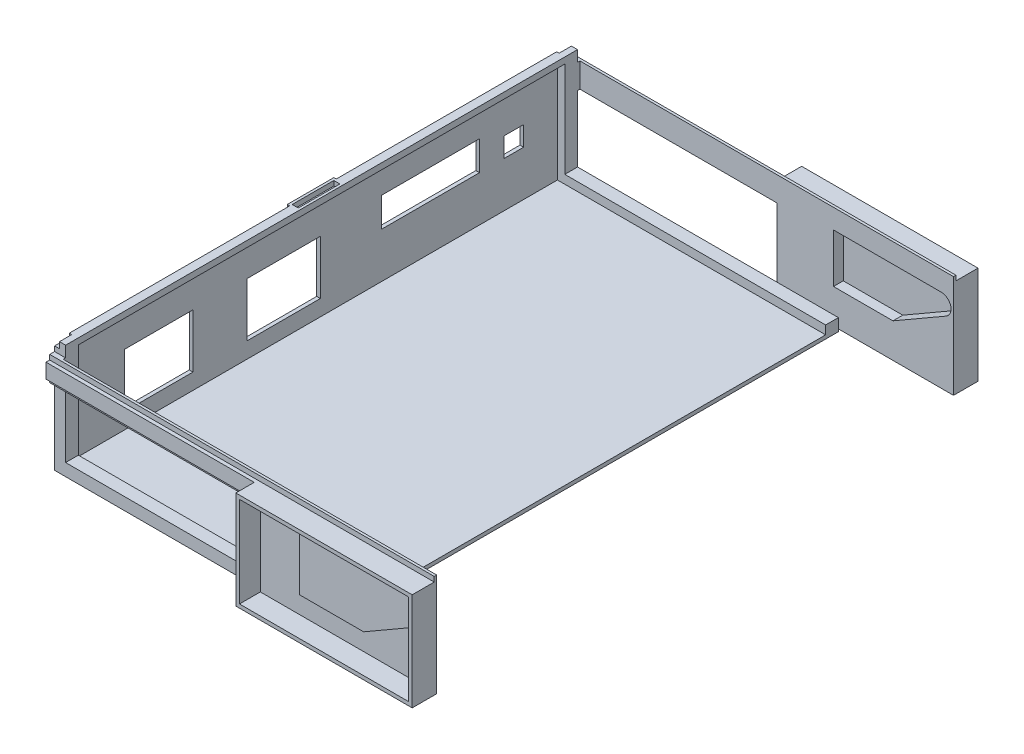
ISO-10303-21;
HEADER;
FILE_DESCRIPTION(('STEP AP214'),'2;1');
FILE_NAME('part.step','',(''),(''),'','','');
FILE_SCHEMA(('AUTOMOTIVE_DESIGN { 1 0 10303 214 1 1 1 1 }'));
ENDSEC;
DATA;
#1=APPLICATION_CONTEXT('core data for automotive mechanical design processes');
#2=APPLICATION_PROTOCOL_DEFINITION('international standard','automotive_design',2000,#1);
#3=PRODUCT_CONTEXT('',#1,'mechanical');
#4=PRODUCT('Part','Part','',(#3));
#5=PRODUCT_RELATED_PRODUCT_CATEGORY('part','',(#4));
#6=PRODUCT_DEFINITION_FORMATION('','',#4);
#7=PRODUCT_DEFINITION_CONTEXT('part definition',#1,'design');
#8=PRODUCT_DEFINITION('design','',#6,#7);
#9=PRODUCT_DEFINITION_SHAPE('','',#8);
#10=(LENGTH_UNIT() NAMED_UNIT(*) SI_UNIT(.MILLI.,.METRE.));
#11=(NAMED_UNIT(*) PLANE_ANGLE_UNIT() SI_UNIT($,.RADIAN.));
#12=(NAMED_UNIT(*) SI_UNIT($,.STERADIAN.) SOLID_ANGLE_UNIT());
#13=UNCERTAINTY_MEASURE_WITH_UNIT(LENGTH_MEASURE(1.E-05),#10,'distance_accuracy_value','');
#14=(GEOMETRIC_REPRESENTATION_CONTEXT(3) GLOBAL_UNCERTAINTY_ASSIGNED_CONTEXT((#13)) GLOBAL_UNIT_ASSIGNED_CONTEXT((#10,
#11,#12)) REPRESENTATION_CONTEXT('',''));
#15=CARTESIAN_POINT('',(0.,0.,0.));
#16=DIRECTION('',(0.,0.,1.));
#17=DIRECTION('',(1.,0.,0.));
#18=AXIS2_PLACEMENT_3D('',#15,#16,#17);
#19=CARTESIAN_POINT('',(114.5,42.,-205.));
#20=DIRECTION('',(0.,0.,1.));
#21=DIRECTION('',(0.,-1.,0.));
#22=AXIS2_PLACEMENT_3D('',#19,#20,#21);
#23=PLANE('',#22);
#24=DIRECTION('',(-1.,0.,0.));
#25=VECTOR('',#24,1.);
#26=CARTESIAN_POINT('',(114.5,32.,-205.));
#27=LINE('',#26,#25);
#28=CARTESIAN_POINT('',(85.,32.,-205.));
#29=VERTEX_POINT('',#28);
#30=CARTESIAN_POINT('',(4.5,32.,-205.));
#31=VERTEX_POINT('',#30);
#32=EDGE_CURVE('E758',#29,#31,#27,.T.);
#33=ORIENTED_EDGE('',*,*,#32,.F.);
#34=DIRECTION('',(0.,1.,0.));
#35=VECTOR('',#34,1.);
#36=CARTESIAN_POINT('',(85.,0.,-205.));
#37=LINE('',#36,#35);
#38=CARTESIAN_POINT('',(85.,0.,-205.));
#39=VERTEX_POINT('',#38);
#40=EDGE_CURVE('E725',#39,#29,#37,.T.);
#41=ORIENTED_EDGE('',*,*,#40,.F.);
#42=DIRECTION('',(-1.,0.,0.));
#43=VECTOR('',#42,1.);
#44=CARTESIAN_POINT('',(85.,0.,-205.));
#45=LINE('',#44,#43);
#46=CARTESIAN_POINT('',(157.,0.,-205.));
#47=VERTEX_POINT('',#46);
#48=EDGE_CURVE('E727',#47,#39,#45,.T.);
#49=ORIENTED_EDGE('',*,*,#48,.F.);
#50=DIRECTION('',(0.,-1.,0.));
#51=VECTOR('',#50,1.);
#52=CARTESIAN_POINT('',(157.,0.,-205.));
#53=LINE('',#52,#51);
#54=CARTESIAN_POINT('',(157.,42.,-205.));
#55=VERTEX_POINT('',#54);
#56=EDGE_CURVE('E729',#55,#47,#53,.T.);
#57=ORIENTED_EDGE('',*,*,#56,.F.);
#58=DIRECTION('',(-1.,0.,0.));
#59=VECTOR('',#58,1.);
#60=CARTESIAN_POINT('',(114.5,42.,-205.));
#61=LINE('',#60,#59);
#62=CARTESIAN_POINT('',(4.5,42.,-205.));
#63=VERTEX_POINT('',#62);
#64=EDGE_CURVE('E760',#55,#63,#61,.T.);
#65=ORIENTED_EDGE('',*,*,#64,.T.);
#66=DIRECTION('',(0.,1.,0.));
#67=VECTOR('',#66,1.);
#68=CARTESIAN_POINT('',(4.5,42.,-205.));
#69=LINE('',#68,#67);
#70=EDGE_CURVE('E755',#31,#63,#69,.T.);
#71=ORIENTED_EDGE('',*,*,#70,.F.);
#72=EDGE_LOOP('',(#33,#41,#49,#57,#65,#71));
#73=FACE_BOUND('',#72,.T.);
#74=DIRECTION('',(1.,0.,0.));
#75=VECTOR('',#74,1.);
#76=CARTESIAN_POINT('',(152.,34.,-205.));
#77=LINE('',#76,#75);
#78=CARTESIAN_POINT('',(108.,34.,-205.));
#79=VERTEX_POINT('',#78);
#80=CARTESIAN_POINT('',(152.,34.,-205.));
#81=VERTEX_POINT('',#80);
#82=EDGE_CURVE('E687',#79,#81,#77,.T.);
#83=ORIENTED_EDGE('',*,*,#82,.T.);
#84=CARTESIAN_POINT('',(152.,30.,-205.));
#85=DIRECTION('',(0.,0.,-1.));
#86=DIRECTION('',(0.,1.,0.));
#87=AXIS2_PLACEMENT_3D('',#84,#85,#86);
#88=CIRCLE('',#87,4.);
#89=CARTESIAN_POINT('',(154.,26.5358983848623,-205.));
#90=VERTEX_POINT('',#89);
#91=EDGE_CURVE('E50',#81,#90,#88,.T.);
#92=ORIENTED_EDGE('',*,*,#91,.T.);
#93=DIRECTION('',(-0.866025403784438,-0.500000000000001,0.));
#94=VECTOR('',#93,1.);
#95=CARTESIAN_POINT('',(132.287187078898,14.,-205.));
#96=LINE('',#95,#94);
#97=CARTESIAN_POINT('',(132.287187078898,14.,-205.));
#98=VERTEX_POINT('',#97);
#99=EDGE_CURVE('E695',#90,#98,#96,.T.);
#100=ORIENTED_EDGE('',*,*,#99,.T.);
#101=DIRECTION('',(-1.,0.,0.));
#102=VECTOR('',#101,1.);
#103=CARTESIAN_POINT('',(108.,14.,-205.));
#104=LINE('',#103,#102);
#105=CARTESIAN_POINT('',(108.,14.,-205.));
#106=VERTEX_POINT('',#105);
#107=EDGE_CURVE('E693',#98,#106,#104,.T.);
#108=ORIENTED_EDGE('',*,*,#107,.T.);
#109=DIRECTION('',(0.,1.,0.));
#110=VECTOR('',#109,1.);
#111=CARTESIAN_POINT('',(108.,34.,-205.));
#112=LINE('',#111,#110);
#113=EDGE_CURVE('E677',#106,#79,#112,.T.);
#114=ORIENTED_EDGE('',*,*,#113,.T.);
#115=EDGE_LOOP('',(#83,#92,#100,#108,#114));
#116=FACE_BOUND('',#115,.T.);
#117=ADVANCED_FACE('F32',(#73,#116),#23,.T.);
#118=CARTESIAN_POINT('',(15.0948100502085,42.,-204.));
#119=DIRECTION('',(0.,-1.,0.));
#120=DIRECTION('',(0.,0.,-1.));
#121=AXIS2_PLACEMENT_3D('',#118,#119,#120);
#122=PLANE('',#121);
#123=DIRECTION('',(0.,0.,1.));
#124=VECTOR('',#123,1.);
#125=CARTESIAN_POINT('',(157.,42.,-215.));
#126=LINE('',#125,#124);
#127=CARTESIAN_POINT('',(157.,42.,-206.));
#128=VERTEX_POINT('',#127);
#129=EDGE_CURVE('E739',#128,#55,#126,.T.);
#130=ORIENTED_EDGE('',*,*,#129,.F.);
#131=DIRECTION('',(-1.,0.,0.));
#132=VECTOR('',#131,1.);
#133=CARTESIAN_POINT('',(15.0948100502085,42.,-206.));
#134=LINE('',#133,#132);
#135=CARTESIAN_POINT('',(0.,42.,-206.));
#136=VERTEX_POINT('',#135);
#137=EDGE_CURVE('E799',#128,#136,#134,.T.);
#138=ORIENTED_EDGE('',*,*,#137,.T.);
#139=DIRECTION('',(0.,0.,1.));
#140=VECTOR('',#139,1.);
#141=CARTESIAN_POINT('',(0.,42.,-204.));
#142=LINE('',#141,#140);
#143=CARTESIAN_POINT('',(0.,42.,-204.));
#144=VERTEX_POINT('',#143);
#145=EDGE_CURVE('E762',#136,#144,#142,.T.);
#146=ORIENTED_EDGE('',*,*,#145,.T.);
#147=DIRECTION('',(-1.,0.,0.));
#148=VECTOR('',#147,1.);
#149=CARTESIAN_POINT('',(15.0948100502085,42.,-204.));
#150=LINE('',#149,#148);
#151=CARTESIAN_POINT('',(4.5,42.,-204.));
#152=VERTEX_POINT('',#151);
#153=EDGE_CURVE('E792',#152,#144,#150,.T.);
#154=ORIENTED_EDGE('',*,*,#153,.F.);
#155=DIRECTION('',(0.,0.,-1.));
#156=VECTOR('',#155,1.);
#157=CARTESIAN_POINT('',(4.5,42.,-204.));
#158=LINE('',#157,#156);
#159=EDGE_CURVE('E786',#152,#63,#158,.T.);
#160=ORIENTED_EDGE('',*,*,#159,.T.);
#161=ORIENTED_EDGE('',*,*,#64,.F.);
#162=EDGE_LOOP('',(#130,#138,#146,#154,#160,#161));
#163=FACE_BOUND('',#162,.T.);
#164=ADVANCED_FACE('F1631',(#163),#122,.F.);
#165=CARTESIAN_POINT('',(85.,0.,-215.));
#166=DIRECTION('',(1.,0.,0.));
#167=DIRECTION('',(0.,0.,-1.));
#168=AXIS2_PLACEMENT_3D('',#165,#166,#167);
#169=PLANE('',#168);
#170=DIRECTION('',(0.,0.,-1.));
#171=VECTOR('',#170,1.);
#172=CARTESIAN_POINT('',(85.,40.,-206.));
#173=LINE('',#172,#171);
#174=CARTESIAN_POINT('',(85.,40.,-207.5));
#175=VERTEX_POINT('',#174);
#176=CARTESIAN_POINT('',(85.,40.,-215.));
#177=VERTEX_POINT('',#176);
#178=EDGE_CURVE('E712',#175,#177,#173,.T.);
#179=ORIENTED_EDGE('',*,*,#178,.T.);
#180=DIRECTION('',(0.,1.,0.));
#181=VECTOR('',#180,1.);
#182=CARTESIAN_POINT('',(85.,0.,-215.));
#183=LINE('',#182,#181);
#184=CARTESIAN_POINT('',(85.,0.,-215.));
#185=VERTEX_POINT('',#184);
#186=EDGE_CURVE('E731',#185,#177,#183,.T.);
#187=ORIENTED_EDGE('',*,*,#186,.F.);
#188=DIRECTION('',(0.,0.,1.));
#189=VECTOR('',#188,1.);
#190=CARTESIAN_POINT('',(85.,0.,-215.));
#191=LINE('',#190,#189);
#192=EDGE_CURVE('E738',#185,#39,#191,.T.);
#193=ORIENTED_EDGE('',*,*,#192,.T.);
#194=ORIENTED_EDGE('',*,*,#40,.T.);
#195=DIRECTION('',(0.,0.,-1.));
#196=VECTOR('',#195,1.);
#197=CARTESIAN_POINT('',(85.,32.,-204.));
#198=LINE('',#197,#196);
#199=CARTESIAN_POINT('',(85.,32.,-206.));
#200=VERTEX_POINT('',#199);
#201=EDGE_CURVE('E741',#29,#200,#198,.T.);
#202=ORIENTED_EDGE('',*,*,#201,.T.);
#203=DIRECTION('',(0.,1.,0.));
#204=VECTOR('',#203,1.);
#205=CARTESIAN_POINT('',(85.,32.,-206.));
#206=LINE('',#205,#204);
#207=CARTESIAN_POINT('',(85.,34.,-206.));
#208=VERTEX_POINT('',#207);
#209=EDGE_CURVE('E748',#200,#208,#206,.T.);
#210=ORIENTED_EDGE('',*,*,#209,.T.);
#211=DIRECTION('',(0.,0.,-1.));
#212=VECTOR('',#211,1.);
#213=CARTESIAN_POINT('',(85.,34.,-206.));
#214=LINE('',#213,#212);
#215=CARTESIAN_POINT('',(85.,34.,-207.5));
#216=VERTEX_POINT('',#215);
#217=EDGE_CURVE('E750',#208,#216,#214,.T.);
#218=ORIENTED_EDGE('',*,*,#217,.T.);
#219=DIRECTION('',(0.,1.,0.));
#220=VECTOR('',#219,1.);
#221=CARTESIAN_POINT('',(85.,34.,-207.5));
#222=LINE('',#221,#220);
#223=EDGE_CURVE('E752',#216,#175,#222,.T.);
#224=ORIENTED_EDGE('',*,*,#223,.T.);
#225=EDGE_LOOP('',(#179,#187,#193,#194,#202,#210,#218,#224));
#226=FACE_BOUND('',#225,.T.);
#227=ADVANCED_FACE('F1637',(#226),#169,.F.);
#228=CARTESIAN_POINT('',(157.,0.,-215.));
#229=DIRECTION('',(-1.,0.,0.));
#230=DIRECTION('',(0.,0.,1.));
#231=AXIS2_PLACEMENT_3D('',#228,#229,#230);
#232=PLANE('',#231);
#233=DIRECTION('',(0.,-1.,0.));
#234=VECTOR('',#233,1.);
#235=CARTESIAN_POINT('',(157.,42.,-206.));
#236=LINE('',#235,#234);
#237=CARTESIAN_POINT('',(157.,40.,-206.));
#238=VERTEX_POINT('',#237);
#239=EDGE_CURVE('E720',#128,#238,#236,.T.);
#240=ORIENTED_EDGE('',*,*,#239,.F.);
#241=ORIENTED_EDGE('',*,*,#129,.T.);
#242=ORIENTED_EDGE('',*,*,#56,.T.);
#243=DIRECTION('',(0.,0.,1.));
#244=VECTOR('',#243,1.);
#245=CARTESIAN_POINT('',(157.,0.,-215.));
#246=LINE('',#245,#244);
#247=CARTESIAN_POINT('',(157.,0.,-215.));
#248=VERTEX_POINT('',#247);
#249=EDGE_CURVE('E742',#248,#47,#246,.T.);
#250=ORIENTED_EDGE('',*,*,#249,.F.);
#251=DIRECTION('',(0.,-1.,0.));
#252=VECTOR('',#251,1.);
#253=CARTESIAN_POINT('',(157.,0.,-215.));
#254=LINE('',#253,#252);
#255=CARTESIAN_POINT('',(157.,40.,-215.));
#256=VERTEX_POINT('',#255);
#257=EDGE_CURVE('E736',#256,#248,#254,.T.);
#258=ORIENTED_EDGE('',*,*,#257,.F.);
#259=DIRECTION('',(0.,0.,-1.));
#260=VECTOR('',#259,1.);
#261=CARTESIAN_POINT('',(157.,40.,-206.));
#262=LINE('',#261,#260);
#263=EDGE_CURVE('E58',#238,#256,#262,.T.);
#264=ORIENTED_EDGE('',*,*,#263,.F.);
#265=EDGE_LOOP('',(#240,#241,#242,#250,#258,#264));
#266=FACE_BOUND('',#265,.T.);
#267=ADVANCED_FACE('F2354',(#266),#232,.F.);
#268=CARTESIAN_POINT('',(85.,42.,-215.));
#269=DIRECTION('',(0.,0.,1.));
#270=DIRECTION('',(0.,1.,0.));
#271=AXIS2_PLACEMENT_3D('',#268,#269,#270);
#272=PLANE('',#271);
#273=DIRECTION('',(-1.,0.,0.));
#274=VECTOR('',#273,1.);
#275=CARTESIAN_POINT('',(157.,40.,-215.));
#276=LINE('',#275,#274);
#277=EDGE_CURVE('E723',#256,#177,#276,.T.);
#278=ORIENTED_EDGE('',*,*,#277,.F.);
#279=ORIENTED_EDGE('',*,*,#257,.T.);
#280=DIRECTION('',(-1.,0.,0.));
#281=VECTOR('',#280,1.);
#282=CARTESIAN_POINT('',(85.,0.,-215.));
#283=LINE('',#282,#281);
#284=EDGE_CURVE('E734',#248,#185,#283,.T.);
#285=ORIENTED_EDGE('',*,*,#284,.T.);
#286=ORIENTED_EDGE('',*,*,#186,.T.);
#287=EDGE_LOOP('',(#278,#279,#285,#286));
#288=FACE_BOUND('',#287,.T.);
#289=ADVANCED_FACE('F1665',(#288),#272,.F.);
#290=CARTESIAN_POINT('',(15.0948100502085,42.,-206.));
#291=DIRECTION('',(0.,0.,1.));
#292=DIRECTION('',(1.,0.,0.));
#293=AXIS2_PLACEMENT_3D('',#290,#291,#292);
#294=PLANE('',#293);
#295=ORIENTED_EDGE('',*,*,#137,.F.);
#296=ORIENTED_EDGE('',*,*,#239,.T.);
#297=DIRECTION('',(-1.,0.,0.));
#298=VECTOR('',#297,1.);
#299=CARTESIAN_POINT('',(15.0948100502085,40.,-206.));
#300=LINE('',#299,#298);
#301=CARTESIAN_POINT('',(0.,40.,-206.));
#302=VERTEX_POINT('',#301);
#303=EDGE_CURVE('E806',#238,#302,#300,.T.);
#304=ORIENTED_EDGE('',*,*,#303,.T.);
#305=DIRECTION('',(0.,1.,0.));
#306=VECTOR('',#305,1.);
#307=CARTESIAN_POINT('',(0.,42.,-206.));
#308=LINE('',#307,#306);
#309=EDGE_CURVE('E763',#302,#136,#308,.T.);
#310=ORIENTED_EDGE('',*,*,#309,.T.);
#311=EDGE_LOOP('',(#295,#296,#304,#310));
#312=FACE_BOUND('',#311,.T.);
#313=ADVANCED_FACE('F1663',(#312),#294,.F.);
#314=CARTESIAN_POINT('',(15.0948100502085,40.,-206.));
#315=DIRECTION('',(0.,-1.,0.));
#316=DIRECTION('',(0.,0.,-1.));
#317=AXIS2_PLACEMENT_3D('',#314,#315,#316);
#318=PLANE('',#317);
#319=ORIENTED_EDGE('',*,*,#303,.F.);
#320=ORIENTED_EDGE('',*,*,#263,.T.);
#321=ORIENTED_EDGE('',*,*,#277,.T.);
#322=ORIENTED_EDGE('',*,*,#178,.F.);
#323=DIRECTION('',(-1.,0.,0.));
#324=VECTOR('',#323,1.);
#325=CARTESIAN_POINT('',(15.0948100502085,40.,-207.5));
#326=LINE('',#325,#324);
#327=CARTESIAN_POINT('',(0.,40.,-207.5));
#328=VERTEX_POINT('',#327);
#329=EDGE_CURVE('E2664',#175,#328,#326,.T.);
#330=ORIENTED_EDGE('',*,*,#329,.T.);
#331=DIRECTION('',(0.,0.,1.));
#332=VECTOR('',#331,1.);
#333=CARTESIAN_POINT('',(0.,40.,-206.));
#334=LINE('',#333,#332);
#335=EDGE_CURVE('E766',#328,#302,#334,.T.);
#336=ORIENTED_EDGE('',*,*,#335,.T.);
#337=EDGE_LOOP('',(#319,#320,#321,#322,#330,#336));
#338=FACE_BOUND('',#337,.T.);
#339=ADVANCED_FACE('F1659',(#338),#318,.F.);
#340=CARTESIAN_POINT('',(15.0948100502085,34.,-207.5));
#341=DIRECTION('',(0.,0.,1.));
#342=DIRECTION('',(1.,0.,0.));
#343=AXIS2_PLACEMENT_3D('',#340,#341,#342);
#344=PLANE('',#343);
#345=ORIENTED_EDGE('',*,*,#223,.F.);
#346=DIRECTION('',(-1.,0.,0.));
#347=VECTOR('',#346,1.);
#348=CARTESIAN_POINT('',(15.0948100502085,34.,-207.5));
#349=LINE('',#348,#347);
#350=CARTESIAN_POINT('',(0.,34.,-207.5));
#351=VERTEX_POINT('',#350);
#352=EDGE_CURVE('E2663',#216,#351,#349,.T.);
#353=ORIENTED_EDGE('',*,*,#352,.T.);
#354=DIRECTION('',(0.,1.,0.));
#355=VECTOR('',#354,1.);
#356=CARTESIAN_POINT('',(0.,34.,-207.5));
#357=LINE('',#356,#355);
#358=EDGE_CURVE('E769',#351,#328,#357,.T.);
#359=ORIENTED_EDGE('',*,*,#358,.T.);
#360=ORIENTED_EDGE('',*,*,#329,.F.);
#361=EDGE_LOOP('',(#345,#353,#359,#360));
#362=FACE_BOUND('',#361,.T.);
#363=ADVANCED_FACE('F1655',(#362),#344,.F.);
#364=CARTESIAN_POINT('',(15.0948100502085,34.,-206.));
#365=DIRECTION('',(0.,1.,0.));
#366=DIRECTION('',(0.,0.,1.));
#367=AXIS2_PLACEMENT_3D('',#364,#365,#366);
#368=PLANE('',#367);
#369=ORIENTED_EDGE('',*,*,#217,.F.);
#370=DIRECTION('',(-1.,0.,0.));
#371=VECTOR('',#370,1.);
#372=CARTESIAN_POINT('',(15.0948100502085,34.,-206.));
#373=LINE('',#372,#371);
#374=CARTESIAN_POINT('',(0.,34.,-206.));
#375=VERTEX_POINT('',#374);
#376=EDGE_CURVE('E2661',#208,#375,#373,.T.);
#377=ORIENTED_EDGE('',*,*,#376,.T.);
#378=DIRECTION('',(0.,0.,-1.));
#379=VECTOR('',#378,1.);
#380=CARTESIAN_POINT('',(0.,34.,-206.));
#381=LINE('',#380,#379);
#382=EDGE_CURVE('E772',#375,#351,#381,.T.);
#383=ORIENTED_EDGE('',*,*,#382,.T.);
#384=ORIENTED_EDGE('',*,*,#352,.F.);
#385=EDGE_LOOP('',(#369,#377,#383,#384));
#386=FACE_BOUND('',#385,.T.);
#387=ADVANCED_FACE('F1651',(#386),#368,.F.);
#388=CARTESIAN_POINT('',(15.0948100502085,32.,-206.));
#389=DIRECTION('',(0.,0.,1.));
#390=DIRECTION('',(1.,0.,0.));
#391=AXIS2_PLACEMENT_3D('',#388,#389,#390);
#392=PLANE('',#391);
#393=ORIENTED_EDGE('',*,*,#209,.F.);
#394=DIRECTION('',(-1.,0.,0.));
#395=VECTOR('',#394,1.);
#396=CARTESIAN_POINT('',(15.0948100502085,32.,-206.));
#397=LINE('',#396,#395);
#398=CARTESIAN_POINT('',(0.,32.,-206.));
#399=VERTEX_POINT('',#398);
#400=EDGE_CURVE('E781',#200,#399,#397,.T.);
#401=ORIENTED_EDGE('',*,*,#400,.T.);
#402=DIRECTION('',(0.,1.,0.));
#403=VECTOR('',#402,1.);
#404=CARTESIAN_POINT('',(0.,32.,-206.));
#405=LINE('',#404,#403);
#406=EDGE_CURVE('E775',#399,#375,#405,.T.);
#407=ORIENTED_EDGE('',*,*,#406,.T.);
#408=ORIENTED_EDGE('',*,*,#376,.F.);
#409=EDGE_LOOP('',(#393,#401,#407,#408));
#410=FACE_BOUND('',#409,.T.);
#411=ADVANCED_FACE('F1648',(#410),#392,.F.);
#412=CARTESIAN_POINT('',(15.0948100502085,32.,-204.));
#413=DIRECTION('',(0.,1.,0.));
#414=DIRECTION('',(0.,0.,1.));
#415=AXIS2_PLACEMENT_3D('',#412,#413,#414);
#416=PLANE('',#415);
#417=ORIENTED_EDGE('',*,*,#201,.F.);
#418=ORIENTED_EDGE('',*,*,#32,.T.);
#419=DIRECTION('',(0.,0.,1.));
#420=VECTOR('',#419,1.);
#421=CARTESIAN_POINT('',(4.5,32.,-204.));
#422=LINE('',#421,#420);
#423=CARTESIAN_POINT('',(4.5,32.,-204.));
#424=VERTEX_POINT('',#423);
#425=EDGE_CURVE('E36',#31,#424,#422,.T.);
#426=ORIENTED_EDGE('',*,*,#425,.T.);
#427=DIRECTION('',(-1.,0.,0.));
#428=VECTOR('',#427,1.);
#429=CARTESIAN_POINT('',(15.0948100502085,32.,-204.));
#430=LINE('',#429,#428);
#431=CARTESIAN_POINT('',(0.,32.,-204.));
#432=VERTEX_POINT('',#431);
#433=EDGE_CURVE('E784',#424,#432,#430,.T.);
#434=ORIENTED_EDGE('',*,*,#433,.T.);
#435=DIRECTION('',(0.,0.,-1.));
#436=VECTOR('',#435,1.);
#437=CARTESIAN_POINT('',(0.,32.,-204.));
#438=LINE('',#437,#436);
#439=EDGE_CURVE('E778',#432,#399,#438,.T.);
#440=ORIENTED_EDGE('',*,*,#439,.T.);
#441=ORIENTED_EDGE('',*,*,#400,.F.);
#442=EDGE_LOOP('',(#417,#418,#426,#434,#440,#441));
#443=FACE_BOUND('',#442,.T.);
#444=ADVANCED_FACE('F1644',(#443),#416,.F.);
#445=CARTESIAN_POINT('',(0.,44.,-204.));
#446=DIRECTION('',(0.,0.,1.));
#447=DIRECTION('',(-1.,0.,0.));
#448=AXIS2_PLACEMENT_3D('',#445,#446,#447);
#449=PLANE('',#448);
#450=ORIENTED_EDGE('',*,*,#433,.F.);
#451=DIRECTION('',(0.,1.,0.));
#452=VECTOR('',#451,1.);
#453=CARTESIAN_POINT('',(4.5,46.5,-204.));
#454=LINE('',#453,#452);
#455=CARTESIAN_POINT('',(4.5,4.99999999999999,-204.));
#456=VERTEX_POINT('',#455);
#457=EDGE_CURVE('E2675',#456,#424,#454,.T.);
#458=ORIENTED_EDGE('',*,*,#457,.F.);
#459=DIRECTION('',(-1.,0.,0.));
#460=VECTOR('',#459,1.);
#461=CARTESIAN_POINT('',(111.,5.,-204.));
#462=LINE('',#461,#460);
#463=CARTESIAN_POINT('',(111.,5.,-204.));
#464=VERTEX_POINT('',#463);
#465=EDGE_CURVE('E1153',#464,#456,#462,.T.);
#466=ORIENTED_EDGE('',*,*,#465,.F.);
#467=DIRECTION('',(0.,1.,0.));
#468=VECTOR('',#467,1.);
#469=CARTESIAN_POINT('',(111.,0.,-204.));
#470=LINE('',#469,#468);
#471=CARTESIAN_POINT('',(111.,0.,-204.));
#472=VERTEX_POINT('',#471);
#473=EDGE_CURVE('E2682',#472,#464,#470,.T.);
#474=ORIENTED_EDGE('',*,*,#473,.F.);
#475=DIRECTION('',(1.,0.,0.));
#476=VECTOR('',#475,1.);
#477=CARTESIAN_POINT('',(0.,0.,-204.));
#478=LINE('',#477,#476);
#479=CARTESIAN_POINT('',(0.,0.,-204.));
#480=VERTEX_POINT('',#479);
#481=EDGE_CURVE('E1161',#480,#472,#478,.T.);
#482=ORIENTED_EDGE('',*,*,#481,.F.);
#483=DIRECTION('',(0.,-1.,0.));
#484=VECTOR('',#483,1.);
#485=CARTESIAN_POINT('',(0.,0.,-204.));
#486=LINE('',#485,#484);
#487=EDGE_CURVE('E823',#432,#480,#486,.T.);
#488=ORIENTED_EDGE('',*,*,#487,.F.);
#489=EDGE_LOOP('',(#450,#458,#466,#474,#482,#488));
#490=FACE_BOUND('',#489,.T.);
#491=ADVANCED_FACE('F1647',(#490),#449,.F.);
#492=CARTESIAN_POINT('',(4.5,46.5,-199.));
#493=DIRECTION('',(-1.,0.,0.));
#494=DIRECTION('',(0.,0.,1.));
#495=AXIS2_PLACEMENT_3D('',#492,#493,#494);
#496=PLANE('',#495);
#497=ORIENTED_EDGE('',*,*,#425,.F.);
#498=ORIENTED_EDGE('',*,*,#70,.T.);
#499=ORIENTED_EDGE('',*,*,#159,.F.);
#500=CARTESIAN_POINT('',(4.5,46.5,-204.));
#501=VERTEX_POINT('',#500);
#502=EDGE_CURVE('E953',#152,#501,#454,.T.);
#503=ORIENTED_EDGE('',*,*,#502,.T.);
#504=DIRECTION('',(0.,0.,-1.));
#505=VECTOR('',#504,1.);
#506=CARTESIAN_POINT('',(4.5,46.5,-199.));
#507=LINE('',#506,#505);
#508=CARTESIAN_POINT('',(4.5,46.5,5.));
#509=VERTEX_POINT('',#508);
#510=EDGE_CURVE('E950',#509,#501,#507,.T.);
#511=ORIENTED_EDGE('',*,*,#510,.F.);
#512=DIRECTION('',(0.,1.,0.));
#513=VECTOR('',#512,1.);
#514=CARTESIAN_POINT('',(4.5,46.5,5.));
#515=LINE('',#514,#513);
#516=CARTESIAN_POINT('',(4.5,42.,5.));
#517=VERTEX_POINT('',#516);
#518=EDGE_CURVE('E924',#517,#509,#515,.T.);
#519=ORIENTED_EDGE('',*,*,#518,.F.);
#520=DIRECTION('',(0.,0.,1.));
#521=VECTOR('',#520,1.);
#522=CARTESIAN_POINT('',(4.5,42.,5.));
#523=LINE('',#522,#521);
#524=CARTESIAN_POINT('',(4.5,42.,6.));
#525=VERTEX_POINT('',#524);
#526=EDGE_CURVE('E1478',#517,#525,#523,.T.);
#527=ORIENTED_EDGE('',*,*,#526,.T.);
#528=DIRECTION('',(0.,1.,0.));
#529=VECTOR('',#528,1.);
#530=CARTESIAN_POINT('',(4.5,42.,6.));
#531=LINE('',#530,#529);
#532=CARTESIAN_POINT('',(4.5,32.,6.));
#533=VERTEX_POINT('',#532);
#534=EDGE_CURVE('E1449',#533,#525,#531,.T.);
#535=ORIENTED_EDGE('',*,*,#534,.F.);
#536=DIRECTION('',(0.,0.,-1.));
#537=VECTOR('',#536,1.);
#538=CARTESIAN_POINT('',(4.5,32.,5.));
#539=LINE('',#538,#537);
#540=CARTESIAN_POINT('',(4.5,32.,5.));
#541=VERTEX_POINT('',#540);
#542=EDGE_CURVE('E1485',#533,#541,#539,.T.);
#543=ORIENTED_EDGE('',*,*,#542,.T.);
#544=CARTESIAN_POINT('',(4.5,4.99999999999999,5.));
#545=VERTEX_POINT('',#544);
#546=EDGE_CURVE('E932',#545,#541,#515,.T.);
#547=ORIENTED_EDGE('',*,*,#546,.F.);
#548=DIRECTION('',(0.,0.,-1.));
#549=VECTOR('',#548,1.);
#550=CARTESIAN_POINT('',(4.5,4.99999999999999,5.));
#551=LINE('',#550,#549);
#552=CARTESIAN_POINT('',(4.5,4.99999999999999,-0.2));
#553=VERTEX_POINT('',#552);
#554=EDGE_CURVE('E969',#545,#553,#551,.T.);
#555=ORIENTED_EDGE('',*,*,#554,.T.);
#556=DIRECTION('',(0.,1.,0.));
#557=VECTOR('',#556,1.);
#558=CARTESIAN_POINT('',(4.5,46.5,-0.2));
#559=LINE('',#558,#557);
#560=CARTESIAN_POINT('',(4.5,44.,-0.2));
#561=VERTEX_POINT('',#560);
#562=EDGE_CURVE('E1135',#553,#561,#559,.T.);
#563=ORIENTED_EDGE('',*,*,#562,.T.);
#564=DIRECTION('',(0.,0.,-1.));
#565=VECTOR('',#564,1.);
#566=CARTESIAN_POINT('',(4.5,44.,-199.));
#567=LINE('',#566,#565);
#568=CARTESIAN_POINT('',(4.5,44.,-198.8));
#569=VERTEX_POINT('',#568);
#570=EDGE_CURVE('E838',#561,#569,#567,.T.);
#571=ORIENTED_EDGE('',*,*,#570,.T.);
#572=DIRECTION('',(0.,1.,0.));
#573=VECTOR('',#572,1.);
#574=CARTESIAN_POINT('',(4.5,46.5,-198.8));
#575=LINE('',#574,#573);
#576=CARTESIAN_POINT('',(4.5,4.99999999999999,-198.8));
#577=VERTEX_POINT('',#576);
#578=EDGE_CURVE('E815',#577,#569,#575,.T.);
#579=ORIENTED_EDGE('',*,*,#578,.F.);
#580=DIRECTION('',(0.,0.,1.));
#581=VECTOR('',#580,1.);
#582=CARTESIAN_POINT('',(4.5,4.99999999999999,-204.));
#583=LINE('',#582,#581);
#584=EDGE_CURVE('E1152',#456,#577,#583,.T.);
#585=ORIENTED_EDGE('',*,*,#584,.F.);
#586=ORIENTED_EDGE('',*,*,#457,.T.);
#587=EDGE_LOOP('',(#497,#498,#499,#503,#511,#519,#527,#535,#543,#547,#555,#563,#571,#579,#585,#586));
#588=FACE_BOUND('',#587,.T.);
#589=ADVANCED_FACE('F952',(#588),#496,.F.);
#590=CARTESIAN_POINT('',(0.,44.,5.));
#591=DIRECTION('',(0.,0.,-1.));
#592=DIRECTION('',(-1.,0.,0.));
#593=AXIS2_PLACEMENT_3D('',#590,#591,#592);
#594=PLANE('',#593);
#595=DIRECTION('',(-1.,0.,0.));
#596=VECTOR('',#595,1.);
#597=CARTESIAN_POINT('',(15.0948100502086,42.,5.));
#598=LINE('',#597,#596);
#599=CARTESIAN_POINT('',(0.,42.,5.));
#600=VERTEX_POINT('',#599);
#601=EDGE_CURVE('E945',#517,#600,#598,.T.);
#602=ORIENTED_EDGE('',*,*,#601,.F.);
#603=ORIENTED_EDGE('',*,*,#518,.T.);
#604=DIRECTION('',(-1.,0.,0.));
#605=VECTOR('',#604,1.);
#606=CARTESIAN_POINT('',(2.,46.5,5.));
#607=LINE('',#606,#605);
#608=CARTESIAN_POINT('',(2.,46.5,5.));
#609=VERTEX_POINT('',#608);
#610=EDGE_CURVE('E927',#509,#609,#607,.T.);
#611=ORIENTED_EDGE('',*,*,#610,.T.);
#612=DIRECTION('',(0.,-1.,0.));
#613=VECTOR('',#612,1.);
#614=CARTESIAN_POINT('',(2.,44.,5.));
#615=LINE('',#614,#613);
#616=CARTESIAN_POINT('',(2.,44.,5.));
#617=VERTEX_POINT('',#616);
#618=EDGE_CURVE('E937',#609,#617,#615,.T.);
#619=ORIENTED_EDGE('',*,*,#618,.T.);
#620=DIRECTION('',(-1.,0.,0.));
#621=VECTOR('',#620,1.);
#622=CARTESIAN_POINT('',(0.,44.,5.));
#623=LINE('',#622,#621);
#624=CARTESIAN_POINT('',(0.,44.,5.));
#625=VERTEX_POINT('',#624);
#626=EDGE_CURVE('E977',#617,#625,#623,.T.);
#627=ORIENTED_EDGE('',*,*,#626,.T.);
#628=DIRECTION('',(0.,-1.,0.));
#629=VECTOR('',#628,1.);
#630=CARTESIAN_POINT('',(0.,0.,5.));
#631=LINE('',#630,#629);
#632=EDGE_CURVE('E906',#625,#600,#631,.T.);
#633=ORIENTED_EDGE('',*,*,#632,.T.);
#634=EDGE_LOOP('',(#602,#603,#611,#619,#627,#633));
#635=FACE_BOUND('',#634,.T.);
#636=ADVANCED_FACE('F941',(#635),#594,.F.);
#637=CARTESIAN_POINT('',(111.,0.,0.));
#638=DIRECTION('',(0.,0.,-1.));
#639=DIRECTION('',(-1.,0.,0.));
#640=AXIS2_PLACEMENT_3D('',#637,#638,#639);
#641=PLANE('',#640);
#642=DIRECTION('',(0.,-1.,0.));
#643=VECTOR('',#642,1.);
#644=CARTESIAN_POINT('',(2.,0.,0.));
#645=LINE('',#644,#643);
#646=CARTESIAN_POINT('',(2.,46.5,0.));
#647=VERTEX_POINT('',#646);
#648=CARTESIAN_POINT('',(2.,44.,0.));
#649=VERTEX_POINT('',#648);
#650=EDGE_CURVE('E991',#647,#649,#645,.T.);
#651=ORIENTED_EDGE('',*,*,#650,.F.);
#652=DIRECTION('',(1.,0.,0.));
#653=VECTOR('',#652,1.);
#654=CARTESIAN_POINT('',(4.5,46.5,0.));
#655=LINE('',#654,#653);
#656=CARTESIAN_POINT('',(1.,46.5,0.));
#657=VERTEX_POINT('',#656);
#658=EDGE_CURVE('E966',#657,#647,#655,.T.);
#659=ORIENTED_EDGE('',*,*,#658,.F.);
#660=DIRECTION('',(0.,-1.,0.));
#661=VECTOR('',#660,1.);
#662=CARTESIAN_POINT('',(1.,46.5,0.));
#663=LINE('',#662,#661);
#664=CARTESIAN_POINT('',(1.,44.,0.));
#665=VERTEX_POINT('',#664);
#666=EDGE_CURVE('E1588',#657,#665,#663,.T.);
#667=ORIENTED_EDGE('',*,*,#666,.T.);
#668=DIRECTION('',(1.,0.,0.));
#669=VECTOR('',#668,1.);
#670=CARTESIAN_POINT('',(4.5,44.,0.));
#671=LINE('',#670,#669);
#672=EDGE_CURVE('E958',#665,#649,#671,.T.);
#673=ORIENTED_EDGE('',*,*,#672,.T.);
#674=EDGE_LOOP('',(#651,#659,#667,#673));
#675=FACE_BOUND('',#674,.T.);
#676=ADVANCED_FACE('F1609',(#675),#641,.F.);
#677=CARTESIAN_POINT('',(0.,44.,-199.));
#678=DIRECTION('',(0.,-1.,0.));
#679=DIRECTION('',(0.,0.,-1.));
#680=AXIS2_PLACEMENT_3D('',#677,#678,#679);
#681=PLANE('',#680);
#682=DIRECTION('',(-1.,0.,0.));
#683=VECTOR('',#682,1.);
#684=CARTESIAN_POINT('',(1.,44.,-109.));
#685=LINE('',#684,#683);
#686=CARTESIAN_POINT('',(1.,44.,-109.));
#687=VERTEX_POINT('',#686);
#688=CARTESIAN_POINT('',(0.,44.,-109.));
#689=VERTEX_POINT('',#688);
#690=EDGE_CURVE('E1108',#687,#689,#685,.T.);
#691=ORIENTED_EDGE('',*,*,#690,.F.);
#692=DIRECTION('',(0.,0.,1.));
#693=VECTOR('',#692,1.);
#694=CARTESIAN_POINT('',(1.,44.,-199.));
#695=LINE('',#694,#693);
#696=CARTESIAN_POINT('',(1.,44.,-199.));
#697=VERTEX_POINT('',#696);
#698=EDGE_CURVE('E852',#697,#687,#695,.T.);
#699=ORIENTED_EDGE('',*,*,#698,.F.);
#700=DIRECTION('',(-1.,0.,0.));
#701=VECTOR('',#700,1.);
#702=CARTESIAN_POINT('',(4.5,44.,-199.));
#703=LINE('',#702,#701);
#704=CARTESIAN_POINT('',(2.,44.,-199.));
#705=VERTEX_POINT('',#704);
#706=EDGE_CURVE('E834',#705,#697,#703,.T.);
#707=ORIENTED_EDGE('',*,*,#706,.F.);
#708=DIRECTION('',(0.,0.,1.));
#709=VECTOR('',#708,1.);
#710=CARTESIAN_POINT('',(2.,44.,-204.));
#711=LINE('',#710,#709);
#712=CARTESIAN_POINT('',(2.,44.,-204.));
#713=VERTEX_POINT('',#712);
#714=EDGE_CURVE('E1159',#713,#705,#711,.T.);
#715=ORIENTED_EDGE('',*,*,#714,.F.);
#716=DIRECTION('',(-1.,0.,0.));
#717=VECTOR('',#716,1.);
#718=CARTESIAN_POINT('',(0.,44.,-204.));
#719=LINE('',#718,#717);
#720=CARTESIAN_POINT('',(0.,44.,-204.));
#721=VERTEX_POINT('',#720);
#722=EDGE_CURVE('E826',#713,#721,#719,.T.);
#723=ORIENTED_EDGE('',*,*,#722,.T.);
#724=DIRECTION('',(0.,0.,1.));
#725=VECTOR('',#724,1.);
#726=CARTESIAN_POINT('',(0.,44.,-199.));
#727=LINE('',#726,#725);
#728=EDGE_CURVE('E1591',#721,#689,#727,.T.);
#729=ORIENTED_EDGE('',*,*,#728,.T.);
#730=EDGE_LOOP('',(#691,#699,#707,#715,#723,#729));
#731=FACE_BOUND('',#730,.T.);
#732=ADVANCED_FACE('F1950',(#731),#681,.F.);
#733=CARTESIAN_POINT('',(1.,46.5,-199.));
#734=DIRECTION('',(1.,0.,0.));
#735=DIRECTION('',(0.,0.,-1.));
#736=AXIS2_PLACEMENT_3D('',#733,#734,#735);
#737=PLANE('',#736);
#738=ORIENTED_EDGE('',*,*,#698,.T.);
#739=DIRECTION('',(0.,1.,0.));
#740=VECTOR('',#739,1.);
#741=CARTESIAN_POINT('',(1.,24.9737024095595,-109.));
#742=LINE('',#741,#740);
#743=CARTESIAN_POINT('',(1.,46.5,-109.));
#744=VERTEX_POINT('',#743);
#745=EDGE_CURVE('E1123',#687,#744,#742,.T.);
#746=ORIENTED_EDGE('',*,*,#745,.T.);
#747=DIRECTION('',(0.,0.,1.));
#748=VECTOR('',#747,1.);
#749=CARTESIAN_POINT('',(1.,46.5,-199.));
#750=LINE('',#749,#748);
#751=CARTESIAN_POINT('',(1.,46.5,-199.));
#752=VERTEX_POINT('',#751);
#753=EDGE_CURVE('E1596',#752,#744,#750,.T.);
#754=ORIENTED_EDGE('',*,*,#753,.F.);
#755=DIRECTION('',(0.,-1.,0.));
#756=VECTOR('',#755,1.);
#757=CARTESIAN_POINT('',(1.,46.5,-199.));
#758=LINE('',#757,#756);
#759=EDGE_CURVE('E1585',#752,#697,#758,.T.);
#760=ORIENTED_EDGE('',*,*,#759,.T.);
#761=EDGE_LOOP('',(#738,#746,#754,#760));
#762=FACE_BOUND('',#761,.T.);
#763=ADVANCED_FACE('F1943',(#762),#737,.F.);
#764=CARTESIAN_POINT('',(0.,44.,-90.));
#765=VERTEX_POINT('',#764);
#766=EDGE_CURVE('E1574',#765,#625,#727,.T.);
#767=ORIENTED_EDGE('',*,*,#766,.T.);
#768=ORIENTED_EDGE('',*,*,#626,.F.);
#769=DIRECTION('',(0.,0.,-1.));
#770=VECTOR('',#769,1.);
#771=CARTESIAN_POINT('',(2.,44.,5.));
#772=LINE('',#771,#770);
#773=EDGE_CURVE('E970',#617,#649,#772,.T.);
#774=ORIENTED_EDGE('',*,*,#773,.T.);
#775=ORIENTED_EDGE('',*,*,#672,.F.);
#776=CARTESIAN_POINT('',(1.,44.,-90.));
#777=VERTEX_POINT('',#776);
#778=EDGE_CURVE('E837',#777,#665,#695,.T.);
#779=ORIENTED_EDGE('',*,*,#778,.F.);
#780=DIRECTION('',(1.,0.,0.));
#781=VECTOR('',#780,1.);
#782=CARTESIAN_POINT('',(1.,44.,-90.));
#783=LINE('',#782,#781);
#784=EDGE_CURVE('E1117',#765,#777,#783,.T.);
#785=ORIENTED_EDGE('',*,*,#784,.F.);
#786=EDGE_LOOP('',(#767,#768,#774,#775,#779,#785));
#787=FACE_BOUND('',#786,.T.);
#788=ADVANCED_FACE('F1611',(#787),#681,.F.);
#789=CARTESIAN_POINT('',(0.,0.,-199.));
#790=DIRECTION('',(0.,-1.,0.));
#791=DIRECTION('',(0.,0.,-1.));
#792=AXIS2_PLACEMENT_3D('',#789,#790,#791);
#793=PLANE('',#792);
#794=DIRECTION('',(1.,0.,0.));
#795=VECTOR('',#794,1.);
#796=CARTESIAN_POINT('',(0.,0.,5.));
#797=LINE('',#796,#795);
#798=CARTESIAN_POINT('',(0.,0.,5.));
#799=VERTEX_POINT('',#798);
#800=CARTESIAN_POINT('',(111.,0.,5.));
#801=VERTEX_POINT('',#800);
#802=EDGE_CURVE('E909',#799,#801,#797,.T.);
#803=ORIENTED_EDGE('',*,*,#802,.F.);
#804=DIRECTION('',(0.,0.,1.));
#805=VECTOR('',#804,1.);
#806=CARTESIAN_POINT('',(0.,0.,-199.));
#807=LINE('',#806,#805);
#808=EDGE_CURVE('E865',#480,#799,#807,.T.);
#809=ORIENTED_EDGE('',*,*,#808,.F.);
#810=ORIENTED_EDGE('',*,*,#481,.T.);
#811=DIRECTION('',(0.,0.,1.));
#812=VECTOR('',#811,1.);
#813=CARTESIAN_POINT('',(111.,0.,-199.));
#814=LINE('',#813,#812);
#815=EDGE_CURVE('E1582',#472,#801,#814,.T.);
#816=ORIENTED_EDGE('',*,*,#815,.T.);
#817=EDGE_LOOP('',(#803,#809,#810,#816));
#818=FACE_BOUND('',#817,.T.);
#819=ADVANCED_FACE('F34',(#818),#793,.T.);
#820=CARTESIAN_POINT('',(0.,0.,-199.));
#821=DIRECTION('',(-1.,0.,0.));
#822=DIRECTION('',(0.,0.,1.));
#823=AXIS2_PLACEMENT_3D('',#820,#821,#822);
#824=PLANE('',#823);
#825=DIRECTION('',(0.,1.,0.));
#826=VECTOR('',#825,1.);
#827=CARTESIAN_POINT('',(0.,24.9737024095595,-109.));
#828=LINE('',#827,#826);
#829=CARTESIAN_POINT('',(0.,46.5,-109.));
#830=VERTEX_POINT('',#829);
#831=EDGE_CURVE('E1116',#689,#830,#828,.T.);
#832=ORIENTED_EDGE('',*,*,#831,.F.);
#833=ORIENTED_EDGE('',*,*,#728,.F.);
#834=EDGE_CURVE('E832',#721,#144,#486,.T.);
#835=ORIENTED_EDGE('',*,*,#834,.T.);
#836=ORIENTED_EDGE('',*,*,#145,.F.);
#837=ORIENTED_EDGE('',*,*,#309,.F.);
#838=ORIENTED_EDGE('',*,*,#335,.F.);
#839=ORIENTED_EDGE('',*,*,#358,.F.);
#840=ORIENTED_EDGE('',*,*,#382,.F.);
#841=ORIENTED_EDGE('',*,*,#406,.F.);
#842=ORIENTED_EDGE('',*,*,#439,.F.);
#843=ORIENTED_EDGE('',*,*,#487,.T.);
#844=ORIENTED_EDGE('',*,*,#808,.T.);
#845=CARTESIAN_POINT('',(0.,32.,5.));
#846=VERTEX_POINT('',#845);
#847=EDGE_CURVE('E910',#846,#799,#631,.T.);
#848=ORIENTED_EDGE('',*,*,#847,.F.);
#849=DIRECTION('',(0.,0.,1.));
#850=VECTOR('',#849,1.);
#851=CARTESIAN_POINT('',(0.,32.,5.));
#852=LINE('',#851,#850);
#853=CARTESIAN_POINT('',(0.,32.,7.));
#854=VERTEX_POINT('',#853);
#855=EDGE_CURVE('E1456',#846,#854,#852,.T.);
#856=ORIENTED_EDGE('',*,*,#855,.T.);
#857=DIRECTION('',(0.,1.,0.));
#858=VECTOR('',#857,1.);
#859=CARTESIAN_POINT('',(0.,32.,7.));
#860=LINE('',#859,#858);
#861=CARTESIAN_POINT('',(0.,34.,7.));
#862=VERTEX_POINT('',#861);
#863=EDGE_CURVE('E1457',#854,#862,#860,.T.);
#864=ORIENTED_EDGE('',*,*,#863,.T.);
#865=DIRECTION('',(0.,0.,1.));
#866=VECTOR('',#865,1.);
#867=CARTESIAN_POINT('',(0.,34.,7.));
#868=LINE('',#867,#866);
#869=CARTESIAN_POINT('',(0.,34.,8.5));
#870=VERTEX_POINT('',#869);
#871=EDGE_CURVE('E1460',#862,#870,#868,.T.);
#872=ORIENTED_EDGE('',*,*,#871,.T.);
#873=DIRECTION('',(0.,1.,0.));
#874=VECTOR('',#873,1.);
#875=CARTESIAN_POINT('',(0.,34.,8.5));
#876=LINE('',#875,#874);
#877=CARTESIAN_POINT('',(0.,40.,8.5));
#878=VERTEX_POINT('',#877);
#879=EDGE_CURVE('E1463',#870,#878,#876,.T.);
#880=ORIENTED_EDGE('',*,*,#879,.T.);
#881=DIRECTION('',(0.,0.,-1.));
#882=VECTOR('',#881,1.);
#883=CARTESIAN_POINT('',(0.,40.,7.));
#884=LINE('',#883,#882);
#885=CARTESIAN_POINT('',(0.,40.,7.));
#886=VERTEX_POINT('',#885);
#887=EDGE_CURVE('E1466',#878,#886,#884,.T.);
#888=ORIENTED_EDGE('',*,*,#887,.T.);
#889=DIRECTION('',(0.,1.,0.));
#890=VECTOR('',#889,1.);
#891=CARTESIAN_POINT('',(0.,42.,7.));
#892=LINE('',#891,#890);
#893=CARTESIAN_POINT('',(0.,42.,7.));
#894=VERTEX_POINT('',#893);
#895=EDGE_CURVE('E1469',#886,#894,#892,.T.);
#896=ORIENTED_EDGE('',*,*,#895,.T.);
#897=DIRECTION('',(0.,0.,-1.));
#898=VECTOR('',#897,1.);
#899=CARTESIAN_POINT('',(0.,42.,5.));
#900=LINE('',#899,#898);
#901=EDGE_CURVE('E1472',#894,#600,#900,.T.);
#902=ORIENTED_EDGE('',*,*,#901,.T.);
#903=ORIENTED_EDGE('',*,*,#632,.F.);
#904=ORIENTED_EDGE('',*,*,#766,.F.);
#905=DIRECTION('',(0.,1.,0.));
#906=VECTOR('',#905,1.);
#907=CARTESIAN_POINT('',(0.,24.9737024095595,-90.));
#908=LINE('',#907,#906);
#909=CARTESIAN_POINT('',(0.,46.5,-90.));
#910=VERTEX_POINT('',#909);
#911=EDGE_CURVE('E1120',#765,#910,#908,.T.);
#912=ORIENTED_EDGE('',*,*,#911,.T.);
#913=DIRECTION('',(0.,0.,1.));
#914=VECTOR('',#913,1.);
#915=CARTESIAN_POINT('',(0.,46.5,-109.));
#916=LINE('',#915,#914);
#917=EDGE_CURVE('E1109',#830,#910,#916,.T.);
#918=ORIENTED_EDGE('',*,*,#917,.F.);
#919=EDGE_LOOP('',(#832,#833,#835,#836,#837,#838,#839,#840,#841,#842,#843,#844,#848,#856,#864,
#872,#880,#888,#896,#902,#903,#904,#912,#918));
#920=FACE_BOUND('',#919,.T.);
#921=DIRECTION('',(0.,-1.,0.));
#922=VECTOR('',#921,1.);
#923=CARTESIAN_POINT('',(0.,20.,-185.));
#924=LINE('',#923,#922);
#925=CARTESIAN_POINT('',(0.,28.,-185.));
#926=VERTEX_POINT('',#925);
#927=CARTESIAN_POINT('',(0.,20.,-185.));
#928=VERTEX_POINT('',#927);
#929=EDGE_CURVE('E993',#926,#928,#924,.T.);
#930=ORIENTED_EDGE('',*,*,#929,.F.);
#931=DIRECTION('',(0.,0.,-1.));
#932=VECTOR('',#931,1.);
#933=CARTESIAN_POINT('',(0.,28.,-185.));
#934=LINE('',#933,#932);
#935=CARTESIAN_POINT('',(0.,28.,-177.));
#936=VERTEX_POINT('',#935);
#937=EDGE_CURVE('E1001',#936,#926,#934,.T.);
#938=ORIENTED_EDGE('',*,*,#937,.F.);
#939=DIRECTION('',(0.,1.,0.));
#940=VECTOR('',#939,1.);
#941=CARTESIAN_POINT('',(0.,20.,-177.));
#942=LINE('',#941,#940);
#943=CARTESIAN_POINT('',(0.,20.,-177.));
#944=VERTEX_POINT('',#943);
#945=EDGE_CURVE('E998',#944,#936,#942,.T.);
#946=ORIENTED_EDGE('',*,*,#945,.F.);
#947=DIRECTION('',(0.,0.,1.));
#948=VECTOR('',#947,1.);
#949=CARTESIAN_POINT('',(0.,20.,-185.));
#950=LINE('',#949,#948);
#951=EDGE_CURVE('E995',#928,#944,#950,.T.);
#952=ORIENTED_EDGE('',*,*,#951,.F.);
#953=EDGE_LOOP('',(#930,#938,#946,#952));
#954=FACE_BOUND('',#953,.T.);
#955=DIRECTION('',(0.,-1.,0.));
#956=VECTOR('',#955,1.);
#957=CARTESIAN_POINT('',(0.,32.,-167.));
#958=LINE('',#957,#956);
#959=CARTESIAN_POINT('',(0.,32.,-167.));
#960=VERTEX_POINT('',#959);
#961=CARTESIAN_POINT('',(0.,20.,-167.));
#962=VERTEX_POINT('',#961);
#963=EDGE_CURVE('E1007',#960,#962,#958,.T.);
#964=ORIENTED_EDGE('',*,*,#963,.F.);
#965=DIRECTION('',(0.,0.,-1.));
#966=VECTOR('',#965,1.);
#967=CARTESIAN_POINT('',(0.,32.,-167.));
#968=LINE('',#967,#966);
#969=CARTESIAN_POINT('',(0.,32.,-127.));
#970=VERTEX_POINT('',#969);
#971=EDGE_CURVE('E1021',#970,#960,#968,.T.);
#972=ORIENTED_EDGE('',*,*,#971,.F.);
#973=DIRECTION('',(0.,1.,0.));
#974=VECTOR('',#973,1.);
#975=CARTESIAN_POINT('',(0.,32.,-127.));
#976=LINE('',#975,#974);
#977=CARTESIAN_POINT('',(0.,20.,-127.));
#978=VERTEX_POINT('',#977);
#979=EDGE_CURVE('E1018',#978,#970,#976,.T.);
#980=ORIENTED_EDGE('',*,*,#979,.F.);
#981=DIRECTION('',(0.,0.,1.));
#982=VECTOR('',#981,1.);
#983=CARTESIAN_POINT('',(0.,20.,-167.));
#984=LINE('',#983,#982);
#985=EDGE_CURVE('E1015',#962,#978,#984,.T.);
#986=ORIENTED_EDGE('',*,*,#985,.F.);
#987=EDGE_LOOP('',(#964,#972,#980,#986));
#988=FACE_BOUND('',#987,.T.);
#989=DIRECTION('',(0.,-1.,0.));
#990=VECTOR('',#989,1.);
#991=CARTESIAN_POINT('',(0.,30.,-50.));
#992=LINE('',#991,#990);
#993=CARTESIAN_POINT('',(0.,30.,-50.));
#994=VERTEX_POINT('',#993);
#995=CARTESIAN_POINT('',(0.,8.,-50.));
#996=VERTEX_POINT('',#995);
#997=EDGE_CURVE('E1027',#994,#996,#992,.T.);
#998=ORIENTED_EDGE('',*,*,#997,.F.);
#999=DIRECTION('',(0.,0.,-1.));
#1000=VECTOR('',#999,1.);
#1001=CARTESIAN_POINT('',(0.,30.,-50.));
#1002=LINE('',#1001,#1000);
#1003=CARTESIAN_POINT('',(0.,30.,-22.));
#1004=VERTEX_POINT('',#1003);
#1005=EDGE_CURVE('E1041',#1004,#994,#1002,.T.);
#1006=ORIENTED_EDGE('',*,*,#1005,.F.);
#1007=DIRECTION('',(0.,1.,0.));
#1008=VECTOR('',#1007,1.);
#1009=CARTESIAN_POINT('',(0.,30.,-22.));
#1010=LINE('',#1009,#1008);
#1011=CARTESIAN_POINT('',(0.,8.,-22.));
#1012=VERTEX_POINT('',#1011);
#1013=EDGE_CURVE('E1038',#1012,#1004,#1010,.T.);
#1014=ORIENTED_EDGE('',*,*,#1013,.F.);
#1015=DIRECTION('',(0.,0.,1.));
#1016=VECTOR('',#1015,1.);
#1017=CARTESIAN_POINT('',(0.,8.,-50.));
#1018=LINE('',#1017,#1016);
#1019=EDGE_CURVE('E1035',#996,#1012,#1018,.T.);
#1020=ORIENTED_EDGE('',*,*,#1019,.F.);
#1021=EDGE_LOOP('',(#998,#1006,#1014,#1020));
#1022=FACE_BOUND('',#1021,.T.);
#1023=DIRECTION('',(0.,-1.,0.));
#1024=VECTOR('',#1023,1.);
#1025=CARTESIAN_POINT('',(0.,30.,-102.));
#1026=LINE('',#1025,#1024);
#1027=CARTESIAN_POINT('',(0.,30.,-102.));
#1028=VERTEX_POINT('',#1027);
#1029=CARTESIAN_POINT('',(0.,8.,-102.));
#1030=VERTEX_POINT('',#1029);
#1031=EDGE_CURVE('E1047',#1028,#1030,#1026,.T.);
#1032=ORIENTED_EDGE('',*,*,#1031,.F.);
#1033=DIRECTION('',(0.,0.,-1.));
#1034=VECTOR('',#1033,1.);
#1035=CARTESIAN_POINT('',(0.,30.,-102.));
#1036=LINE('',#1035,#1034);
#1037=CARTESIAN_POINT('',(0.,30.,-72.));
#1038=VERTEX_POINT('',#1037);
#1039=EDGE_CURVE('E1061',#1038,#1028,#1036,.T.);
#1040=ORIENTED_EDGE('',*,*,#1039,.F.);
#1041=DIRECTION('',(0.,1.,0.));
#1042=VECTOR('',#1041,1.);
#1043=CARTESIAN_POINT('',(0.,30.,-72.));
#1044=LINE('',#1043,#1042);
#1045=CARTESIAN_POINT('',(0.,8.,-72.));
#1046=VERTEX_POINT('',#1045);
#1047=EDGE_CURVE('E1058',#1046,#1038,#1044,.T.);
#1048=ORIENTED_EDGE('',*,*,#1047,.F.);
#1049=DIRECTION('',(0.,0.,1.));
#1050=VECTOR('',#1049,1.);
#1051=CARTESIAN_POINT('',(0.,8.,-102.));
#1052=LINE('',#1051,#1050);
#1053=EDGE_CURVE('E1055',#1030,#1046,#1052,.T.);
#1054=ORIENTED_EDGE('',*,*,#1053,.F.);
#1055=EDGE_LOOP('',(#1032,#1040,#1048,#1054));
#1056=FACE_BOUND('',#1055,.T.);
#1057=ADVANCED_FACE('F1500',(#920,#954,#988,#1022,#1056),#824,.T.);
#1058=CARTESIAN_POINT('',(1.5,0.,-199.));
#1059=DIRECTION('',(-1.,0.,0.));
#1060=DIRECTION('',(0.,0.,1.));
#1061=AXIS2_PLACEMENT_3D('',#1058,#1059,#1060);
#1062=PLANE('',#1061);
#1063=DIRECTION('',(0.,0.,-1.));
#1064=VECTOR('',#1063,1.);
#1065=CARTESIAN_POINT('',(1.5,28.,-199.));
#1066=LINE('',#1065,#1064);
#1067=CARTESIAN_POINT('',(1.5,28.,-177.));
#1068=VERTEX_POINT('',#1067);
#1069=CARTESIAN_POINT('',(1.5,28.,-185.));
#1070=VERTEX_POINT('',#1069);
#1071=EDGE_CURVE('E42',#1068,#1070,#1066,.T.);
#1072=ORIENTED_EDGE('',*,*,#1071,.T.);
#1073=DIRECTION('',(0.,-1.,0.));
#1074=VECTOR('',#1073,1.);
#1075=CARTESIAN_POINT('',(1.5,0.,-185.));
#1076=LINE('',#1075,#1074);
#1077=CARTESIAN_POINT('',(1.5,20.,-185.));
#1078=VERTEX_POINT('',#1077);
#1079=EDGE_CURVE('E11',#1070,#1078,#1076,.T.);
#1080=ORIENTED_EDGE('',*,*,#1079,.T.);
#1081=DIRECTION('',(0.,0.,1.));
#1082=VECTOR('',#1081,1.);
#1083=CARTESIAN_POINT('',(1.5,20.,-199.));
#1084=LINE('',#1083,#1082);
#1085=CARTESIAN_POINT('',(1.5,20.,-177.));
#1086=VERTEX_POINT('',#1085);
#1087=EDGE_CURVE('E898',#1078,#1086,#1084,.T.);
#1088=ORIENTED_EDGE('',*,*,#1087,.T.);
#1089=DIRECTION('',(0.,1.,0.));
#1090=VECTOR('',#1089,1.);
#1091=CARTESIAN_POINT('',(1.5,0.,-177.));
#1092=LINE('',#1091,#1090);
#1093=EDGE_CURVE('E901',#1086,#1068,#1092,.T.);
#1094=ORIENTED_EDGE('',*,*,#1093,.T.);
#1095=EDGE_LOOP('',(#1072,#1080,#1088,#1094));
#1096=FACE_BOUND('',#1095,.T.);
#1097=DIRECTION('',(0.,0.,-1.));
#1098=VECTOR('',#1097,1.);
#1099=CARTESIAN_POINT('',(1.5,32.,-199.));
#1100=LINE('',#1099,#1098);
#1101=CARTESIAN_POINT('',(1.5,32.,-127.));
#1102=VERTEX_POINT('',#1101);
#1103=CARTESIAN_POINT('',(1.5,32.,-167.));
#1104=VERTEX_POINT('',#1103);
#1105=EDGE_CURVE('E892',#1102,#1104,#1100,.T.);
#1106=ORIENTED_EDGE('',*,*,#1105,.T.);
#1107=DIRECTION('',(0.,-1.,0.));
#1108=VECTOR('',#1107,1.);
#1109=CARTESIAN_POINT('',(1.5,0.,-167.));
#1110=LINE('',#1109,#1108);
#1111=CARTESIAN_POINT('',(1.5,20.,-167.));
#1112=VERTEX_POINT('',#1111);
#1113=EDGE_CURVE('E895',#1104,#1112,#1110,.T.);
#1114=ORIENTED_EDGE('',*,*,#1113,.T.);
#1115=DIRECTION('',(0.,0.,1.));
#1116=VECTOR('',#1115,1.);
#1117=CARTESIAN_POINT('',(1.5,20.,-199.));
#1118=LINE('',#1117,#1116);
#1119=CARTESIAN_POINT('',(1.5,20.,-127.));
#1120=VERTEX_POINT('',#1119);
#1121=EDGE_CURVE('E886',#1112,#1120,#1118,.T.);
#1122=ORIENTED_EDGE('',*,*,#1121,.T.);
#1123=DIRECTION('',(0.,1.,0.));
#1124=VECTOR('',#1123,1.);
#1125=CARTESIAN_POINT('',(1.5,0.,-127.));
#1126=LINE('',#1125,#1124);
#1127=EDGE_CURVE('E889',#1120,#1102,#1126,.T.);
#1128=ORIENTED_EDGE('',*,*,#1127,.T.);
#1129=EDGE_LOOP('',(#1106,#1114,#1122,#1128));
#1130=FACE_BOUND('',#1129,.T.);
#1131=DIRECTION('',(0.,0.,-1.));
#1132=VECTOR('',#1131,1.);
#1133=CARTESIAN_POINT('',(1.5,30.,-199.));
#1134=LINE('',#1133,#1132);
#1135=CARTESIAN_POINT('',(1.5,30.,-22.));
#1136=VERTEX_POINT('',#1135);
#1137=CARTESIAN_POINT('',(1.5,30.,-50.));
#1138=VERTEX_POINT('',#1137);
#1139=EDGE_CURVE('E880',#1136,#1138,#1134,.T.);
#1140=ORIENTED_EDGE('',*,*,#1139,.T.);
#1141=DIRECTION('',(0.,-1.,0.));
#1142=VECTOR('',#1141,1.);
#1143=CARTESIAN_POINT('',(1.5,0.,-50.));
#1144=LINE('',#1143,#1142);
#1145=CARTESIAN_POINT('',(1.5,8.,-50.));
#1146=VERTEX_POINT('',#1145);
#1147=EDGE_CURVE('E883',#1138,#1146,#1144,.T.);
#1148=ORIENTED_EDGE('',*,*,#1147,.T.);
#1149=DIRECTION('',(0.,0.,1.));
#1150=VECTOR('',#1149,1.);
#1151=CARTESIAN_POINT('',(1.5,8.,-199.));
#1152=LINE('',#1151,#1150);
#1153=CARTESIAN_POINT('',(1.5,8.,-22.));
#1154=VERTEX_POINT('',#1153);
#1155=EDGE_CURVE('E874',#1146,#1154,#1152,.T.);
#1156=ORIENTED_EDGE('',*,*,#1155,.T.);
#1157=DIRECTION('',(0.,1.,0.));
#1158=VECTOR('',#1157,1.);
#1159=CARTESIAN_POINT('',(1.5,0.,-22.));
#1160=LINE('',#1159,#1158);
#1161=EDGE_CURVE('E877',#1154,#1136,#1160,.T.);
#1162=ORIENTED_EDGE('',*,*,#1161,.T.);
#1163=EDGE_LOOP('',(#1140,#1148,#1156,#1162));
#1164=FACE_BOUND('',#1163,.T.);
#1165=DIRECTION('',(0.,0.,-1.));
#1166=VECTOR('',#1165,1.);
#1167=CARTESIAN_POINT('',(1.5,30.,-199.));
#1168=LINE('',#1167,#1166);
#1169=CARTESIAN_POINT('',(1.5,30.,-72.));
#1170=VERTEX_POINT('',#1169);
#1171=CARTESIAN_POINT('',(1.5,30.,-102.));
#1172=VERTEX_POINT('',#1171);
#1173=EDGE_CURVE('E868',#1170,#1172,#1168,.T.);
#1174=ORIENTED_EDGE('',*,*,#1173,.T.);
#1175=DIRECTION('',(0.,-1.,0.));
#1176=VECTOR('',#1175,1.);
#1177=CARTESIAN_POINT('',(1.5,0.,-102.));
#1178=LINE('',#1177,#1176);
#1179=CARTESIAN_POINT('',(1.5,8.,-102.));
#1180=VERTEX_POINT('',#1179);
#1181=EDGE_CURVE('E871',#1172,#1180,#1178,.T.);
#1182=ORIENTED_EDGE('',*,*,#1181,.T.);
#1183=DIRECTION('',(0.,0.,1.));
#1184=VECTOR('',#1183,1.);
#1185=CARTESIAN_POINT('',(1.5,8.,-199.));
#1186=LINE('',#1185,#1184);
#1187=CARTESIAN_POINT('',(1.5,8.,-72.));
#1188=VERTEX_POINT('',#1187);
#1189=EDGE_CURVE('E861',#1180,#1188,#1186,.T.);
#1190=ORIENTED_EDGE('',*,*,#1189,.T.);
#1191=DIRECTION('',(0.,1.,0.));
#1192=VECTOR('',#1191,1.);
#1193=CARTESIAN_POINT('',(1.5,0.,-72.));
#1194=LINE('',#1193,#1192);
#1195=EDGE_CURVE('E864',#1188,#1170,#1194,.T.);
#1196=ORIENTED_EDGE('',*,*,#1195,.T.);
#1197=EDGE_LOOP('',(#1174,#1182,#1190,#1196));
#1198=FACE_BOUND('',#1197,.T.);
#1199=DIRECTION('',(0.,0.,1.));
#1200=VECTOR('',#1199,1.);
#1201=CARTESIAN_POINT('',(1.5,1.5,-199.));
#1202=LINE('',#1201,#1200);
#1203=CARTESIAN_POINT('',(1.5,1.5,-198.8));
#1204=VERTEX_POINT('',#1203);
#1205=CARTESIAN_POINT('',(1.5,1.5,-0.200000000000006));
#1206=VERTEX_POINT('',#1205);
#1207=EDGE_CURVE('E1570',#1204,#1206,#1202,.T.);
#1208=ORIENTED_EDGE('',*,*,#1207,.F.);
#1209=DIRECTION('',(0.,1.,0.));
#1210=VECTOR('',#1209,1.);
#1211=CARTESIAN_POINT('',(1.5,0.,-198.8));
#1212=LINE('',#1211,#1210);
#1213=CARTESIAN_POINT('',(1.5,44.,-198.8));
#1214=VERTEX_POINT('',#1213);
#1215=EDGE_CURVE('E1170',#1204,#1214,#1212,.T.);
#1216=ORIENTED_EDGE('',*,*,#1215,.T.);
#1217=DIRECTION('',(0.,0.,1.));
#1218=VECTOR('',#1217,1.);
#1219=CARTESIAN_POINT('',(1.5,44.,-199.));
#1220=LINE('',#1219,#1218);
#1221=CARTESIAN_POINT('',(1.5,44.,-0.200000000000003));
#1222=VERTEX_POINT('',#1221);
#1223=EDGE_CURVE('E839',#1214,#1222,#1220,.T.);
#1224=ORIENTED_EDGE('',*,*,#1223,.T.);
#1225=DIRECTION('',(0.,-1.,0.));
#1226=VECTOR('',#1225,1.);
#1227=CARTESIAN_POINT('',(1.5,0.,-0.200000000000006));
#1228=LINE('',#1227,#1226);
#1229=EDGE_CURVE('E988',#1222,#1206,#1228,.T.);
#1230=ORIENTED_EDGE('',*,*,#1229,.T.);
#1231=EDGE_LOOP('',(#1208,#1216,#1224,#1230));
#1232=FACE_BOUND('',#1231,.T.);
#1233=ADVANCED_FACE('F1573',(#1096,#1130,#1164,#1198,#1232),#1062,.F.);
#1234=CARTESIAN_POINT('',(0.,1.5,-199.));
#1235=DIRECTION('',(0.,-1.,0.));
#1236=DIRECTION('',(0.,0.,-1.));
#1237=AXIS2_PLACEMENT_3D('',#1234,#1235,#1236);
#1238=PLANE('',#1237);
#1239=DIRECTION('',(0.,0.,1.));
#1240=VECTOR('',#1239,1.);
#1241=CARTESIAN_POINT('',(111.,1.5,-199.));
#1242=LINE('',#1241,#1240);
#1243=CARTESIAN_POINT('',(111.,1.5,-198.8));
#1244=VERTEX_POINT('',#1243);
#1245=CARTESIAN_POINT('',(111.,1.5,-0.200000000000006));
#1246=VERTEX_POINT('',#1245);
#1247=EDGE_CURVE('E1565',#1244,#1246,#1242,.T.);
#1248=ORIENTED_EDGE('',*,*,#1247,.F.);
#1249=DIRECTION('',(-1.,0.,0.));
#1250=VECTOR('',#1249,1.);
#1251=CARTESIAN_POINT('',(0.,1.5,-198.8));
#1252=LINE('',#1251,#1250);
#1253=EDGE_CURVE('E1168',#1244,#1204,#1252,.T.);
#1254=ORIENTED_EDGE('',*,*,#1253,.T.);
#1255=ORIENTED_EDGE('',*,*,#1207,.T.);
#1256=DIRECTION('',(1.,0.,0.));
#1257=VECTOR('',#1256,1.);
#1258=CARTESIAN_POINT('',(0.,1.5,-0.200000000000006));
#1259=LINE('',#1258,#1257);
#1260=EDGE_CURVE('E985',#1206,#1246,#1259,.T.);
#1261=ORIENTED_EDGE('',*,*,#1260,.T.);
#1262=EDGE_LOOP('',(#1248,#1254,#1255,#1261));
#1263=FACE_BOUND('',#1262,.T.);
#1264=ADVANCED_FACE('F1568',(#1263),#1238,.F.);
#1265=CARTESIAN_POINT('',(111.,1.5,-199.));
#1266=DIRECTION('',(-1.,0.,0.));
#1267=DIRECTION('',(0.,0.,1.));
#1268=AXIS2_PLACEMENT_3D('',#1265,#1266,#1267);
#1269=PLANE('',#1268);
#1270=DIRECTION('',(0.,1.,0.));
#1271=VECTOR('',#1270,1.);
#1272=CARTESIAN_POINT('',(111.,0.,-198.8));
#1273=LINE('',#1272,#1271);
#1274=CARTESIAN_POINT('',(111.,5.,-198.8));
#1275=VERTEX_POINT('',#1274);
#1276=EDGE_CURVE('E821',#1244,#1275,#1273,.T.);
#1277=ORIENTED_EDGE('',*,*,#1276,.F.);
#1278=ORIENTED_EDGE('',*,*,#1247,.T.);
#1279=DIRECTION('',(0.,1.,0.));
#1280=VECTOR('',#1279,1.);
#1281=CARTESIAN_POINT('',(111.,0.,-0.2));
#1282=LINE('',#1281,#1280);
#1283=CARTESIAN_POINT('',(111.,5.,-0.2));
#1284=VERTEX_POINT('',#1283);
#1285=EDGE_CURVE('E1493',#1246,#1284,#1282,.T.);
#1286=ORIENTED_EDGE('',*,*,#1285,.T.);
#1287=DIRECTION('',(0.,0.,-1.));
#1288=VECTOR('',#1287,1.);
#1289=CARTESIAN_POINT('',(111.,5.,5.));
#1290=LINE('',#1289,#1288);
#1291=CARTESIAN_POINT('',(111.,5.,5.));
#1292=VERTEX_POINT('',#1291);
#1293=EDGE_CURVE('E982',#1292,#1284,#1290,.T.);
#1294=ORIENTED_EDGE('',*,*,#1293,.F.);
#1295=DIRECTION('',(0.,1.,0.));
#1296=VECTOR('',#1295,1.);
#1297=CARTESIAN_POINT('',(111.,0.,5.));
#1298=LINE('',#1297,#1296);
#1299=EDGE_CURVE('E920',#801,#1292,#1298,.T.);
#1300=ORIENTED_EDGE('',*,*,#1299,.F.);
#1301=ORIENTED_EDGE('',*,*,#815,.F.);
#1302=ORIENTED_EDGE('',*,*,#473,.T.);
#1303=DIRECTION('',(0.,0.,1.));
#1304=VECTOR('',#1303,1.);
#1305=CARTESIAN_POINT('',(111.,5.,-204.));
#1306=LINE('',#1305,#1304);
#1307=EDGE_CURVE('E1150',#464,#1275,#1306,.T.);
#1308=ORIENTED_EDGE('',*,*,#1307,.T.);
#1309=EDGE_LOOP('',(#1277,#1278,#1286,#1294,#1300,#1301,#1302,#1308));
#1310=FACE_BOUND('',#1309,.T.);
#1311=ADVANCED_FACE('F1563',(#1310),#1269,.F.);
#1312=CARTESIAN_POINT('',(111.,0.,-199.));
#1313=DIRECTION('',(0.,0.,-1.));
#1314=DIRECTION('',(-1.,0.,0.));
#1315=AXIS2_PLACEMENT_3D('',#1312,#1313,#1314);
#1316=PLANE('',#1315);
#1317=ORIENTED_EDGE('',*,*,#706,.T.);
#1318=ORIENTED_EDGE('',*,*,#759,.F.);
#1319=DIRECTION('',(-1.,0.,0.));
#1320=VECTOR('',#1319,1.);
#1321=CARTESIAN_POINT('',(4.5,46.5,-199.));
#1322=LINE('',#1321,#1320);
#1323=CARTESIAN_POINT('',(2.,46.5,-199.));
#1324=VERTEX_POINT('',#1323);
#1325=EDGE_CURVE('E957',#1324,#752,#1322,.T.);
#1326=ORIENTED_EDGE('',*,*,#1325,.F.);
#1327=DIRECTION('',(0.,1.,0.));
#1328=VECTOR('',#1327,1.);
#1329=CARTESIAN_POINT('',(2.,0.,-199.));
#1330=LINE('',#1329,#1328);
#1331=EDGE_CURVE('E1173',#705,#1324,#1330,.T.);
#1332=ORIENTED_EDGE('',*,*,#1331,.F.);
#1333=EDGE_LOOP('',(#1317,#1318,#1326,#1332));
#1334=FACE_BOUND('',#1333,.T.);
#1335=ADVANCED_FACE('F1951',(#1334),#1316,.T.);
#1336=CARTESIAN_POINT('',(4.5,44.,0.));
#1337=DIRECTION('',(0.,-1.,0.));
#1338=DIRECTION('',(0.,0.,-1.));
#1339=AXIS2_PLACEMENT_3D('',#1336,#1337,#1338);
#1340=PLANE('',#1339);
#1341=DIRECTION('',(-1.,0.,0.));
#1342=VECTOR('',#1341,1.);
#1343=CARTESIAN_POINT('',(4.5,44.,-198.8));
#1344=LINE('',#1343,#1342);
#1345=EDGE_CURVE('E1141',#569,#1214,#1344,.T.);
#1346=ORIENTED_EDGE('',*,*,#1345,.F.);
#1347=ORIENTED_EDGE('',*,*,#570,.F.);
#1348=DIRECTION('',(-1.,0.,0.));
#1349=VECTOR('',#1348,1.);
#1350=CARTESIAN_POINT('',(0.,44.,-0.2));
#1351=LINE('',#1350,#1349);
#1352=EDGE_CURVE('E915',#561,#1222,#1351,.T.);
#1353=ORIENTED_EDGE('',*,*,#1352,.T.);
#1354=ORIENTED_EDGE('',*,*,#1223,.F.);
#1355=EDGE_LOOP('',(#1346,#1347,#1353,#1354));
#1356=FACE_BOUND('',#1355,.T.);
#1357=ADVANCED_FACE('F1575',(#1356),#1340,.T.);
#1358=CARTESIAN_POINT('',(1.,46.5,-90.));
#1359=VERTEX_POINT('',#1358);
#1360=EDGE_CURVE('E1598',#1359,#657,#750,.T.);
#1361=ORIENTED_EDGE('',*,*,#1360,.F.);
#1362=DIRECTION('',(0.,1.,0.));
#1363=VECTOR('',#1362,1.);
#1364=CARTESIAN_POINT('',(1.,24.9737024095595,-90.));
#1365=LINE('',#1364,#1363);
#1366=EDGE_CURVE('E1119',#777,#1359,#1365,.T.);
#1367=ORIENTED_EDGE('',*,*,#1366,.F.);
#1368=ORIENTED_EDGE('',*,*,#778,.T.);
#1369=ORIENTED_EDGE('',*,*,#666,.F.);
#1370=EDGE_LOOP('',(#1361,#1367,#1368,#1369));
#1371=FACE_BOUND('',#1370,.T.);
#1372=ADVANCED_FACE('F1606',(#1371),#737,.F.);
#1373=CARTESIAN_POINT('',(4.5,46.5,0.));
#1374=DIRECTION('',(0.,-1.,0.));
#1375=DIRECTION('',(0.,0.,-1.));
#1376=AXIS2_PLACEMENT_3D('',#1373,#1374,#1375);
#1377=PLANE('',#1376);
#1378=ORIENTED_EDGE('',*,*,#510,.T.);
#1379=DIRECTION('',(-1.,0.,0.));
#1380=VECTOR('',#1379,1.);
#1381=CARTESIAN_POINT('',(2.,46.5,-204.));
#1382=LINE('',#1381,#1380);
#1383=CARTESIAN_POINT('',(2.,46.5,-204.));
#1384=VERTEX_POINT('',#1383);
#1385=EDGE_CURVE('E2676',#501,#1384,#1382,.T.);
#1386=ORIENTED_EDGE('',*,*,#1385,.T.);
#1387=DIRECTION('',(0.,0.,1.));
#1388=VECTOR('',#1387,1.);
#1389=CARTESIAN_POINT('',(2.,46.5,-204.));
#1390=LINE('',#1389,#1388);
#1391=EDGE_CURVE('E1156',#1384,#1324,#1390,.T.);
#1392=ORIENTED_EDGE('',*,*,#1391,.T.);
#1393=ORIENTED_EDGE('',*,*,#1325,.T.);
#1394=ORIENTED_EDGE('',*,*,#753,.T.);
#1395=DIRECTION('',(-1.,0.,0.));
#1396=VECTOR('',#1395,1.);
#1397=CARTESIAN_POINT('',(1.,46.5,-109.));
#1398=LINE('',#1397,#1396);
#1399=EDGE_CURVE('E1099',#744,#830,#1398,.T.);
#1400=ORIENTED_EDGE('',*,*,#1399,.T.);
#1401=ORIENTED_EDGE('',*,*,#917,.T.);
#1402=DIRECTION('',(1.,0.,0.));
#1403=VECTOR('',#1402,1.);
#1404=CARTESIAN_POINT('',(1.,46.5,-90.));
#1405=LINE('',#1404,#1403);
#1406=EDGE_CURVE('E1106',#910,#1359,#1405,.T.);
#1407=ORIENTED_EDGE('',*,*,#1406,.T.);
#1408=ORIENTED_EDGE('',*,*,#1360,.T.);
#1409=ORIENTED_EDGE('',*,*,#658,.T.);
#1410=DIRECTION('',(0.,0.,-1.));
#1411=VECTOR('',#1410,1.);
#1412=CARTESIAN_POINT('',(2.,46.5,5.));
#1413=LINE('',#1412,#1411);
#1414=EDGE_CURVE('E963',#609,#647,#1413,.T.);
#1415=ORIENTED_EDGE('',*,*,#1414,.F.);
#1416=ORIENTED_EDGE('',*,*,#610,.F.);
#1417=EDGE_LOOP('',(#1378,#1386,#1392,#1393,#1394,#1400,#1401,#1407,#1408,#1409,#1415,#1416));
#1418=FACE_BOUND('',#1417,.T.);
#1419=DIRECTION('',(-1.,0.,0.));
#1420=VECTOR('',#1419,1.);
#1421=CARTESIAN_POINT('',(3.5,46.5,-108.));
#1422=LINE('',#1421,#1420);
#1423=CARTESIAN_POINT('',(3.5,46.5,-108.));
#1424=VERTEX_POINT('',#1423);
#1425=CARTESIAN_POINT('',(1.,46.5,-108.));
#1426=VERTEX_POINT('',#1425);
#1427=EDGE_CURVE('E1075',#1424,#1426,#1422,.T.);
#1428=ORIENTED_EDGE('',*,*,#1427,.F.);
#1429=DIRECTION('',(0.,0.,-1.));
#1430=VECTOR('',#1429,1.);
#1431=CARTESIAN_POINT('',(3.5,46.5,-108.));
#1432=LINE('',#1431,#1430);
#1433=CARTESIAN_POINT('',(3.5,46.5,-91.));
#1434=VERTEX_POINT('',#1433);
#1435=EDGE_CURVE('E1067',#1434,#1424,#1432,.T.);
#1436=ORIENTED_EDGE('',*,*,#1435,.F.);
#1437=DIRECTION('',(1.,0.,0.));
#1438=VECTOR('',#1437,1.);
#1439=CARTESIAN_POINT('',(3.5,46.5,-91.));
#1440=LINE('',#1439,#1438);
#1441=CARTESIAN_POINT('',(1.,46.5,-91.));
#1442=VERTEX_POINT('',#1441);
#1443=EDGE_CURVE('E1081',#1442,#1434,#1440,.T.);
#1444=ORIENTED_EDGE('',*,*,#1443,.F.);
#1445=DIRECTION('',(0.,0.,1.));
#1446=VECTOR('',#1445,1.);
#1447=CARTESIAN_POINT('',(1.,46.5,-108.));
#1448=LINE('',#1447,#1446);
#1449=EDGE_CURVE('E1078',#1426,#1442,#1448,.T.);
#1450=ORIENTED_EDGE('',*,*,#1449,.F.);
#1451=EDGE_LOOP('',(#1428,#1436,#1444,#1450));
#1452=FACE_BOUND('',#1451,.T.);
#1453=ADVANCED_FACE('F959',(#1418,#1452),#1377,.F.);
#1454=CARTESIAN_POINT('',(1.,24.9737024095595,-109.));
#1455=DIRECTION('',(0.,0.,-1.));
#1456=DIRECTION('',(-1.,0.,0.));
#1457=AXIS2_PLACEMENT_3D('',#1454,#1455,#1456);
#1458=PLANE('',#1457);
#1459=ORIENTED_EDGE('',*,*,#745,.F.);
#1460=ORIENTED_EDGE('',*,*,#690,.T.);
#1461=ORIENTED_EDGE('',*,*,#831,.T.);
#1462=ORIENTED_EDGE('',*,*,#1399,.F.);
#1463=EDGE_LOOP('',(#1459,#1460,#1461,#1462));
#1464=FACE_BOUND('',#1463,.T.);
#1465=ADVANCED_FACE('F1619',(#1464),#1458,.T.);
#1466=CARTESIAN_POINT('',(1.,24.9737024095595,-90.));
#1467=DIRECTION('',(0.,0.,1.));
#1468=DIRECTION('',(1.,0.,0.));
#1469=AXIS2_PLACEMENT_3D('',#1466,#1467,#1468);
#1470=PLANE('',#1469);
#1471=ORIENTED_EDGE('',*,*,#911,.F.);
#1472=ORIENTED_EDGE('',*,*,#784,.T.);
#1473=ORIENTED_EDGE('',*,*,#1366,.T.);
#1474=ORIENTED_EDGE('',*,*,#1406,.F.);
#1475=EDGE_LOOP('',(#1471,#1472,#1473,#1474));
#1476=FACE_BOUND('',#1475,.T.);
#1477=ADVANCED_FACE('F1616',(#1476),#1470,.T.);
#1478=CARTESIAN_POINT('',(3.5,44.5,-108.));
#1479=DIRECTION('',(1.,0.,0.));
#1480=DIRECTION('',(0.,0.,-1.));
#1481=AXIS2_PLACEMENT_3D('',#1478,#1479,#1480);
#1482=PLANE('',#1481);
#1483=ORIENTED_EDGE('',*,*,#1435,.T.);
#1484=DIRECTION('',(0.,1.,0.));
#1485=VECTOR('',#1484,1.);
#1486=CARTESIAN_POINT('',(3.5,44.5,-108.));
#1487=LINE('',#1486,#1485);
#1488=CARTESIAN_POINT('',(3.5,44.5,-108.));
#1489=VERTEX_POINT('',#1488);
#1490=EDGE_CURVE('E1096',#1489,#1424,#1487,.T.);
#1491=ORIENTED_EDGE('',*,*,#1490,.F.);
#1492=DIRECTION('',(0.,0.,-1.));
#1493=VECTOR('',#1492,1.);
#1494=CARTESIAN_POINT('',(3.5,44.5,-108.));
#1495=LINE('',#1494,#1493);
#1496=CARTESIAN_POINT('',(3.5,44.5,-91.));
#1497=VERTEX_POINT('',#1496);
#1498=EDGE_CURVE('E1084',#1497,#1489,#1495,.T.);
#1499=ORIENTED_EDGE('',*,*,#1498,.F.);
#1500=DIRECTION('',(0.,1.,0.));
#1501=VECTOR('',#1500,1.);
#1502=CARTESIAN_POINT('',(3.5,44.5,-91.));
#1503=LINE('',#1502,#1501);
#1504=EDGE_CURVE('E1097',#1497,#1434,#1503,.T.);
#1505=ORIENTED_EDGE('',*,*,#1504,.T.);
#1506=EDGE_LOOP('',(#1483,#1491,#1499,#1505));
#1507=FACE_BOUND('',#1506,.T.);
#1508=ADVANCED_FACE('F1618',(#1507),#1482,.F.);
#1509=CARTESIAN_POINT('',(3.5,44.5,-91.));
#1510=DIRECTION('',(0.,0.,1.));
#1511=DIRECTION('',(1.,0.,0.));
#1512=AXIS2_PLACEMENT_3D('',#1509,#1510,#1511);
#1513=PLANE('',#1512);
#1514=ORIENTED_EDGE('',*,*,#1443,.T.);
#1515=ORIENTED_EDGE('',*,*,#1504,.F.);
#1516=DIRECTION('',(1.,0.,0.));
#1517=VECTOR('',#1516,1.);
#1518=CARTESIAN_POINT('',(3.5,44.5,-91.));
#1519=LINE('',#1518,#1517);
#1520=CARTESIAN_POINT('',(1.,44.5,-91.));
#1521=VERTEX_POINT('',#1520);
#1522=EDGE_CURVE('E1093',#1521,#1497,#1519,.T.);
#1523=ORIENTED_EDGE('',*,*,#1522,.F.);
#1524=DIRECTION('',(0.,1.,0.));
#1525=VECTOR('',#1524,1.);
#1526=CARTESIAN_POINT('',(1.,44.5,-91.));
#1527=LINE('',#1526,#1525);
#1528=EDGE_CURVE('E1100',#1521,#1442,#1527,.T.);
#1529=ORIENTED_EDGE('',*,*,#1528,.T.);
#1530=EDGE_LOOP('',(#1514,#1515,#1523,#1529));
#1531=FACE_BOUND('',#1530,.T.);
#1532=ADVANCED_FACE('F1625',(#1531),#1513,.F.);
#1533=CARTESIAN_POINT('',(1.,44.5,-108.));
#1534=DIRECTION('',(-1.,0.,0.));
#1535=DIRECTION('',(0.,0.,1.));
#1536=AXIS2_PLACEMENT_3D('',#1533,#1534,#1535);
#1537=PLANE('',#1536);
#1538=ORIENTED_EDGE('',*,*,#1449,.T.);
#1539=ORIENTED_EDGE('',*,*,#1528,.F.);
#1540=DIRECTION('',(0.,0.,1.));
#1541=VECTOR('',#1540,1.);
#1542=CARTESIAN_POINT('',(1.,44.5,-108.));
#1543=LINE('',#1542,#1541);
#1544=CARTESIAN_POINT('',(1.,44.5,-108.));
#1545=VERTEX_POINT('',#1544);
#1546=EDGE_CURVE('E1090',#1545,#1521,#1543,.T.);
#1547=ORIENTED_EDGE('',*,*,#1546,.F.);
#1548=DIRECTION('',(0.,1.,0.));
#1549=VECTOR('',#1548,1.);
#1550=CARTESIAN_POINT('',(1.,44.5,-108.));
#1551=LINE('',#1550,#1549);
#1552=EDGE_CURVE('E1102',#1545,#1426,#1551,.T.);
#1553=ORIENTED_EDGE('',*,*,#1552,.T.);
#1554=EDGE_LOOP('',(#1538,#1539,#1547,#1553));
#1555=FACE_BOUND('',#1554,.T.);
#1556=ADVANCED_FACE('F1920',(#1555),#1537,.F.);
#1557=CARTESIAN_POINT('',(3.5,44.5,-108.));
#1558=DIRECTION('',(0.,0.,-1.));
#1559=DIRECTION('',(-1.,0.,0.));
#1560=AXIS2_PLACEMENT_3D('',#1557,#1558,#1559);
#1561=PLANE('',#1560);
#1562=ORIENTED_EDGE('',*,*,#1427,.T.);
#1563=ORIENTED_EDGE('',*,*,#1552,.F.);
#1564=DIRECTION('',(-1.,0.,0.));
#1565=VECTOR('',#1564,1.);
#1566=CARTESIAN_POINT('',(3.5,44.5,-108.));
#1567=LINE('',#1566,#1565);
#1568=EDGE_CURVE('E1087',#1489,#1545,#1567,.T.);
#1569=ORIENTED_EDGE('',*,*,#1568,.F.);
#1570=ORIENTED_EDGE('',*,*,#1490,.T.);
#1571=EDGE_LOOP('',(#1562,#1563,#1569,#1570));
#1572=FACE_BOUND('',#1571,.T.);
#1573=ADVANCED_FACE('F1916',(#1572),#1561,.F.);
#1574=CARTESIAN_POINT('',(3.5,44.5,-91.));
#1575=DIRECTION('',(0.,-1.,0.));
#1576=DIRECTION('',(0.,0.,-1.));
#1577=AXIS2_PLACEMENT_3D('',#1574,#1575,#1576);
#1578=PLANE('',#1577);
#1579=ORIENTED_EDGE('',*,*,#1498,.T.);
#1580=ORIENTED_EDGE('',*,*,#1568,.T.);
#1581=ORIENTED_EDGE('',*,*,#1546,.T.);
#1582=ORIENTED_EDGE('',*,*,#1522,.T.);
#1583=EDGE_LOOP('',(#1579,#1580,#1581,#1582));
#1584=FACE_BOUND('',#1583,.T.);
#1585=ADVANCED_FACE('F1912',(#1584),#1578,.F.);
#1586=CARTESIAN_POINT('',(5.,30.,-102.));
#1587=DIRECTION('',(0.,0.,-1.));
#1588=DIRECTION('',(-1.,0.,0.));
#1589=AXIS2_PLACEMENT_3D('',#1586,#1587,#1588);
#1590=PLANE('',#1589);
#1591=DIRECTION('',(-1.,0.,0.));
#1592=VECTOR('',#1591,1.);
#1593=CARTESIAN_POINT('',(5.,30.,-102.));
#1594=LINE('',#1593,#1592);
#1595=EDGE_CURVE('E1065',#1172,#1028,#1594,.T.);
#1596=ORIENTED_EDGE('',*,*,#1595,.T.);
#1597=ORIENTED_EDGE('',*,*,#1031,.T.);
#1598=DIRECTION('',(-1.,0.,0.));
#1599=VECTOR('',#1598,1.);
#1600=CARTESIAN_POINT('',(5.,8.,-102.));
#1601=LINE('',#1600,#1599);
#1602=EDGE_CURVE('E1064',#1180,#1030,#1601,.T.);
#1603=ORIENTED_EDGE('',*,*,#1602,.F.);
#1604=ORIENTED_EDGE('',*,*,#1181,.F.);
#1605=EDGE_LOOP('',(#1596,#1597,#1603,#1604));
#1606=FACE_BOUND('',#1605,.T.);
#1607=ADVANCED_FACE('F1902',(#1606),#1590,.F.);
#1608=CARTESIAN_POINT('',(5.,30.,-102.));
#1609=DIRECTION('',(0.,1.,0.));
#1610=DIRECTION('',(0.,0.,1.));
#1611=AXIS2_PLACEMENT_3D('',#1608,#1609,#1610);
#1612=PLANE('',#1611);
#1613=DIRECTION('',(-1.,0.,0.));
#1614=VECTOR('',#1613,1.);
#1615=CARTESIAN_POINT('',(5.,30.,-72.));
#1616=LINE('',#1615,#1614);
#1617=EDGE_CURVE('E1068',#1170,#1038,#1616,.T.);
#1618=ORIENTED_EDGE('',*,*,#1617,.T.);
#1619=ORIENTED_EDGE('',*,*,#1039,.T.);
#1620=ORIENTED_EDGE('',*,*,#1595,.F.);
#1621=ORIENTED_EDGE('',*,*,#1173,.F.);
#1622=EDGE_LOOP('',(#1618,#1619,#1620,#1621));
#1623=FACE_BOUND('',#1622,.T.);
#1624=ADVANCED_FACE('F1898',(#1623),#1612,.F.);
#1625=CARTESIAN_POINT('',(5.,30.,-72.));
#1626=DIRECTION('',(0.,0.,1.));
#1627=DIRECTION('',(1.,0.,0.));
#1628=AXIS2_PLACEMENT_3D('',#1625,#1626,#1627);
#1629=PLANE('',#1628);
#1630=DIRECTION('',(-1.,0.,0.));
#1631=VECTOR('',#1630,1.);
#1632=CARTESIAN_POINT('',(5.,8.,-72.));
#1633=LINE('',#1632,#1631);
#1634=EDGE_CURVE('E1070',#1188,#1046,#1633,.T.);
#1635=ORIENTED_EDGE('',*,*,#1634,.T.);
#1636=ORIENTED_EDGE('',*,*,#1047,.T.);
#1637=ORIENTED_EDGE('',*,*,#1617,.F.);
#1638=ORIENTED_EDGE('',*,*,#1195,.F.);
#1639=EDGE_LOOP('',(#1635,#1636,#1637,#1638));
#1640=FACE_BOUND('',#1639,.T.);
#1641=ADVANCED_FACE('F1901',(#1640),#1629,.F.);
#1642=CARTESIAN_POINT('',(5.,8.,-102.));
#1643=DIRECTION('',(0.,-1.,0.));
#1644=DIRECTION('',(0.,0.,-1.));
#1645=AXIS2_PLACEMENT_3D('',#1642,#1643,#1644);
#1646=PLANE('',#1645);
#1647=ORIENTED_EDGE('',*,*,#1602,.T.);
#1648=ORIENTED_EDGE('',*,*,#1053,.T.);
#1649=ORIENTED_EDGE('',*,*,#1634,.F.);
#1650=ORIENTED_EDGE('',*,*,#1189,.F.);
#1651=EDGE_LOOP('',(#1647,#1648,#1649,#1650));
#1652=FACE_BOUND('',#1651,.T.);
#1653=ADVANCED_FACE('F1896',(#1652),#1646,.F.);
#1654=CARTESIAN_POINT('',(5.,30.,-50.));
#1655=DIRECTION('',(0.,0.,-1.));
#1656=DIRECTION('',(-1.,0.,0.));
#1657=AXIS2_PLACEMENT_3D('',#1654,#1655,#1656);
#1658=PLANE('',#1657);
#1659=DIRECTION('',(-1.,0.,0.));
#1660=VECTOR('',#1659,1.);
#1661=CARTESIAN_POINT('',(5.,30.,-50.));
#1662=LINE('',#1661,#1660);
#1663=EDGE_CURVE('E1045',#1138,#994,#1662,.T.);
#1664=ORIENTED_EDGE('',*,*,#1663,.T.);
#1665=ORIENTED_EDGE('',*,*,#997,.T.);
#1666=DIRECTION('',(-1.,0.,0.));
#1667=VECTOR('',#1666,1.);
#1668=CARTESIAN_POINT('',(5.,8.,-50.));
#1669=LINE('',#1668,#1667);
#1670=EDGE_CURVE('E1044',#1146,#996,#1669,.T.);
#1671=ORIENTED_EDGE('',*,*,#1670,.F.);
#1672=ORIENTED_EDGE('',*,*,#1147,.F.);
#1673=EDGE_LOOP('',(#1664,#1665,#1671,#1672));
#1674=FACE_BOUND('',#1673,.T.);
#1675=ADVANCED_FACE('F1886',(#1674),#1658,.F.);
#1676=CARTESIAN_POINT('',(5.,30.,-50.));
#1677=DIRECTION('',(0.,1.,0.));
#1678=DIRECTION('',(0.,0.,1.));
#1679=AXIS2_PLACEMENT_3D('',#1676,#1677,#1678);
#1680=PLANE('',#1679);
#1681=DIRECTION('',(-1.,0.,0.));
#1682=VECTOR('',#1681,1.);
#1683=CARTESIAN_POINT('',(5.,30.,-22.));
#1684=LINE('',#1683,#1682);
#1685=EDGE_CURVE('E1048',#1136,#1004,#1684,.T.);
#1686=ORIENTED_EDGE('',*,*,#1685,.T.);
#1687=ORIENTED_EDGE('',*,*,#1005,.T.);
#1688=ORIENTED_EDGE('',*,*,#1663,.F.);
#1689=ORIENTED_EDGE('',*,*,#1139,.F.);
#1690=EDGE_LOOP('',(#1686,#1687,#1688,#1689));
#1691=FACE_BOUND('',#1690,.T.);
#1692=ADVANCED_FACE('F1882',(#1691),#1680,.F.);
#1693=CARTESIAN_POINT('',(5.,30.,-22.));
#1694=DIRECTION('',(0.,0.,1.));
#1695=DIRECTION('',(1.,0.,0.));
#1696=AXIS2_PLACEMENT_3D('',#1693,#1694,#1695);
#1697=PLANE('',#1696);
#1698=DIRECTION('',(-1.,0.,0.));
#1699=VECTOR('',#1698,1.);
#1700=CARTESIAN_POINT('',(5.,8.,-22.));
#1701=LINE('',#1700,#1699);
#1702=EDGE_CURVE('E1050',#1154,#1012,#1701,.T.);
#1703=ORIENTED_EDGE('',*,*,#1702,.T.);
#1704=ORIENTED_EDGE('',*,*,#1013,.T.);
#1705=ORIENTED_EDGE('',*,*,#1685,.F.);
#1706=ORIENTED_EDGE('',*,*,#1161,.F.);
#1707=EDGE_LOOP('',(#1703,#1704,#1705,#1706));
#1708=FACE_BOUND('',#1707,.T.);
#1709=ADVANCED_FACE('F1885',(#1708),#1697,.F.);
#1710=CARTESIAN_POINT('',(5.,8.,-50.));
#1711=DIRECTION('',(0.,-1.,0.));
#1712=DIRECTION('',(0.,0.,-1.));
#1713=AXIS2_PLACEMENT_3D('',#1710,#1711,#1712);
#1714=PLANE('',#1713);
#1715=ORIENTED_EDGE('',*,*,#1670,.T.);
#1716=ORIENTED_EDGE('',*,*,#1019,.T.);
#1717=ORIENTED_EDGE('',*,*,#1702,.F.);
#1718=ORIENTED_EDGE('',*,*,#1155,.F.);
#1719=EDGE_LOOP('',(#1715,#1716,#1717,#1718));
#1720=FACE_BOUND('',#1719,.T.);
#1721=ADVANCED_FACE('F1880',(#1720),#1714,.F.);
#1722=CARTESIAN_POINT('',(5.,32.,-167.));
#1723=DIRECTION('',(0.,0.,-1.));
#1724=DIRECTION('',(-1.,0.,0.));
#1725=AXIS2_PLACEMENT_3D('',#1722,#1723,#1724);
#1726=PLANE('',#1725);
#1727=DIRECTION('',(-1.,0.,0.));
#1728=VECTOR('',#1727,1.);
#1729=CARTESIAN_POINT('',(5.,32.,-167.));
#1730=LINE('',#1729,#1728);
#1731=EDGE_CURVE('E1025',#1104,#960,#1730,.T.);
#1732=ORIENTED_EDGE('',*,*,#1731,.T.);
#1733=ORIENTED_EDGE('',*,*,#963,.T.);
#1734=DIRECTION('',(-1.,0.,0.));
#1735=VECTOR('',#1734,1.);
#1736=CARTESIAN_POINT('',(5.,20.,-167.));
#1737=LINE('',#1736,#1735);
#1738=EDGE_CURVE('E1024',#1112,#962,#1737,.T.);
#1739=ORIENTED_EDGE('',*,*,#1738,.F.);
#1740=ORIENTED_EDGE('',*,*,#1113,.F.);
#1741=EDGE_LOOP('',(#1732,#1733,#1739,#1740));
#1742=FACE_BOUND('',#1741,.T.);
#1743=ADVANCED_FACE('F1870',(#1742),#1726,.F.);
#1744=CARTESIAN_POINT('',(5.,32.,-167.));
#1745=DIRECTION('',(0.,1.,0.));
#1746=DIRECTION('',(0.,0.,1.));
#1747=AXIS2_PLACEMENT_3D('',#1744,#1745,#1746);
#1748=PLANE('',#1747);
#1749=DIRECTION('',(-1.,0.,0.));
#1750=VECTOR('',#1749,1.);
#1751=CARTESIAN_POINT('',(5.,32.,-127.));
#1752=LINE('',#1751,#1750);
#1753=EDGE_CURVE('E1028',#1102,#970,#1752,.T.);
#1754=ORIENTED_EDGE('',*,*,#1753,.T.);
#1755=ORIENTED_EDGE('',*,*,#971,.T.);
#1756=ORIENTED_EDGE('',*,*,#1731,.F.);
#1757=ORIENTED_EDGE('',*,*,#1105,.F.);
#1758=EDGE_LOOP('',(#1754,#1755,#1756,#1757));
#1759=FACE_BOUND('',#1758,.T.);
#1760=ADVANCED_FACE('F1866',(#1759),#1748,.F.);
#1761=CARTESIAN_POINT('',(5.,32.,-127.));
#1762=DIRECTION('',(0.,0.,1.));
#1763=DIRECTION('',(1.,0.,0.));
#1764=AXIS2_PLACEMENT_3D('',#1761,#1762,#1763);
#1765=PLANE('',#1764);
#1766=DIRECTION('',(-1.,0.,0.));
#1767=VECTOR('',#1766,1.);
#1768=CARTESIAN_POINT('',(5.,20.,-127.));
#1769=LINE('',#1768,#1767);
#1770=EDGE_CURVE('E1030',#1120,#978,#1769,.T.);
#1771=ORIENTED_EDGE('',*,*,#1770,.T.);
#1772=ORIENTED_EDGE('',*,*,#979,.T.);
#1773=ORIENTED_EDGE('',*,*,#1753,.F.);
#1774=ORIENTED_EDGE('',*,*,#1127,.F.);
#1775=EDGE_LOOP('',(#1771,#1772,#1773,#1774));
#1776=FACE_BOUND('',#1775,.T.);
#1777=ADVANCED_FACE('F1869',(#1776),#1765,.F.);
#1778=CARTESIAN_POINT('',(5.,20.,-167.));
#1779=DIRECTION('',(0.,-1.,0.));
#1780=DIRECTION('',(0.,0.,-1.));
#1781=AXIS2_PLACEMENT_3D('',#1778,#1779,#1780);
#1782=PLANE('',#1781);
#1783=ORIENTED_EDGE('',*,*,#1738,.T.);
#1784=ORIENTED_EDGE('',*,*,#985,.T.);
#1785=ORIENTED_EDGE('',*,*,#1770,.F.);
#1786=ORIENTED_EDGE('',*,*,#1121,.F.);
#1787=EDGE_LOOP('',(#1783,#1784,#1785,#1786));
#1788=FACE_BOUND('',#1787,.T.);
#1789=ADVANCED_FACE('F1864',(#1788),#1782,.F.);
#1790=CARTESIAN_POINT('',(5.,20.,-185.));
#1791=DIRECTION('',(0.,0.,-1.));
#1792=DIRECTION('',(-1.,0.,0.));
#1793=AXIS2_PLACEMENT_3D('',#1790,#1791,#1792);
#1794=PLANE('',#1793);
#1795=DIRECTION('',(-1.,0.,0.));
#1796=VECTOR('',#1795,1.);
#1797=CARTESIAN_POINT('',(5.,28.,-185.));
#1798=LINE('',#1797,#1796);
#1799=EDGE_CURVE('E1005',#1070,#926,#1798,.T.);
#1800=ORIENTED_EDGE('',*,*,#1799,.T.);
#1801=ORIENTED_EDGE('',*,*,#929,.T.);
#1802=DIRECTION('',(-1.,0.,0.));
#1803=VECTOR('',#1802,1.);
#1804=CARTESIAN_POINT('',(5.,20.,-185.));
#1805=LINE('',#1804,#1803);
#1806=EDGE_CURVE('E1004',#1078,#928,#1805,.T.);
#1807=ORIENTED_EDGE('',*,*,#1806,.F.);
#1808=ORIENTED_EDGE('',*,*,#1079,.F.);
#1809=EDGE_LOOP('',(#1800,#1801,#1807,#1808));
#1810=FACE_BOUND('',#1809,.T.);
#1811=ADVANCED_FACE('F1854',(#1810),#1794,.F.);
#1812=CARTESIAN_POINT('',(5.,28.,-185.));
#1813=DIRECTION('',(0.,1.,0.));
#1814=DIRECTION('',(0.,0.,1.));
#1815=AXIS2_PLACEMENT_3D('',#1812,#1813,#1814);
#1816=PLANE('',#1815);
#1817=DIRECTION('',(-1.,0.,0.));
#1818=VECTOR('',#1817,1.);
#1819=CARTESIAN_POINT('',(5.,28.,-177.));
#1820=LINE('',#1819,#1818);
#1821=EDGE_CURVE('E1008',#1068,#936,#1820,.T.);
#1822=ORIENTED_EDGE('',*,*,#1821,.T.);
#1823=ORIENTED_EDGE('',*,*,#937,.T.);
#1824=ORIENTED_EDGE('',*,*,#1799,.F.);
#1825=ORIENTED_EDGE('',*,*,#1071,.F.);
#1826=EDGE_LOOP('',(#1822,#1823,#1824,#1825));
#1827=FACE_BOUND('',#1826,.T.);
#1828=ADVANCED_FACE('F1850',(#1827),#1816,.F.);
#1829=CARTESIAN_POINT('',(5.,20.,-177.));
#1830=DIRECTION('',(0.,0.,1.));
#1831=DIRECTION('',(1.,0.,0.));
#1832=AXIS2_PLACEMENT_3D('',#1829,#1830,#1831);
#1833=PLANE('',#1832);
#1834=DIRECTION('',(-1.,0.,0.));
#1835=VECTOR('',#1834,1.);
#1836=CARTESIAN_POINT('',(5.,20.,-177.));
#1837=LINE('',#1836,#1835);
#1838=EDGE_CURVE('E1010',#1086,#944,#1837,.T.);
#1839=ORIENTED_EDGE('',*,*,#1838,.T.);
#1840=ORIENTED_EDGE('',*,*,#945,.T.);
#1841=ORIENTED_EDGE('',*,*,#1821,.F.);
#1842=ORIENTED_EDGE('',*,*,#1093,.F.);
#1843=EDGE_LOOP('',(#1839,#1840,#1841,#1842));
#1844=FACE_BOUND('',#1843,.T.);
#1845=ADVANCED_FACE('F1853',(#1844),#1833,.F.);
#1846=CARTESIAN_POINT('',(5.,20.,-185.));
#1847=DIRECTION('',(0.,-1.,0.));
#1848=DIRECTION('',(0.,0.,-1.));
#1849=AXIS2_PLACEMENT_3D('',#1846,#1847,#1848);
#1850=PLANE('',#1849);
#1851=ORIENTED_EDGE('',*,*,#1806,.T.);
#1852=ORIENTED_EDGE('',*,*,#951,.T.);
#1853=ORIENTED_EDGE('',*,*,#1838,.F.);
#1854=ORIENTED_EDGE('',*,*,#1087,.F.);
#1855=EDGE_LOOP('',(#1851,#1852,#1853,#1854));
#1856=FACE_BOUND('',#1855,.T.);
#1857=ADVANCED_FACE('F1847',(#1856),#1850,.F.);
#1858=CARTESIAN_POINT('',(2.,44.,5.));
#1859=DIRECTION('',(1.,0.,0.));
#1860=DIRECTION('',(0.,0.,-1.));
#1861=AXIS2_PLACEMENT_3D('',#1858,#1859,#1860);
#1862=PLANE('',#1861);
#1863=ORIENTED_EDGE('',*,*,#1414,.T.);
#1864=ORIENTED_EDGE('',*,*,#650,.T.);
#1865=ORIENTED_EDGE('',*,*,#773,.F.);
#1866=ORIENTED_EDGE('',*,*,#618,.F.);
#1867=EDGE_LOOP('',(#1863,#1864,#1865,#1866));
#1868=FACE_BOUND('',#1867,.T.);
#1869=ADVANCED_FACE('F973',(#1868),#1862,.F.);
#1870=CARTESIAN_POINT('',(0.,44.,-0.2));
#1871=DIRECTION('',(0.,0.,-1.));
#1872=DIRECTION('',(-1.,0.,0.));
#1873=AXIS2_PLACEMENT_3D('',#1870,#1871,#1872);
#1874=PLANE('',#1873);
#1875=ORIENTED_EDGE('',*,*,#1229,.F.);
#1876=ORIENTED_EDGE('',*,*,#1352,.F.);
#1877=ORIENTED_EDGE('',*,*,#562,.F.);
#1878=DIRECTION('',(-1.,0.,0.));
#1879=VECTOR('',#1878,1.);
#1880=CARTESIAN_POINT('',(111.,5.,-0.2));
#1881=LINE('',#1880,#1879);
#1882=EDGE_CURVE('E1555',#1284,#553,#1881,.T.);
#1883=ORIENTED_EDGE('',*,*,#1882,.F.);
#1884=ORIENTED_EDGE('',*,*,#1285,.F.);
#1885=ORIENTED_EDGE('',*,*,#1260,.F.);
#1886=EDGE_LOOP('',(#1875,#1876,#1877,#1883,#1884,#1885));
#1887=FACE_BOUND('',#1886,.T.);
#1888=ADVANCED_FACE('F1553',(#1887),#1874,.T.);
#1889=CARTESIAN_POINT('',(111.,5.,5.));
#1890=DIRECTION('',(0.,-1.,0.));
#1891=DIRECTION('',(1.,0.,0.));
#1892=AXIS2_PLACEMENT_3D('',#1889,#1890,#1891);
#1893=PLANE('',#1892);
#1894=ORIENTED_EDGE('',*,*,#1293,.T.);
#1895=ORIENTED_EDGE('',*,*,#1882,.T.);
#1896=ORIENTED_EDGE('',*,*,#554,.F.);
#1897=DIRECTION('',(-1.,0.,0.));
#1898=VECTOR('',#1897,1.);
#1899=CARTESIAN_POINT('',(111.,5.,5.));
#1900=LINE('',#1899,#1898);
#1901=EDGE_CURVE('E922',#1292,#545,#1900,.T.);
#1902=ORIENTED_EDGE('',*,*,#1901,.F.);
#1903=EDGE_LOOP('',(#1894,#1895,#1896,#1902));
#1904=FACE_BOUND('',#1903,.T.);
#1905=ADVANCED_FACE('F1556',(#1904),#1893,.F.);
#1906=ORIENTED_EDGE('',*,*,#546,.T.);
#1907=DIRECTION('',(-1.,0.,0.));
#1908=VECTOR('',#1907,1.);
#1909=CARTESIAN_POINT('',(15.0948100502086,32.,5.));
#1910=LINE('',#1909,#1908);
#1911=EDGE_CURVE('E1481',#541,#846,#1910,.T.);
#1912=ORIENTED_EDGE('',*,*,#1911,.T.);
#1913=ORIENTED_EDGE('',*,*,#847,.T.);
#1914=ORIENTED_EDGE('',*,*,#802,.T.);
#1915=ORIENTED_EDGE('',*,*,#1299,.T.);
#1916=ORIENTED_EDGE('',*,*,#1901,.T.);
#1917=EDGE_LOOP('',(#1906,#1912,#1913,#1914,#1915,#1916));
#1918=FACE_BOUND('',#1917,.T.);
#1919=ADVANCED_FACE('F1577',(#1918),#594,.F.);
#1920=CARTESIAN_POINT('',(15.0948100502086,42.,5.));
#1921=DIRECTION('',(0.,1.,0.));
#1922=DIRECTION('',(0.,0.,1.));
#1923=AXIS2_PLACEMENT_3D('',#1920,#1921,#1922);
#1924=PLANE('',#1923);
#1925=DIRECTION('',(-1.,0.,0.));
#1926=VECTOR('',#1925,1.);
#1927=CARTESIAN_POINT('',(15.0948100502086,42.,7.));
#1928=LINE('',#1927,#1926);
#1929=CARTESIAN_POINT('',(157.,42.,7.));
#1930=VERTEX_POINT('',#1929);
#1931=EDGE_CURVE('E1475',#1930,#894,#1928,.T.);
#1932=ORIENTED_EDGE('',*,*,#1931,.F.);
#1933=DIRECTION('',(0.,0.,-1.));
#1934=VECTOR('',#1933,1.);
#1935=CARTESIAN_POINT('',(157.,42.,16.));
#1936=LINE('',#1935,#1934);
#1937=CARTESIAN_POINT('',(157.,42.,6.));
#1938=VERTEX_POINT('',#1937);
#1939=EDGE_CURVE('E1431',#1930,#1938,#1936,.T.);
#1940=ORIENTED_EDGE('',*,*,#1939,.T.);
#1941=DIRECTION('',(-1.,0.,0.));
#1942=VECTOR('',#1941,1.);
#1943=CARTESIAN_POINT('',(114.5,42.,6.));
#1944=LINE('',#1943,#1942);
#1945=EDGE_CURVE('E1452',#1938,#525,#1944,.T.);
#1946=ORIENTED_EDGE('',*,*,#1945,.T.);
#1947=ORIENTED_EDGE('',*,*,#526,.F.);
#1948=ORIENTED_EDGE('',*,*,#601,.T.);
#1949=ORIENTED_EDGE('',*,*,#901,.F.);
#1950=EDGE_LOOP('',(#1932,#1940,#1946,#1947,#1948,#1949));
#1951=FACE_BOUND('',#1950,.T.);
#1952=ADVANCED_FACE('F1539',(#1951),#1924,.T.);
#1953=CARTESIAN_POINT('',(15.0948100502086,42.,7.));
#1954=DIRECTION('',(0.,0.,1.));
#1955=DIRECTION('',(1.,0.,0.));
#1956=AXIS2_PLACEMENT_3D('',#1953,#1954,#1955);
#1957=PLANE('',#1956);
#1958=DIRECTION('',(-1.,0.,0.));
#1959=VECTOR('',#1958,1.);
#1960=CARTESIAN_POINT('',(15.0948100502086,40.,7.));
#1961=LINE('',#1960,#1959);
#1962=CARTESIAN_POINT('',(157.,40.,7.));
#1963=VERTEX_POINT('',#1962);
#1964=EDGE_CURVE('E1528',#1963,#886,#1961,.T.);
#1965=ORIENTED_EDGE('',*,*,#1964,.F.);
#1966=DIRECTION('',(0.,-1.,0.));
#1967=VECTOR('',#1966,1.);
#1968=CARTESIAN_POINT('',(157.,42.,7.));
#1969=LINE('',#1968,#1967);
#1970=EDGE_CURVE('E1405',#1930,#1963,#1969,.T.);
#1971=ORIENTED_EDGE('',*,*,#1970,.F.);
#1972=ORIENTED_EDGE('',*,*,#1931,.T.);
#1973=ORIENTED_EDGE('',*,*,#895,.F.);
#1974=EDGE_LOOP('',(#1965,#1971,#1972,#1973));
#1975=FACE_BOUND('',#1974,.T.);
#1976=ADVANCED_FACE('F1535',(#1975),#1957,.T.);
#1977=CARTESIAN_POINT('',(15.0948100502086,40.,7.));
#1978=DIRECTION('',(0.,1.,0.));
#1979=DIRECTION('',(0.,0.,1.));
#1980=AXIS2_PLACEMENT_3D('',#1977,#1978,#1979);
#1981=PLANE('',#1980);
#1982=DIRECTION('',(-1.,0.,0.));
#1983=VECTOR('',#1982,1.);
#1984=CARTESIAN_POINT('',(15.0948100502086,40.,8.5));
#1985=LINE('',#1984,#1983);
#1986=CARTESIAN_POINT('',(85.,40.,8.5));
#1987=VERTEX_POINT('',#1986);
#1988=EDGE_CURVE('E1526',#1987,#878,#1985,.T.);
#1989=ORIENTED_EDGE('',*,*,#1988,.F.);
#1990=DIRECTION('',(0.,0.,1.));
#1991=VECTOR('',#1990,1.);
#1992=CARTESIAN_POINT('',(85.,40.,7.));
#1993=LINE('',#1992,#1991);
#1994=CARTESIAN_POINT('',(85.,40.,16.));
#1995=VERTEX_POINT('',#1994);
#1996=EDGE_CURVE('E1395',#1987,#1995,#1993,.T.);
#1997=ORIENTED_EDGE('',*,*,#1996,.T.);
#1998=DIRECTION('',(-1.,0.,0.));
#1999=VECTOR('',#1998,1.);
#2000=CARTESIAN_POINT('',(157.,40.,16.));
#2001=LINE('',#2000,#1999);
#2002=CARTESIAN_POINT('',(157.,40.,16.));
#2003=VERTEX_POINT('',#2002);
#2004=EDGE_CURVE('E1411',#2003,#1995,#2001,.T.);
#2005=ORIENTED_EDGE('',*,*,#2004,.F.);
#2006=DIRECTION('',(0.,0.,1.));
#2007=VECTOR('',#2006,1.);
#2008=CARTESIAN_POINT('',(157.,40.,7.));
#2009=LINE('',#2008,#2007);
#2010=EDGE_CURVE('E1408',#1963,#2003,#2009,.T.);
#2011=ORIENTED_EDGE('',*,*,#2010,.F.);
#2012=ORIENTED_EDGE('',*,*,#1964,.T.);
#2013=ORIENTED_EDGE('',*,*,#887,.F.);
#2014=EDGE_LOOP('',(#1989,#1997,#2005,#2011,#2012,#2013));
#2015=FACE_BOUND('',#2014,.T.);
#2016=ADVANCED_FACE('F1530',(#2015),#1981,.T.);
#2017=CARTESIAN_POINT('',(15.0948100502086,34.,8.5));
#2018=DIRECTION('',(0.,0.,1.));
#2019=DIRECTION('',(1.,0.,0.));
#2020=AXIS2_PLACEMENT_3D('',#2017,#2018,#2019);
#2021=PLANE('',#2020);
#2022=DIRECTION('',(0.,-1.,0.));
#2023=VECTOR('',#2022,1.);
#2024=CARTESIAN_POINT('',(85.,34.,8.5));
#2025=LINE('',#2024,#2023);
#2026=CARTESIAN_POINT('',(85.,34.,8.5));
#2027=VERTEX_POINT('',#2026);
#2028=EDGE_CURVE('E1446',#1987,#2027,#2025,.T.);
#2029=ORIENTED_EDGE('',*,*,#2028,.F.);
#2030=ORIENTED_EDGE('',*,*,#1988,.T.);
#2031=ORIENTED_EDGE('',*,*,#879,.F.);
#2032=DIRECTION('',(-1.,0.,0.));
#2033=VECTOR('',#2032,1.);
#2034=CARTESIAN_POINT('',(15.0948100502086,34.,8.5));
#2035=LINE('',#2034,#2033);
#2036=EDGE_CURVE('E1516',#2027,#870,#2035,.T.);
#2037=ORIENTED_EDGE('',*,*,#2036,.F.);
#2038=EDGE_LOOP('',(#2029,#2030,#2031,#2037));
#2039=FACE_BOUND('',#2038,.T.);
#2040=ADVANCED_FACE('F1524',(#2039),#2021,.T.);
#2041=CARTESIAN_POINT('',(15.0948100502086,34.,7.));
#2042=DIRECTION('',(0.,-1.,0.));
#2043=DIRECTION('',(0.,0.,-1.));
#2044=AXIS2_PLACEMENT_3D('',#2041,#2042,#2043);
#2045=PLANE('',#2044);
#2046=DIRECTION('',(0.,0.,-1.));
#2047=VECTOR('',#2046,1.);
#2048=CARTESIAN_POINT('',(85.,34.,7.));
#2049=LINE('',#2048,#2047);
#2050=CARTESIAN_POINT('',(85.,34.,7.));
#2051=VERTEX_POINT('',#2050);
#2052=EDGE_CURVE('E1443',#2027,#2051,#2049,.T.);
#2053=ORIENTED_EDGE('',*,*,#2052,.F.);
#2054=ORIENTED_EDGE('',*,*,#2036,.T.);
#2055=ORIENTED_EDGE('',*,*,#871,.F.);
#2056=DIRECTION('',(-1.,0.,0.));
#2057=VECTOR('',#2056,1.);
#2058=CARTESIAN_POINT('',(15.0948100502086,34.,7.));
#2059=LINE('',#2058,#2057);
#2060=EDGE_CURVE('E1510',#2051,#862,#2059,.T.);
#2061=ORIENTED_EDGE('',*,*,#2060,.F.);
#2062=EDGE_LOOP('',(#2053,#2054,#2055,#2061));
#2063=FACE_BOUND('',#2062,.T.);
#2064=ADVANCED_FACE('F1518',(#2063),#2045,.T.);
#2065=CARTESIAN_POINT('',(15.0948100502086,32.,7.));
#2066=DIRECTION('',(0.,0.,1.));
#2067=DIRECTION('',(1.,0.,0.));
#2068=AXIS2_PLACEMENT_3D('',#2065,#2066,#2067);
#2069=PLANE('',#2068);
#2070=DIRECTION('',(0.,-1.,0.));
#2071=VECTOR('',#2070,1.);
#2072=CARTESIAN_POINT('',(85.,32.,7.));
#2073=LINE('',#2072,#2071);
#2074=CARTESIAN_POINT('',(85.,32.,7.));
#2075=VERTEX_POINT('',#2074);
#2076=EDGE_CURVE('E1440',#2051,#2075,#2073,.T.);
#2077=ORIENTED_EDGE('',*,*,#2076,.F.);
#2078=ORIENTED_EDGE('',*,*,#2060,.T.);
#2079=ORIENTED_EDGE('',*,*,#863,.F.);
#2080=DIRECTION('',(-1.,0.,0.));
#2081=VECTOR('',#2080,1.);
#2082=CARTESIAN_POINT('',(15.0948100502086,32.,7.));
#2083=LINE('',#2082,#2081);
#2084=EDGE_CURVE('E1508',#2075,#854,#2083,.T.);
#2085=ORIENTED_EDGE('',*,*,#2084,.F.);
#2086=EDGE_LOOP('',(#2077,#2078,#2079,#2085));
#2087=FACE_BOUND('',#2086,.T.);
#2088=ADVANCED_FACE('F1512',(#2087),#2069,.T.);
#2089=CARTESIAN_POINT('',(15.0948100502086,32.,5.));
#2090=DIRECTION('',(0.,-1.,0.));
#2091=DIRECTION('',(0.,0.,-1.));
#2092=AXIS2_PLACEMENT_3D('',#2089,#2090,#2091);
#2093=PLANE('',#2092);
#2094=DIRECTION('',(0.,0.,-1.));
#2095=VECTOR('',#2094,1.);
#2096=CARTESIAN_POINT('',(85.,32.,5.));
#2097=LINE('',#2096,#2095);
#2098=CARTESIAN_POINT('',(85.,32.,6.));
#2099=VERTEX_POINT('',#2098);
#2100=EDGE_CURVE('E1434',#2075,#2099,#2097,.T.);
#2101=ORIENTED_EDGE('',*,*,#2100,.F.);
#2102=ORIENTED_EDGE('',*,*,#2084,.T.);
#2103=ORIENTED_EDGE('',*,*,#855,.F.);
#2104=ORIENTED_EDGE('',*,*,#1911,.F.);
#2105=ORIENTED_EDGE('',*,*,#542,.F.);
#2106=DIRECTION('',(-1.,0.,0.));
#2107=VECTOR('',#2106,1.);
#2108=CARTESIAN_POINT('',(114.5,32.,6.));
#2109=LINE('',#2108,#2107);
#2110=EDGE_CURVE('E1454',#2099,#533,#2109,.T.);
#2111=ORIENTED_EDGE('',*,*,#2110,.F.);
#2112=EDGE_LOOP('',(#2101,#2102,#2103,#2104,#2105,#2111));
#2113=FACE_BOUND('',#2112,.T.);
#2114=ADVANCED_FACE('F1505',(#2113),#2093,.T.);
#2115=CARTESIAN_POINT('',(114.5,42.,6.));
#2116=DIRECTION('',(0.,0.,1.));
#2117=DIRECTION('',(0.,-1.,0.));
#2118=AXIS2_PLACEMENT_3D('',#2115,#2116,#2117);
#2119=PLANE('',#2118);
#2120=DIRECTION('',(-0.866025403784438,-0.500000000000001,0.));
#2121=VECTOR('',#2120,1.);
#2122=CARTESIAN_POINT('',(132.287187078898,14.,6.));
#2123=LINE('',#2122,#2121);
#2124=CARTESIAN_POINT('',(154.,26.5358983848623,6.));
#2125=VERTEX_POINT('',#2124);
#2126=CARTESIAN_POINT('',(132.287187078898,14.,6.));
#2127=VERTEX_POINT('',#2126);
#2128=EDGE_CURVE('E1365',#2125,#2127,#2123,.T.);
#2129=ORIENTED_EDGE('',*,*,#2128,.F.);
#2130=CARTESIAN_POINT('',(152.,30.,6.));
#2131=DIRECTION('',(0.,0.,-1.));
#2132=DIRECTION('',(0.,1.,0.));
#2133=AXIS2_PLACEMENT_3D('',#2130,#2131,#2132);
#2134=CIRCLE('',#2133,4.);
#2135=CARTESIAN_POINT('',(152.,34.,6.));
#2136=VERTEX_POINT('',#2135);
#2137=EDGE_CURVE('E1363',#2136,#2125,#2134,.T.);
#2138=ORIENTED_EDGE('',*,*,#2137,.F.);
#2139=DIRECTION('',(1.,0.,0.));
#2140=VECTOR('',#2139,1.);
#2141=CARTESIAN_POINT('',(152.,34.,6.));
#2142=LINE('',#2141,#2140);
#2143=CARTESIAN_POINT('',(108.,34.,6.));
#2144=VERTEX_POINT('',#2143);
#2145=EDGE_CURVE('E1374',#2144,#2136,#2142,.T.);
#2146=ORIENTED_EDGE('',*,*,#2145,.F.);
#2147=DIRECTION('',(0.,1.,0.));
#2148=VECTOR('',#2147,1.);
#2149=CARTESIAN_POINT('',(108.,34.,6.));
#2150=LINE('',#2149,#2148);
#2151=CARTESIAN_POINT('',(108.,14.,6.));
#2152=VERTEX_POINT('',#2151);
#2153=EDGE_CURVE('E1371',#2152,#2144,#2150,.T.);
#2154=ORIENTED_EDGE('',*,*,#2153,.F.);
#2155=DIRECTION('',(-1.,0.,0.));
#2156=VECTOR('',#2155,1.);
#2157=CARTESIAN_POINT('',(108.,14.,6.));
#2158=LINE('',#2157,#2156);
#2159=EDGE_CURVE('E1368',#2127,#2152,#2158,.T.);
#2160=ORIENTED_EDGE('',*,*,#2159,.F.);
#2161=EDGE_LOOP('',(#2129,#2138,#2146,#2154,#2160));
#2162=FACE_BOUND('',#2161,.T.);
#2163=DIRECTION('',(0.,1.,0.));
#2164=VECTOR('',#2163,1.);
#2165=CARTESIAN_POINT('',(85.,0.,6.));
#2166=LINE('',#2165,#2164);
#2167=CARTESIAN_POINT('',(85.,0.,6.));
#2168=VERTEX_POINT('',#2167);
#2169=EDGE_CURVE('E1414',#2168,#2099,#2166,.T.);
#2170=ORIENTED_EDGE('',*,*,#2169,.T.);
#2171=ORIENTED_EDGE('',*,*,#2110,.T.);
#2172=ORIENTED_EDGE('',*,*,#534,.T.);
#2173=ORIENTED_EDGE('',*,*,#1945,.F.);
#2174=DIRECTION('',(0.,-1.,0.));
#2175=VECTOR('',#2174,1.);
#2176=CARTESIAN_POINT('',(157.,0.,6.));
#2177=LINE('',#2176,#2175);
#2178=CARTESIAN_POINT('',(157.,0.,6.));
#2179=VERTEX_POINT('',#2178);
#2180=EDGE_CURVE('E1417',#1938,#2179,#2177,.T.);
#2181=ORIENTED_EDGE('',*,*,#2180,.T.);
#2182=DIRECTION('',(-1.,0.,0.));
#2183=VECTOR('',#2182,1.);
#2184=CARTESIAN_POINT('',(85.,0.,6.));
#2185=LINE('',#2184,#2183);
#2186=EDGE_CURVE('E1420',#2179,#2168,#2185,.T.);
#2187=ORIENTED_EDGE('',*,*,#2186,.T.);
#2188=EDGE_LOOP('',(#2170,#2171,#2172,#2173,#2181,#2187));
#2189=FACE_BOUND('',#2188,.T.);
#2190=ADVANCED_FACE('F1543',(#2162,#2189),#2119,.F.);
#2191=CARTESIAN_POINT('',(85.,0.,16.));
#2192=DIRECTION('',(-1.,0.,0.));
#2193=DIRECTION('',(0.,0.,1.));
#2194=AXIS2_PLACEMENT_3D('',#2191,#2192,#2193);
#2195=PLANE('',#2194);
#2196=ORIENTED_EDGE('',*,*,#1996,.F.);
#2197=ORIENTED_EDGE('',*,*,#2028,.T.);
#2198=ORIENTED_EDGE('',*,*,#2052,.T.);
#2199=ORIENTED_EDGE('',*,*,#2076,.T.);
#2200=ORIENTED_EDGE('',*,*,#2100,.T.);
#2201=ORIENTED_EDGE('',*,*,#2169,.F.);
#2202=DIRECTION('',(0.,0.,-1.));
#2203=VECTOR('',#2202,1.);
#2204=CARTESIAN_POINT('',(85.,0.,16.));
#2205=LINE('',#2204,#2203);
#2206=CARTESIAN_POINT('',(85.,0.,16.));
#2207=VERTEX_POINT('',#2206);
#2208=EDGE_CURVE('E1432',#2207,#2168,#2205,.T.);
#2209=ORIENTED_EDGE('',*,*,#2208,.F.);
#2210=DIRECTION('',(0.,1.,0.));
#2211=VECTOR('',#2210,1.);
#2212=CARTESIAN_POINT('',(85.,0.,16.));
#2213=LINE('',#2212,#2211);
#2214=EDGE_CURVE('E1423',#2207,#1995,#2213,.T.);
#2215=ORIENTED_EDGE('',*,*,#2214,.T.);
#2216=EDGE_LOOP('',(#2196,#2197,#2198,#2199,#2200,#2201,#2209,#2215));
#2217=FACE_BOUND('',#2216,.T.);
#2218=ADVANCED_FACE('F1816',(#2217),#2195,.T.);
#2219=CARTESIAN_POINT('',(85.,0.,16.));
#2220=DIRECTION('',(0.,-1.,0.));
#2221=DIRECTION('',(0.,0.,-1.));
#2222=AXIS2_PLACEMENT_3D('',#2219,#2220,#2221);
#2223=PLANE('',#2222);
#2224=ORIENTED_EDGE('',*,*,#2186,.F.);
#2225=DIRECTION('',(0.,0.,-1.));
#2226=VECTOR('',#2225,1.);
#2227=CARTESIAN_POINT('',(157.,0.,16.));
#2228=LINE('',#2227,#2226);
#2229=CARTESIAN_POINT('',(157.,0.,16.));
#2230=VERTEX_POINT('',#2229);
#2231=EDGE_CURVE('E1435',#2230,#2179,#2228,.T.);
#2232=ORIENTED_EDGE('',*,*,#2231,.F.);
#2233=DIRECTION('',(-1.,0.,0.));
#2234=VECTOR('',#2233,1.);
#2235=CARTESIAN_POINT('',(85.,0.,16.));
#2236=LINE('',#2235,#2234);
#2237=EDGE_CURVE('E1428',#2230,#2207,#2236,.T.);
#2238=ORIENTED_EDGE('',*,*,#2237,.T.);
#2239=ORIENTED_EDGE('',*,*,#2208,.T.);
#2240=EDGE_LOOP('',(#2224,#2232,#2238,#2239));
#2241=FACE_BOUND('',#2240,.T.);
#2242=ADVANCED_FACE('F1813',(#2241),#2223,.T.);
#2243=CARTESIAN_POINT('',(157.,0.,16.));
#2244=DIRECTION('',(1.,0.,0.));
#2245=DIRECTION('',(0.,0.,-1.));
#2246=AXIS2_PLACEMENT_3D('',#2243,#2244,#2245);
#2247=PLANE('',#2246);
#2248=ORIENTED_EDGE('',*,*,#2010,.T.);
#2249=DIRECTION('',(0.,-1.,0.));
#2250=VECTOR('',#2249,1.);
#2251=CARTESIAN_POINT('',(157.,0.,16.));
#2252=LINE('',#2251,#2250);
#2253=EDGE_CURVE('E1426',#2003,#2230,#2252,.T.);
#2254=ORIENTED_EDGE('',*,*,#2253,.T.);
#2255=ORIENTED_EDGE('',*,*,#2231,.T.);
#2256=ORIENTED_EDGE('',*,*,#2180,.F.);
#2257=ORIENTED_EDGE('',*,*,#1939,.F.);
#2258=ORIENTED_EDGE('',*,*,#1970,.T.);
#2259=EDGE_LOOP('',(#2248,#2254,#2255,#2256,#2257,#2258));
#2260=FACE_BOUND('',#2259,.T.);
#2261=ADVANCED_FACE('F1811',(#2260),#2247,.T.);
#2262=CARTESIAN_POINT('',(85.,42.,16.));
#2263=DIRECTION('',(0.,0.,-1.));
#2264=DIRECTION('',(0.,1.,0.));
#2265=AXIS2_PLACEMENT_3D('',#2262,#2263,#2264);
#2266=PLANE('',#2265);
#2267=DIRECTION('',(-1.,0.,0.));
#2268=VECTOR('',#2267,1.);
#2269=CARTESIAN_POINT('',(15.0948100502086,38.5,16.));
#2270=LINE('',#2269,#2268);
#2271=CARTESIAN_POINT('',(155.5,38.5,16.));
#2272=VERTEX_POINT('',#2271);
#2273=CARTESIAN_POINT('',(86.5,38.5,16.));
#2274=VERTEX_POINT('',#2273);
#2275=EDGE_CURVE('E1265',#2272,#2274,#2270,.T.);
#2276=ORIENTED_EDGE('',*,*,#2275,.F.);
#2277=DIRECTION('',(0.,-1.,0.));
#2278=VECTOR('',#2277,1.);
#2279=CARTESIAN_POINT('',(155.5,42.,16.));
#2280=LINE('',#2279,#2278);
#2281=CARTESIAN_POINT('',(155.5,1.49999999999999,16.));
#2282=VERTEX_POINT('',#2281);
#2283=EDGE_CURVE('E1328',#2272,#2282,#2280,.T.);
#2284=ORIENTED_EDGE('',*,*,#2283,.T.);
#2285=DIRECTION('',(-1.,0.,0.));
#2286=VECTOR('',#2285,1.);
#2287=CARTESIAN_POINT('',(85.,1.5,16.));
#2288=LINE('',#2287,#2286);
#2289=CARTESIAN_POINT('',(86.5,1.5,16.));
#2290=VERTEX_POINT('',#2289);
#2291=EDGE_CURVE('E1297',#2282,#2290,#2288,.T.);
#2292=ORIENTED_EDGE('',*,*,#2291,.T.);
#2293=DIRECTION('',(0.,1.,0.));
#2294=VECTOR('',#2293,1.);
#2295=CARTESIAN_POINT('',(86.5,42.,16.));
#2296=LINE('',#2295,#2294);
#2297=EDGE_CURVE('E1292',#2290,#2274,#2296,.T.);
#2298=ORIENTED_EDGE('',*,*,#2297,.T.);
#2299=EDGE_LOOP('',(#2276,#2284,#2292,#2298));
#2300=FACE_BOUND('',#2299,.T.);
#2301=ORIENTED_EDGE('',*,*,#2253,.F.);
#2302=ORIENTED_EDGE('',*,*,#2004,.T.);
#2303=ORIENTED_EDGE('',*,*,#2214,.F.);
#2304=ORIENTED_EDGE('',*,*,#2237,.F.);
#2305=EDGE_LOOP('',(#2301,#2302,#2303,#2304));
#2306=FACE_BOUND('',#2305,.T.);
#2307=ADVANCED_FACE('F1807',(#2300,#2306),#2266,.F.);
#2308=CARTESIAN_POINT('',(152.,30.,10.));
#2309=DIRECTION('',(0.,0.,-1.));
#2310=DIRECTION('',(0.,1.,0.));
#2311=AXIS2_PLACEMENT_3D('',#2308,#2309,#2310);
#2312=CYLINDRICAL_SURFACE('',#2311,4.);
#2313=ORIENTED_EDGE('',*,*,#2137,.T.);
#2314=DIRECTION('',(0.,0.,-1.));
#2315=VECTOR('',#2314,1.);
#2316=CARTESIAN_POINT('',(154.,26.5358983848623,10.));
#2317=LINE('',#2316,#2315);
#2318=CARTESIAN_POINT('',(154.,26.5358983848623,10.));
#2319=VERTEX_POINT('',#2318);
#2320=EDGE_CURVE('E1392',#2319,#2125,#2317,.T.);
#2321=ORIENTED_EDGE('',*,*,#2320,.F.);
#2322=CARTESIAN_POINT('',(152.,30.,10.));
#2323=DIRECTION('',(0.,0.,-1.));
#2324=DIRECTION('',(0.,1.,0.));
#2325=AXIS2_PLACEMENT_3D('',#2322,#2323,#2324);
#2326=CIRCLE('',#2325,4.);
#2327=CARTESIAN_POINT('',(152.,34.,10.));
#2328=VERTEX_POINT('',#2327);
#2329=EDGE_CURVE('E1377',#2328,#2319,#2326,.T.);
#2330=ORIENTED_EDGE('',*,*,#2329,.F.);
#2331=DIRECTION('',(0.,0.,-1.));
#2332=VECTOR('',#2331,1.);
#2333=CARTESIAN_POINT('',(152.,34.,10.));
#2334=LINE('',#2333,#2332);
#2335=EDGE_CURVE('E1393',#2328,#2136,#2334,.T.);
#2336=ORIENTED_EDGE('',*,*,#2335,.T.);
#2337=EDGE_LOOP('',(#2313,#2321,#2330,#2336));
#2338=FACE_BOUND('',#2337,.T.);
#2339=ADVANCED_FACE('F1793',(#2338),#2312,.F.);
#2340=CARTESIAN_POINT('',(152.,34.,10.));
#2341=DIRECTION('',(0.,1.,0.));
#2342=DIRECTION('',(0.,0.,1.));
#2343=AXIS2_PLACEMENT_3D('',#2340,#2341,#2342);
#2344=PLANE('',#2343);
#2345=ORIENTED_EDGE('',*,*,#2145,.T.);
#2346=ORIENTED_EDGE('',*,*,#2335,.F.);
#2347=DIRECTION('',(1.,0.,0.));
#2348=VECTOR('',#2347,1.);
#2349=CARTESIAN_POINT('',(152.,34.,10.));
#2350=LINE('',#2349,#2348);
#2351=CARTESIAN_POINT('',(108.,34.,10.));
#2352=VERTEX_POINT('',#2351);
#2353=EDGE_CURVE('E1389',#2352,#2328,#2350,.T.);
#2354=ORIENTED_EDGE('',*,*,#2353,.F.);
#2355=DIRECTION('',(0.,0.,-1.));
#2356=VECTOR('',#2355,1.);
#2357=CARTESIAN_POINT('',(108.,34.,10.));
#2358=LINE('',#2357,#2356);
#2359=EDGE_CURVE('E1396',#2352,#2144,#2358,.T.);
#2360=ORIENTED_EDGE('',*,*,#2359,.T.);
#2361=EDGE_LOOP('',(#2345,#2346,#2354,#2360));
#2362=FACE_BOUND('',#2361,.T.);
#2363=ADVANCED_FACE('F1789',(#2362),#2344,.F.);
#2364=CARTESIAN_POINT('',(108.,34.,10.));
#2365=DIRECTION('',(-1.,0.,0.));
#2366=DIRECTION('',(0.,0.,1.));
#2367=AXIS2_PLACEMENT_3D('',#2364,#2365,#2366);
#2368=PLANE('',#2367);
#2369=ORIENTED_EDGE('',*,*,#2153,.T.);
#2370=ORIENTED_EDGE('',*,*,#2359,.F.);
#2371=DIRECTION('',(0.,1.,0.));
#2372=VECTOR('',#2371,1.);
#2373=CARTESIAN_POINT('',(108.,34.,10.));
#2374=LINE('',#2373,#2372);
#2375=CARTESIAN_POINT('',(108.,14.,10.));
#2376=VERTEX_POINT('',#2375);
#2377=EDGE_CURVE('E1386',#2376,#2352,#2374,.T.);
#2378=ORIENTED_EDGE('',*,*,#2377,.F.);
#2379=DIRECTION('',(0.,0.,-1.));
#2380=VECTOR('',#2379,1.);
#2381=CARTESIAN_POINT('',(108.,14.,10.));
#2382=LINE('',#2381,#2380);
#2383=EDGE_CURVE('E1398',#2376,#2152,#2382,.T.);
#2384=ORIENTED_EDGE('',*,*,#2383,.T.);
#2385=EDGE_LOOP('',(#2369,#2370,#2378,#2384));
#2386=FACE_BOUND('',#2385,.T.);
#2387=ADVANCED_FACE('F1792',(#2386),#2368,.F.);
#2388=CARTESIAN_POINT('',(108.,14.,10.));
#2389=DIRECTION('',(0.,-1.,0.));
#2390=DIRECTION('',(0.,0.,-1.));
#2391=AXIS2_PLACEMENT_3D('',#2388,#2389,#2390);
#2392=PLANE('',#2391);
#2393=ORIENTED_EDGE('',*,*,#2159,.T.);
#2394=ORIENTED_EDGE('',*,*,#2383,.F.);
#2395=DIRECTION('',(-1.,0.,0.));
#2396=VECTOR('',#2395,1.);
#2397=CARTESIAN_POINT('',(108.,14.,10.));
#2398=LINE('',#2397,#2396);
#2399=CARTESIAN_POINT('',(132.287187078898,14.,10.));
#2400=VERTEX_POINT('',#2399);
#2401=EDGE_CURVE('E1383',#2400,#2376,#2398,.T.);
#2402=ORIENTED_EDGE('',*,*,#2401,.F.);
#2403=DIRECTION('',(0.,0.,-1.));
#2404=VECTOR('',#2403,1.);
#2405=CARTESIAN_POINT('',(132.287187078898,14.,10.));
#2406=LINE('',#2405,#2404);
#2407=EDGE_CURVE('E1400',#2400,#2127,#2406,.T.);
#2408=ORIENTED_EDGE('',*,*,#2407,.T.);
#2409=EDGE_LOOP('',(#2393,#2394,#2402,#2408));
#2410=FACE_BOUND('',#2409,.T.);
#2411=ADVANCED_FACE('F1797',(#2410),#2392,.F.);
#2412=CARTESIAN_POINT('',(132.287187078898,14.,10.));
#2413=DIRECTION('',(0.500000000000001,-0.866025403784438,0.));
#2414=DIRECTION('',(0.866025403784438,0.500000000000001,0.));
#2415=AXIS2_PLACEMENT_3D('',#2412,#2413,#2414);
#2416=PLANE('',#2415);
#2417=ORIENTED_EDGE('',*,*,#2128,.T.);
#2418=ORIENTED_EDGE('',*,*,#2407,.F.);
#2419=DIRECTION('',(-0.866025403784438,-0.500000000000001,0.));
#2420=VECTOR('',#2419,1.);
#2421=CARTESIAN_POINT('',(132.287187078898,14.,10.));
#2422=LINE('',#2421,#2420);
#2423=EDGE_CURVE('E1380',#2319,#2400,#2422,.T.);
#2424=ORIENTED_EDGE('',*,*,#2423,.F.);
#2425=ORIENTED_EDGE('',*,*,#2320,.T.);
#2426=EDGE_LOOP('',(#2417,#2418,#2424,#2425));
#2427=FACE_BOUND('',#2426,.T.);
#2428=ADVANCED_FACE('F1787',(#2427),#2416,.F.);
#2429=CARTESIAN_POINT('',(152.,30.,10.));
#2430=DIRECTION('',(0.,0.,-1.));
#2431=DIRECTION('',(0.,1.,0.));
#2432=AXIS2_PLACEMENT_3D('',#2429,#2430,#2431);
#2433=PLANE('',#2432);
#2434=ORIENTED_EDGE('',*,*,#2329,.T.);
#2435=ORIENTED_EDGE('',*,*,#2423,.T.);
#2436=ORIENTED_EDGE('',*,*,#2401,.T.);
#2437=ORIENTED_EDGE('',*,*,#2377,.T.);
#2438=ORIENTED_EDGE('',*,*,#2353,.T.);
#2439=EDGE_LOOP('',(#2434,#2435,#2436,#2437,#2438));
#2440=FACE_BOUND('',#2439,.T.);
#2441=ADVANCED_FACE('F1784',(#2440),#2433,.T.);
#2442=CARTESIAN_POINT('',(152.,30.,10.));
#2443=DIRECTION('',(0.,0.,-1.));
#2444=DIRECTION('',(0.,1.,0.));
#2445=AXIS2_PLACEMENT_3D('',#2442,#2443,#2444);
#2446=CYLINDRICAL_SURFACE('',#2445,5.5);
#2447=DIRECTION('',(0.,0.,-1.));
#2448=VECTOR('',#2447,1.);
#2449=CARTESIAN_POINT('',(155.5,34.2426406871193,10.));
#2450=LINE('',#2449,#2448);
#2451=CARTESIAN_POINT('',(155.5,34.2426406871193,11.5));
#2452=VERTEX_POINT('',#2451);
#2453=CARTESIAN_POINT('',(155.5,34.2426406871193,7.5));
#2454=VERTEX_POINT('',#2453);
#2455=EDGE_CURVE('E1334',#2452,#2454,#2450,.T.);
#2456=ORIENTED_EDGE('',*,*,#2455,.T.);
#2457=CARTESIAN_POINT('',(152.,30.,7.5));
#2458=DIRECTION('',(0.,0.,1.));
#2459=DIRECTION('',(0.,-1.,0.));
#2460=AXIS2_PLACEMENT_3D('',#2457,#2458,#2459);
#2461=CIRCLE('',#2460,5.5);
#2462=CARTESIAN_POINT('',(152.,35.5,7.5));
#2463=VERTEX_POINT('',#2462);
#2464=EDGE_CURVE('E1176',#2463,#2454,#2461,.F.);
#2465=ORIENTED_EDGE('',*,*,#2464,.F.);
#2466=DIRECTION('',(0.,0.,-1.));
#2467=VECTOR('',#2466,1.);
#2468=CARTESIAN_POINT('',(152.,35.5,10.));
#2469=LINE('',#2468,#2467);
#2470=CARTESIAN_POINT('',(152.,35.5,11.5));
#2471=VERTEX_POINT('',#2470);
#2472=EDGE_CURVE('E1263',#2471,#2463,#2469,.T.);
#2473=ORIENTED_EDGE('',*,*,#2472,.F.);
#2474=CARTESIAN_POINT('',(152.,30.,11.5));
#2475=DIRECTION('',(0.,0.,-1.));
#2476=DIRECTION('',(0.,1.,0.));
#2477=AXIS2_PLACEMENT_3D('',#2474,#2475,#2476);
#2478=CIRCLE('',#2477,5.5);
#2479=EDGE_CURVE('E1303',#2471,#2452,#2478,.T.);
#2480=ORIENTED_EDGE('',*,*,#2479,.T.);
#2481=EDGE_LOOP('',(#2456,#2465,#2473,#2480));
#2482=FACE_BOUND('',#2481,.T.);
#2483=ADVANCED_FACE('F1729',(#2482),#2446,.T.);
#2484=CARTESIAN_POINT('',(15.0948100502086,38.5,7.));
#2485=DIRECTION('',(0.,1.,0.));
#2486=DIRECTION('',(0.,0.,1.));
#2487=AXIS2_PLACEMENT_3D('',#2484,#2485,#2486);
#2488=PLANE('',#2487);
#2489=DIRECTION('',(1.,0.,0.));
#2490=VECTOR('',#2489,1.);
#2491=CARTESIAN_POINT('',(15.0948100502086,38.5,7.5));
#2492=LINE('',#2491,#2490);
#2493=CARTESIAN_POINT('',(86.5,38.5,7.5));
#2494=VERTEX_POINT('',#2493);
#2495=CARTESIAN_POINT('',(155.5,38.5,7.5));
#2496=VERTEX_POINT('',#2495);
#2497=EDGE_CURVE('E1338',#2494,#2496,#2492,.T.);
#2498=ORIENTED_EDGE('',*,*,#2497,.T.);
#2499=DIRECTION('',(0.,0.,1.));
#2500=VECTOR('',#2499,1.);
#2501=CARTESIAN_POINT('',(155.5,38.5,16.));
#2502=LINE('',#2501,#2500);
#2503=EDGE_CURVE('E1262',#2496,#2272,#2502,.T.);
#2504=ORIENTED_EDGE('',*,*,#2503,.T.);
#2505=ORIENTED_EDGE('',*,*,#2275,.T.);
#2506=DIRECTION('',(0.,0.,1.));
#2507=VECTOR('',#2506,1.);
#2508=CARTESIAN_POINT('',(86.5,38.5,7.));
#2509=LINE('',#2508,#2507);
#2510=EDGE_CURVE('E1260',#2494,#2274,#2509,.T.);
#2511=ORIENTED_EDGE('',*,*,#2510,.F.);
#2512=EDGE_LOOP('',(#2498,#2504,#2505,#2511));
#2513=FACE_BOUND('',#2512,.T.);
#2514=ADVANCED_FACE('F1725',(#2513),#2488,.F.);
#2515=CARTESIAN_POINT('',(114.5,42.,7.5));
#2516=DIRECTION('',(0.,0.,1.));
#2517=DIRECTION('',(0.,-1.,0.));
#2518=AXIS2_PLACEMENT_3D('',#2515,#2516,#2517);
#2519=PLANE('',#2518);
#2520=DIRECTION('',(0.,1.,0.));
#2521=VECTOR('',#2520,1.);
#2522=CARTESIAN_POINT('',(86.5,0.,7.5));
#2523=LINE('',#2522,#2521);
#2524=CARTESIAN_POINT('',(86.5,1.5,7.5));
#2525=VERTEX_POINT('',#2524);
#2526=EDGE_CURVE('E1283',#2525,#2494,#2523,.T.);
#2527=ORIENTED_EDGE('',*,*,#2526,.F.);
#2528=DIRECTION('',(-1.,0.,0.));
#2529=VECTOR('',#2528,1.);
#2530=CARTESIAN_POINT('',(85.,1.5,7.5));
#2531=LINE('',#2530,#2529);
#2532=CARTESIAN_POINT('',(155.5,1.49999999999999,7.5));
#2533=VERTEX_POINT('',#2532);
#2534=EDGE_CURVE('E1289',#2533,#2525,#2531,.T.);
#2535=ORIENTED_EDGE('',*,*,#2534,.F.);
#2536=DIRECTION('',(0.,-1.,0.));
#2537=VECTOR('',#2536,1.);
#2538=CARTESIAN_POINT('',(155.5,0.,7.5));
#2539=LINE('',#2538,#2537);
#2540=CARTESIAN_POINT('',(155.5,25.7573593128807,7.5));
#2541=VERTEX_POINT('',#2540);
#2542=EDGE_CURVE('E1285',#2541,#2533,#2539,.T.);
#2543=ORIENTED_EDGE('',*,*,#2542,.F.);
#2544=CARTESIAN_POINT('',(154.75,25.2368602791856,7.5));
#2545=VERTEX_POINT('',#2544);
#2546=EDGE_CURVE('E1272',#2541,#2545,#2461,.F.);
#2547=ORIENTED_EDGE('',*,*,#2546,.T.);
#2548=DIRECTION('',(-0.866025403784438,-0.500000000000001,0.));
#2549=VECTOR('',#2548,1.);
#2550=CARTESIAN_POINT('',(133.037187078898,12.7009618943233,7.5));
#2551=LINE('',#2550,#2549);
#2552=CARTESIAN_POINT('',(132.689110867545,12.5,7.5));
#2553=VERTEX_POINT('',#2552);
#2554=EDGE_CURVE('E1268',#2545,#2553,#2551,.T.);
#2555=ORIENTED_EDGE('',*,*,#2554,.T.);
#2556=DIRECTION('',(-1.,0.,0.));
#2557=VECTOR('',#2556,1.);
#2558=CARTESIAN_POINT('',(108.,12.5,7.5));
#2559=LINE('',#2558,#2557);
#2560=CARTESIAN_POINT('',(106.5,12.5,7.5));
#2561=VERTEX_POINT('',#2560);
#2562=EDGE_CURVE('E1271',#2553,#2561,#2559,.T.);
#2563=ORIENTED_EDGE('',*,*,#2562,.T.);
#2564=DIRECTION('',(0.,1.,0.));
#2565=VECTOR('',#2564,1.);
#2566=CARTESIAN_POINT('',(106.5,34.,7.5));
#2567=LINE('',#2566,#2565);
#2568=CARTESIAN_POINT('',(106.5,35.5,7.5));
#2569=VERTEX_POINT('',#2568);
#2570=EDGE_CURVE('E1278',#2561,#2569,#2567,.T.);
#2571=ORIENTED_EDGE('',*,*,#2570,.T.);
#2572=DIRECTION('',(1.,0.,0.));
#2573=VECTOR('',#2572,1.);
#2574=CARTESIAN_POINT('',(152.,35.5,7.5));
#2575=LINE('',#2574,#2573);
#2576=EDGE_CURVE('E1274',#2569,#2463,#2575,.T.);
#2577=ORIENTED_EDGE('',*,*,#2576,.T.);
#2578=ORIENTED_EDGE('',*,*,#2464,.T.);
#2579=EDGE_CURVE('E1286',#2496,#2454,#2539,.T.);
#2580=ORIENTED_EDGE('',*,*,#2579,.F.);
#2581=ORIENTED_EDGE('',*,*,#2497,.F.);
#2582=EDGE_LOOP('',(#2527,#2535,#2543,#2547,#2555,#2563,#2571,#2577,#2578,#2580,#2581));
#2583=FACE_BOUND('',#2582,.T.);
#2584=ADVANCED_FACE('F1728',(#2583),#2519,.T.);
#2585=CARTESIAN_POINT('',(86.5,0.,16.));
#2586=DIRECTION('',(-1.,0.,0.));
#2587=DIRECTION('',(0.,0.,1.));
#2588=AXIS2_PLACEMENT_3D('',#2585,#2586,#2587);
#2589=PLANE('',#2588);
#2590=ORIENTED_EDGE('',*,*,#2510,.T.);
#2591=ORIENTED_EDGE('',*,*,#2297,.F.);
#2592=DIRECTION('',(0.,0.,-1.));
#2593=VECTOR('',#2592,1.);
#2594=CARTESIAN_POINT('',(86.5,1.5,16.));
#2595=LINE('',#2594,#2593);
#2596=EDGE_CURVE('E1220',#2290,#2525,#2595,.T.);
#2597=ORIENTED_EDGE('',*,*,#2596,.T.);
#2598=ORIENTED_EDGE('',*,*,#2526,.T.);
#2599=EDGE_LOOP('',(#2590,#2591,#2597,#2598));
#2600=FACE_BOUND('',#2599,.T.);
#2601=ADVANCED_FACE('F1748',(#2600),#2589,.F.);
#2602=CARTESIAN_POINT('',(85.,1.5,16.));
#2603=DIRECTION('',(0.,-1.,0.));
#2604=DIRECTION('',(0.,0.,-1.));
#2605=AXIS2_PLACEMENT_3D('',#2602,#2603,#2604);
#2606=PLANE('',#2605);
#2607=ORIENTED_EDGE('',*,*,#2534,.T.);
#2608=ORIENTED_EDGE('',*,*,#2596,.F.);
#2609=ORIENTED_EDGE('',*,*,#2291,.F.);
#2610=DIRECTION('',(0.,0.,-1.));
#2611=VECTOR('',#2610,1.);
#2612=CARTESIAN_POINT('',(155.5,1.49999999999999,16.));
#2613=LINE('',#2612,#2611);
#2614=EDGE_CURVE('E1294',#2282,#2533,#2613,.T.);
#2615=ORIENTED_EDGE('',*,*,#2614,.T.);
#2616=EDGE_LOOP('',(#2607,#2608,#2609,#2615));
#2617=FACE_BOUND('',#2616,.T.);
#2618=ADVANCED_FACE('F1752',(#2617),#2606,.F.);
#2619=CARTESIAN_POINT('',(155.5,0.,16.));
#2620=DIRECTION('',(1.,0.,0.));
#2621=DIRECTION('',(0.,0.,-1.));
#2622=AXIS2_PLACEMENT_3D('',#2619,#2620,#2621);
#2623=PLANE('',#2622);
#2624=DIRECTION('',(0.,0.,-1.));
#2625=VECTOR('',#2624,1.);
#2626=CARTESIAN_POINT('',(155.5,25.7573593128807,10.));
#2627=LINE('',#2626,#2625);
#2628=CARTESIAN_POINT('',(155.5,25.7573593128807,11.5));
#2629=VERTEX_POINT('',#2628);
#2630=EDGE_CURVE('E1213',#2629,#2541,#2627,.T.);
#2631=ORIENTED_EDGE('',*,*,#2630,.T.);
#2632=ORIENTED_EDGE('',*,*,#2542,.T.);
#2633=ORIENTED_EDGE('',*,*,#2614,.F.);
#2634=ORIENTED_EDGE('',*,*,#2283,.F.);
#2635=ORIENTED_EDGE('',*,*,#2503,.F.);
#2636=ORIENTED_EDGE('',*,*,#2579,.T.);
#2637=ORIENTED_EDGE('',*,*,#2455,.F.);
#2638=DIRECTION('',(0.,1.,0.));
#2639=VECTOR('',#2638,1.);
#2640=CARTESIAN_POINT('',(155.5,0.,11.5));
#2641=LINE('',#2640,#2639);
#2642=EDGE_CURVE('E1347',#2629,#2452,#2641,.T.);
#2643=ORIENTED_EDGE('',*,*,#2642,.F.);
#2644=EDGE_LOOP('',(#2631,#2632,#2633,#2634,#2635,#2636,#2637,#2643));
#2645=FACE_BOUND('',#2644,.T.);
#2646=ADVANCED_FACE('F1756',(#2645),#2623,.F.);
#2647=CARTESIAN_POINT('',(154.75,25.2368602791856,11.5));
#2648=VERTEX_POINT('',#2647);
#2649=EDGE_CURVE('E1277',#2629,#2648,#2478,.T.);
#2650=ORIENTED_EDGE('',*,*,#2649,.T.);
#2651=DIRECTION('',(0.,0.,1.));
#2652=VECTOR('',#2651,1.);
#2653=CARTESIAN_POINT('',(154.75,25.2368602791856,10.));
#2654=LINE('',#2653,#2652);
#2655=EDGE_CURVE('E1298',#2648,#2545,#2654,.F.);
#2656=ORIENTED_EDGE('',*,*,#2655,.T.);
#2657=ORIENTED_EDGE('',*,*,#2546,.F.);
#2658=ORIENTED_EDGE('',*,*,#2630,.F.);
#2659=EDGE_LOOP('',(#2650,#2656,#2657,#2658));
#2660=FACE_BOUND('',#2659,.T.);
#2661=ADVANCED_FACE('F1760',(#2660),#2446,.T.);
#2662=CARTESIAN_POINT('',(152.,35.5,10.));
#2663=DIRECTION('',(0.,1.,0.));
#2664=DIRECTION('',(0.,0.,1.));
#2665=AXIS2_PLACEMENT_3D('',#2662,#2663,#2664);
#2666=PLANE('',#2665);
#2667=ORIENTED_EDGE('',*,*,#2576,.F.);
#2668=DIRECTION('',(0.,0.,-1.));
#2669=VECTOR('',#2668,1.);
#2670=CARTESIAN_POINT('',(106.5,35.5,10.));
#2671=LINE('',#2670,#2669);
#2672=CARTESIAN_POINT('',(106.5,35.5,11.5));
#2673=VERTEX_POINT('',#2672);
#2674=EDGE_CURVE('E1309',#2673,#2569,#2671,.T.);
#2675=ORIENTED_EDGE('',*,*,#2674,.F.);
#2676=DIRECTION('',(1.,0.,0.));
#2677=VECTOR('',#2676,1.);
#2678=CARTESIAN_POINT('',(152.,35.5,11.5));
#2679=LINE('',#2678,#2677);
#2680=EDGE_CURVE('E1302',#2673,#2471,#2679,.T.);
#2681=ORIENTED_EDGE('',*,*,#2680,.T.);
#2682=ORIENTED_EDGE('',*,*,#2472,.T.);
#2683=EDGE_LOOP('',(#2667,#2675,#2681,#2682));
#2684=FACE_BOUND('',#2683,.T.);
#2685=ADVANCED_FACE('F1764',(#2684),#2666,.T.);
#2686=CARTESIAN_POINT('',(106.5,34.,10.));
#2687=DIRECTION('',(-1.,0.,0.));
#2688=DIRECTION('',(0.,0.,1.));
#2689=AXIS2_PLACEMENT_3D('',#2686,#2687,#2688);
#2690=PLANE('',#2689);
#2691=ORIENTED_EDGE('',*,*,#2570,.F.);
#2692=DIRECTION('',(0.,0.,-1.));
#2693=VECTOR('',#2692,1.);
#2694=CARTESIAN_POINT('',(106.5,12.5,10.));
#2695=LINE('',#2694,#2693);
#2696=CARTESIAN_POINT('',(106.5,12.5,11.5));
#2697=VERTEX_POINT('',#2696);
#2698=EDGE_CURVE('E1314',#2697,#2561,#2695,.T.);
#2699=ORIENTED_EDGE('',*,*,#2698,.F.);
#2700=DIRECTION('',(0.,1.,0.));
#2701=VECTOR('',#2700,1.);
#2702=CARTESIAN_POINT('',(106.5,30.,11.5));
#2703=LINE('',#2702,#2701);
#2704=EDGE_CURVE('E1312',#2697,#2673,#2703,.T.);
#2705=ORIENTED_EDGE('',*,*,#2704,.T.);
#2706=ORIENTED_EDGE('',*,*,#2674,.T.);
#2707=EDGE_LOOP('',(#2691,#2699,#2705,#2706));
#2708=FACE_BOUND('',#2707,.T.);
#2709=ADVANCED_FACE('F1768',(#2708),#2690,.T.);
#2710=CARTESIAN_POINT('',(108.,12.5,10.));
#2711=DIRECTION('',(0.,-1.,0.));
#2712=DIRECTION('',(0.,0.,-1.));
#2713=AXIS2_PLACEMENT_3D('',#2710,#2711,#2712);
#2714=PLANE('',#2713);
#2715=ORIENTED_EDGE('',*,*,#2562,.F.);
#2716=DIRECTION('',(0.,0.,-1.));
#2717=VECTOR('',#2716,1.);
#2718=CARTESIAN_POINT('',(132.689110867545,12.5,10.));
#2719=LINE('',#2718,#2717);
#2720=CARTESIAN_POINT('',(132.689110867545,12.5,11.5));
#2721=VERTEX_POINT('',#2720);
#2722=EDGE_CURVE('E1301',#2721,#2553,#2719,.T.);
#2723=ORIENTED_EDGE('',*,*,#2722,.F.);
#2724=DIRECTION('',(-1.,0.,0.));
#2725=VECTOR('',#2724,1.);
#2726=CARTESIAN_POINT('',(152.,12.5,11.5));
#2727=LINE('',#2726,#2725);
#2728=EDGE_CURVE('E1317',#2721,#2697,#2727,.T.);
#2729=ORIENTED_EDGE('',*,*,#2728,.T.);
#2730=ORIENTED_EDGE('',*,*,#2698,.T.);
#2731=EDGE_LOOP('',(#2715,#2723,#2729,#2730));
#2732=FACE_BOUND('',#2731,.T.);
#2733=ADVANCED_FACE('F1772',(#2732),#2714,.T.);
#2734=CARTESIAN_POINT('',(133.037187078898,12.7009618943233,10.));
#2735=DIRECTION('',(0.500000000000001,-0.866025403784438,0.));
#2736=DIRECTION('',(0.866025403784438,0.500000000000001,0.));
#2737=AXIS2_PLACEMENT_3D('',#2734,#2735,#2736);
#2738=PLANE('',#2737);
#2739=ORIENTED_EDGE('',*,*,#2554,.F.);
#2740=ORIENTED_EDGE('',*,*,#2655,.F.);
#2741=DIRECTION('',(-0.866025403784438,-0.500000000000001,0.));
#2742=VECTOR('',#2741,1.);
#2743=CARTESIAN_POINT('',(154.75,25.2368602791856,11.5));
#2744=LINE('',#2743,#2742);
#2745=EDGE_CURVE('E1306',#2648,#2721,#2744,.T.);
#2746=ORIENTED_EDGE('',*,*,#2745,.T.);
#2747=ORIENTED_EDGE('',*,*,#2722,.T.);
#2748=EDGE_LOOP('',(#2739,#2740,#2746,#2747));
#2749=FACE_BOUND('',#2748,.T.);
#2750=ADVANCED_FACE('F1776',(#2749),#2738,.T.);
#2751=CARTESIAN_POINT('',(152.,30.,11.5));
#2752=DIRECTION('',(0.,0.,-1.));
#2753=DIRECTION('',(0.,1.,0.));
#2754=AXIS2_PLACEMENT_3D('',#2751,#2752,#2753);
#2755=PLANE('',#2754);
#2756=ORIENTED_EDGE('',*,*,#2642,.T.);
#2757=ORIENTED_EDGE('',*,*,#2479,.F.);
#2758=ORIENTED_EDGE('',*,*,#2680,.F.);
#2759=ORIENTED_EDGE('',*,*,#2704,.F.);
#2760=ORIENTED_EDGE('',*,*,#2728,.F.);
#2761=ORIENTED_EDGE('',*,*,#2745,.F.);
#2762=ORIENTED_EDGE('',*,*,#2649,.F.);
#2763=EDGE_LOOP('',(#2756,#2757,#2758,#2759,#2760,#2761,#2762));
#2764=FACE_BOUND('',#2763,.T.);
#2765=ADVANCED_FACE('F1671',(#2764),#2755,.F.);
#2766=CARTESIAN_POINT('',(0.,44.,-198.8));
#2767=DIRECTION('',(0.,0.,1.));
#2768=DIRECTION('',(-1.,0.,0.));
#2769=AXIS2_PLACEMENT_3D('',#2766,#2767,#2768);
#2770=PLANE('',#2769);
#2771=ORIENTED_EDGE('',*,*,#1215,.F.);
#2772=ORIENTED_EDGE('',*,*,#1253,.F.);
#2773=ORIENTED_EDGE('',*,*,#1276,.T.);
#2774=DIRECTION('',(-1.,0.,0.));
#2775=VECTOR('',#2774,1.);
#2776=CARTESIAN_POINT('',(111.,5.,-198.8));
#2777=LINE('',#2776,#2775);
#2778=EDGE_CURVE('E818',#1275,#577,#2777,.T.);
#2779=ORIENTED_EDGE('',*,*,#2778,.T.);
#2780=ORIENTED_EDGE('',*,*,#578,.T.);
#2781=ORIENTED_EDGE('',*,*,#1345,.T.);
#2782=EDGE_LOOP('',(#2771,#2772,#2773,#2779,#2780,#2781));
#2783=FACE_BOUND('',#2782,.T.);
#2784=ADVANCED_FACE('F1140',(#2783),#2770,.T.);
#2785=CARTESIAN_POINT('',(2.,44.,-204.));
#2786=DIRECTION('',(-1.,0.,0.));
#2787=DIRECTION('',(0.,0.,1.));
#2788=AXIS2_PLACEMENT_3D('',#2785,#2786,#2787);
#2789=PLANE('',#2788);
#2790=ORIENTED_EDGE('',*,*,#714,.T.);
#2791=ORIENTED_EDGE('',*,*,#1331,.T.);
#2792=ORIENTED_EDGE('',*,*,#1391,.F.);
#2793=DIRECTION('',(0.,-1.,0.));
#2794=VECTOR('',#2793,1.);
#2795=CARTESIAN_POINT('',(2.,44.,-204.));
#2796=LINE('',#2795,#2794);
#2797=EDGE_CURVE('E2690',#1384,#713,#2796,.T.);
#2798=ORIENTED_EDGE('',*,*,#2797,.T.);
#2799=EDGE_LOOP('',(#2790,#2791,#2792,#2798));
#2800=FACE_BOUND('',#2799,.T.);
#2801=ADVANCED_FACE('F1670',(#2800),#2789,.T.);
#2802=CARTESIAN_POINT('',(111.,5.,-204.));
#2803=DIRECTION('',(0.,1.,0.));
#2804=DIRECTION('',(-1.,0.,0.));
#2805=AXIS2_PLACEMENT_3D('',#2802,#2803,#2804);
#2806=PLANE('',#2805);
#2807=ORIENTED_EDGE('',*,*,#584,.T.);
#2808=ORIENTED_EDGE('',*,*,#2778,.F.);
#2809=ORIENTED_EDGE('',*,*,#1307,.F.);
#2810=ORIENTED_EDGE('',*,*,#465,.T.);
#2811=EDGE_LOOP('',(#2807,#2808,#2809,#2810));
#2812=FACE_BOUND('',#2811,.T.);
#2813=ADVANCED_FACE('F1148',(#2812),#2806,.T.);
#2814=ORIENTED_EDGE('',*,*,#502,.F.);
#2815=ORIENTED_EDGE('',*,*,#153,.T.);
#2816=ORIENTED_EDGE('',*,*,#834,.F.);
#2817=ORIENTED_EDGE('',*,*,#722,.F.);
#2818=ORIENTED_EDGE('',*,*,#2797,.F.);
#2819=ORIENTED_EDGE('',*,*,#1385,.F.);
#2820=EDGE_LOOP('',(#2814,#2815,#2816,#2817,#2818,#2819));
#2821=FACE_BOUND('',#2820,.T.);
#2822=ADVANCED_FACE('F1672',(#2821),#449,.F.);
#2823=CARTESIAN_POINT('',(85.,0.,-215.));
#2824=DIRECTION('',(0.,1.,0.));
#2825=DIRECTION('',(0.,0.,1.));
#2826=AXIS2_PLACEMENT_3D('',#2823,#2824,#2825);
#2827=PLANE('',#2826);
#2828=ORIENTED_EDGE('',*,*,#48,.T.);
#2829=ORIENTED_EDGE('',*,*,#192,.F.);
#2830=ORIENTED_EDGE('',*,*,#284,.F.);
#2831=ORIENTED_EDGE('',*,*,#249,.T.);
#2832=EDGE_LOOP('',(#2828,#2829,#2830,#2831));
#2833=FACE_BOUND('',#2832,.T.);
#2834=ADVANCED_FACE('F1675',(#2833),#2827,.F.);
#2835=CARTESIAN_POINT('',(152.,30.,-209.));
#2836=DIRECTION('',(0.,0.,1.));
#2837=DIRECTION('',(0.,-1.,0.));
#2838=AXIS2_PLACEMENT_3D('',#2835,#2836,#2837);
#2839=CYLINDRICAL_SURFACE('',#2838,4.);
#2840=ORIENTED_EDGE('',*,*,#91,.F.);
#2841=DIRECTION('',(0.,0.,1.));
#2842=VECTOR('',#2841,1.);
#2843=CARTESIAN_POINT('',(152.,34.,-209.));
#2844=LINE('',#2843,#2842);
#2845=CARTESIAN_POINT('',(152.,34.,-209.));
#2846=VERTEX_POINT('',#2845);
#2847=EDGE_CURVE('E684',#2846,#81,#2844,.T.);
#2848=ORIENTED_EDGE('',*,*,#2847,.F.);
#2849=CARTESIAN_POINT('',(152.,30.,-209.));
#2850=DIRECTION('',(0.,0.,-1.));
#2851=DIRECTION('',(0.,1.,0.));
#2852=AXIS2_PLACEMENT_3D('',#2849,#2850,#2851);
#2853=CIRCLE('',#2852,4.);
#2854=CARTESIAN_POINT('',(154.,26.5358983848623,-209.));
#2855=VERTEX_POINT('',#2854);
#2856=EDGE_CURVE('E700',#2846,#2855,#2853,.T.);
#2857=ORIENTED_EDGE('',*,*,#2856,.T.);
#2858=DIRECTION('',(0.,0.,1.));
#2859=VECTOR('',#2858,1.);
#2860=CARTESIAN_POINT('',(154.,26.5358983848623,-209.));
#2861=LINE('',#2860,#2859);
#2862=EDGE_CURVE('E710',#2855,#90,#2861,.T.);
#2863=ORIENTED_EDGE('',*,*,#2862,.T.);
#2864=EDGE_LOOP('',(#2840,#2848,#2857,#2863));
#2865=FACE_BOUND('',#2864,.T.);
#2866=ADVANCED_FACE('F2579',(#2865),#2839,.F.);
#2867=CARTESIAN_POINT('',(132.287187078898,14.,-209.));
#2868=DIRECTION('',(-0.500000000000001,0.866025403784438,0.));
#2869=DIRECTION('',(-0.866025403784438,-0.500000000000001,0.));
#2870=AXIS2_PLACEMENT_3D('',#2867,#2868,#2869);
#2871=PLANE('',#2870);
#2872=ORIENTED_EDGE('',*,*,#99,.F.);
#2873=ORIENTED_EDGE('',*,*,#2862,.F.);
#2874=DIRECTION('',(-0.866025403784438,-0.500000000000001,0.));
#2875=VECTOR('',#2874,1.);
#2876=CARTESIAN_POINT('',(132.287187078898,14.,-209.));
#2877=LINE('',#2876,#2875);
#2878=CARTESIAN_POINT('',(132.287187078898,14.,-209.));
#2879=VERTEX_POINT('',#2878);
#2880=EDGE_CURVE('E708',#2855,#2879,#2877,.T.);
#2881=ORIENTED_EDGE('',*,*,#2880,.T.);
#2882=DIRECTION('',(0.,0.,1.));
#2883=VECTOR('',#2882,1.);
#2884=CARTESIAN_POINT('',(132.287187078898,14.,-209.));
#2885=LINE('',#2884,#2883);
#2886=EDGE_CURVE('E713',#2879,#98,#2885,.T.);
#2887=ORIENTED_EDGE('',*,*,#2886,.T.);
#2888=EDGE_LOOP('',(#2872,#2873,#2881,#2887));
#2889=FACE_BOUND('',#2888,.T.);
#2890=ADVANCED_FACE('F2587',(#2889),#2871,.T.);
#2891=CARTESIAN_POINT('',(108.,14.,-209.));
#2892=DIRECTION('',(0.,1.,0.));
#2893=DIRECTION('',(0.,0.,1.));
#2894=AXIS2_PLACEMENT_3D('',#2891,#2892,#2893);
#2895=PLANE('',#2894);
#2896=ORIENTED_EDGE('',*,*,#107,.F.);
#2897=ORIENTED_EDGE('',*,*,#2886,.F.);
#2898=DIRECTION('',(-1.,0.,0.));
#2899=VECTOR('',#2898,1.);
#2900=CARTESIAN_POINT('',(108.,14.,-209.));
#2901=LINE('',#2900,#2899);
#2902=CARTESIAN_POINT('',(108.,14.,-209.));
#2903=VERTEX_POINT('',#2902);
#2904=EDGE_CURVE('E706',#2879,#2903,#2901,.T.);
#2905=ORIENTED_EDGE('',*,*,#2904,.T.);
#2906=DIRECTION('',(0.,0.,1.));
#2907=VECTOR('',#2906,1.);
#2908=CARTESIAN_POINT('',(108.,14.,-209.));
#2909=LINE('',#2908,#2907);
#2910=EDGE_CURVE('E683',#2903,#106,#2909,.T.);
#2911=ORIENTED_EDGE('',*,*,#2910,.T.);
#2912=EDGE_LOOP('',(#2896,#2897,#2905,#2911));
#2913=FACE_BOUND('',#2912,.T.);
#2914=ADVANCED_FACE('F2596',(#2913),#2895,.T.);
#2915=CARTESIAN_POINT('',(108.,34.,-209.));
#2916=DIRECTION('',(1.,0.,0.));
#2917=DIRECTION('',(0.,0.,-1.));
#2918=AXIS2_PLACEMENT_3D('',#2915,#2916,#2917);
#2919=PLANE('',#2918);
#2920=ORIENTED_EDGE('',*,*,#113,.F.);
#2921=ORIENTED_EDGE('',*,*,#2910,.F.);
#2922=DIRECTION('',(0.,1.,0.));
#2923=VECTOR('',#2922,1.);
#2924=CARTESIAN_POINT('',(108.,34.,-209.));
#2925=LINE('',#2924,#2923);
#2926=CARTESIAN_POINT('',(108.,34.,-209.));
#2927=VERTEX_POINT('',#2926);
#2928=EDGE_CURVE('E680',#2903,#2927,#2925,.T.);
#2929=ORIENTED_EDGE('',*,*,#2928,.T.);
#2930=DIRECTION('',(0.,0.,1.));
#2931=VECTOR('',#2930,1.);
#2932=CARTESIAN_POINT('',(108.,34.,-209.));
#2933=LINE('',#2932,#2931);
#2934=EDGE_CURVE('E672',#2927,#79,#2933,.T.);
#2935=ORIENTED_EDGE('',*,*,#2934,.T.);
#2936=EDGE_LOOP('',(#2920,#2921,#2929,#2935));
#2937=FACE_BOUND('',#2936,.T.);
#2938=ADVANCED_FACE('F674',(#2937),#2919,.T.);
#2939=CARTESIAN_POINT('',(152.,34.,-209.));
#2940=DIRECTION('',(0.,-1.,0.));
#2941=DIRECTION('',(0.,0.,-1.));
#2942=AXIS2_PLACEMENT_3D('',#2939,#2940,#2941);
#2943=PLANE('',#2942);
#2944=ORIENTED_EDGE('',*,*,#82,.F.);
#2945=ORIENTED_EDGE('',*,*,#2934,.F.);
#2946=DIRECTION('',(1.,0.,0.));
#2947=VECTOR('',#2946,1.);
#2948=CARTESIAN_POINT('',(152.,34.,-209.));
#2949=LINE('',#2948,#2947);
#2950=EDGE_CURVE('E703',#2927,#2846,#2949,.T.);
#2951=ORIENTED_EDGE('',*,*,#2950,.T.);
#2952=ORIENTED_EDGE('',*,*,#2847,.T.);
#2953=EDGE_LOOP('',(#2944,#2945,#2951,#2952));
#2954=FACE_BOUND('',#2953,.T.);
#2955=ADVANCED_FACE('F688',(#2954),#2943,.T.);
#2956=CARTESIAN_POINT('',(152.,30.,-209.));
#2957=DIRECTION('',(0.,0.,1.));
#2958=DIRECTION('',(0.,1.,0.));
#2959=AXIS2_PLACEMENT_3D('',#2956,#2957,#2958);
#2960=PLANE('',#2959);
#2961=ORIENTED_EDGE('',*,*,#2856,.F.);
#2962=ORIENTED_EDGE('',*,*,#2950,.F.);
#2963=ORIENTED_EDGE('',*,*,#2928,.F.);
#2964=ORIENTED_EDGE('',*,*,#2904,.F.);
#2965=ORIENTED_EDGE('',*,*,#2880,.F.);
#2966=EDGE_LOOP('',(#2961,#2962,#2963,#2964,#2965));
#2967=FACE_BOUND('',#2966,.T.);
#2968=ADVANCED_FACE('F2623',(#2967),#2960,.T.);
#2969=CLOSED_SHELL('',(#117,#164,#227,#267,#289,#313,#339,#363,#387,#411,#444,#491,#589,#636,
#676,#732,#763,#788,#819,#1057,#1233,#1264,#1311,#1335,#1357,#1372,#1453,#1465,#1477,#1508,
#1532,#1556,#1573,#1585,#1607,#1624,#1641,#1653,#1675,#1692,#1709,#1721,#1743,#1760,#1777,#1789,
#1811,#1828,#1845,#1857,#1869,#1888,#1905,#1919,#1952,#1976,#2016,#2040,#2064,#2088,#2114,#2190,
#2218,#2242,#2261,#2307,#2339,#2363,#2387,#2411,#2428,#2441,#2483,#2514,#2584,#2601,#2618,#2646,
#2661,#2685,#2709,#2733,#2750,#2765,#2784,#2801,#2813,#2822,#2834,#2866,#2890,#2914,#2938,#2955,#2968));
#2970=CARTESIAN_POINT('',(15.0948100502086,33.5,5.));
#2971=DIRECTION('',(0.,-1.,0.));
#2972=DIRECTION('',(0.,0.,-1.));
#2973=AXIS2_PLACEMENT_3D('',#2970,#2971,#2972);
#2974=PLANE('',#2973);
#2975=DIRECTION('',(0.,0.,-1.));
#2976=VECTOR('',#2975,1.);
#2977=CARTESIAN_POINT('',(3.,33.5,5.));
#2978=LINE('',#2977,#2976);
#2979=CARTESIAN_POINT('',(3.,33.5,5.5));
#2980=VERTEX_POINT('',#2979);
#2981=CARTESIAN_POINT('',(3.,33.5,3.5));
#2982=VERTEX_POINT('',#2981);
#2983=EDGE_CURVE('E1177',#2980,#2982,#2978,.T.);
#2984=ORIENTED_EDGE('',*,*,#2983,.T.);
#2985=DIRECTION('',(-1.,0.,0.));
#2986=VECTOR('',#2985,1.);
#2987=CARTESIAN_POINT('',(0.,33.5,3.5));
#2988=LINE('',#2987,#2986);
#2989=CARTESIAN_POINT('',(1.5,33.5,3.5));
#2990=VERTEX_POINT('',#2989);
#2991=EDGE_CURVE('E1238',#2982,#2990,#2988,.T.);
#2992=ORIENTED_EDGE('',*,*,#2991,.T.);
#2993=DIRECTION('',(0.,0.,1.));
#2994=VECTOR('',#2993,1.);
#2995=CARTESIAN_POINT('',(1.5,33.5,-199.));
#2996=LINE('',#2995,#2994);
#2997=CARTESIAN_POINT('',(1.5,33.5,5.5));
#2998=VERTEX_POINT('',#2997);
#2999=EDGE_CURVE('E1216',#2990,#2998,#2996,.T.);
#3000=ORIENTED_EDGE('',*,*,#2999,.T.);
#3001=DIRECTION('',(-1.,0.,0.));
#3002=VECTOR('',#3001,1.);
#3003=CARTESIAN_POINT('',(15.0948100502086,33.5,5.5));
#3004=LINE('',#3003,#3002);
#3005=EDGE_CURVE('E1251',#2980,#2998,#3004,.T.);
#3006=ORIENTED_EDGE('',*,*,#3005,.F.);
#3007=EDGE_LOOP('',(#2984,#2992,#3000,#3006));
#3008=FACE_BOUND('',#3007,.T.);
#3009=ADVANCED_FACE('F1741',(#3008),#2974,.F.);
#3010=CARTESIAN_POINT('',(15.0948100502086,32.,5.5));
#3011=DIRECTION('',(0.,0.,1.));
#3012=DIRECTION('',(1.,0.,0.));
#3013=AXIS2_PLACEMENT_3D('',#3010,#3011,#3012);
#3014=PLANE('',#3013);
#3015=DIRECTION('',(0.,-1.,0.));
#3016=VECTOR('',#3015,1.);
#3017=CARTESIAN_POINT('',(3.,32.,5.5));
#3018=LINE('',#3017,#3016);
#3019=CARTESIAN_POINT('',(3.,35.5,5.5));
#3020=VERTEX_POINT('',#3019);
#3021=EDGE_CURVE('E1342',#3020,#2980,#3018,.T.);
#3022=ORIENTED_EDGE('',*,*,#3021,.T.);
#3023=ORIENTED_EDGE('',*,*,#3005,.T.);
#3024=DIRECTION('',(0.,1.,0.));
#3025=VECTOR('',#3024,1.);
#3026=CARTESIAN_POINT('',(1.5,0.,5.50000000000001));
#3027=LINE('',#3026,#3025);
#3028=CARTESIAN_POINT('',(1.5,35.5,5.5));
#3029=VERTEX_POINT('',#3028);
#3030=EDGE_CURVE('E1219',#2998,#3029,#3027,.T.);
#3031=ORIENTED_EDGE('',*,*,#3030,.T.);
#3032=DIRECTION('',(-1.,0.,0.));
#3033=VECTOR('',#3032,1.);
#3034=CARTESIAN_POINT('',(15.0948100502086,35.5,5.5));
#3035=LINE('',#3034,#3033);
#3036=EDGE_CURVE('E1253',#3020,#3029,#3035,.T.);
#3037=ORIENTED_EDGE('',*,*,#3036,.F.);
#3038=EDGE_LOOP('',(#3022,#3023,#3031,#3037));
#3039=FACE_BOUND('',#3038,.T.);
#3040=ADVANCED_FACE('F1737',(#3039),#3014,.F.);
#3041=CARTESIAN_POINT('',(15.0948100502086,35.5,7.));
#3042=DIRECTION('',(0.,-1.,0.));
#3043=DIRECTION('',(0.,0.,-1.));
#3044=AXIS2_PLACEMENT_3D('',#3041,#3042,#3043);
#3045=PLANE('',#3044);
#3046=ORIENTED_EDGE('',*,*,#3036,.T.);
#3047=DIRECTION('',(0.,0.,1.));
#3048=VECTOR('',#3047,1.);
#3049=CARTESIAN_POINT('',(1.5,35.5,-199.));
#3050=LINE('',#3049,#3048);
#3051=CARTESIAN_POINT('',(1.5,35.5,7.));
#3052=VERTEX_POINT('',#3051);
#3053=EDGE_CURVE('E1223',#3029,#3052,#3050,.T.);
#3054=ORIENTED_EDGE('',*,*,#3053,.T.);
#3055=DIRECTION('',(-1.,0.,0.));
#3056=VECTOR('',#3055,1.);
#3057=CARTESIAN_POINT('',(15.0948100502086,35.5,7.));
#3058=LINE('',#3057,#3056);
#3059=CARTESIAN_POINT('',(3.,35.5,7.00000000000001));
#3060=VERTEX_POINT('',#3059);
#3061=EDGE_CURVE('E1255',#3060,#3052,#3058,.T.);
#3062=ORIENTED_EDGE('',*,*,#3061,.F.);
#3063=DIRECTION('',(0.,0.,1.));
#3064=VECTOR('',#3063,1.);
#3065=CARTESIAN_POINT('',(3.,35.5,-199.));
#3066=LINE('',#3065,#3064);
#3067=EDGE_CURVE('E1357',#3020,#3060,#3066,.T.);
#3068=ORIENTED_EDGE('',*,*,#3067,.F.);
#3069=EDGE_LOOP('',(#3046,#3054,#3062,#3068));
#3070=FACE_BOUND('',#3069,.T.);
#3071=ADVANCED_FACE('F1733',(#3070),#3045,.F.);
#3072=CARTESIAN_POINT('',(15.0948100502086,34.,7.));
#3073=DIRECTION('',(0.,0.,1.));
#3074=DIRECTION('',(1.,0.,0.));
#3075=AXIS2_PLACEMENT_3D('',#3072,#3073,#3074);
#3076=PLANE('',#3075);
#3077=ORIENTED_EDGE('',*,*,#3061,.T.);
#3078=DIRECTION('',(0.,1.,0.));
#3079=VECTOR('',#3078,1.);
#3080=CARTESIAN_POINT('',(1.5,0.,7.00000000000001));
#3081=LINE('',#3080,#3079);
#3082=CARTESIAN_POINT('',(1.5,38.5,7.));
#3083=VERTEX_POINT('',#3082);
#3084=EDGE_CURVE('E1226',#3052,#3083,#3081,.T.);
#3085=ORIENTED_EDGE('',*,*,#3084,.T.);
#3086=DIRECTION('',(-1.,0.,0.));
#3087=VECTOR('',#3086,1.);
#3088=CARTESIAN_POINT('',(15.0948100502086,38.5,7.));
#3089=LINE('',#3088,#3087);
#3090=CARTESIAN_POINT('',(3.,38.5,7.));
#3091=VERTEX_POINT('',#3090);
#3092=EDGE_CURVE('E1257',#3091,#3083,#3089,.T.);
#3093=ORIENTED_EDGE('',*,*,#3092,.F.);
#3094=DIRECTION('',(0.,1.,0.));
#3095=VECTOR('',#3094,1.);
#3096=CARTESIAN_POINT('',(3.,46.5,7.00000000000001));
#3097=LINE('',#3096,#3095);
#3098=EDGE_CURVE('E1360',#3060,#3091,#3097,.T.);
#3099=ORIENTED_EDGE('',*,*,#3098,.F.);
#3100=EDGE_LOOP('',(#3077,#3085,#3093,#3099));
#3101=FACE_BOUND('',#3100,.T.);
#3102=ADVANCED_FACE('F1720',(#3101),#3076,.F.);
#3103=CARTESIAN_POINT('',(15.0948100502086,40.5,5.));
#3104=DIRECTION('',(0.,1.,0.));
#3105=DIRECTION('',(0.,0.,1.));
#3106=AXIS2_PLACEMENT_3D('',#3103,#3104,#3105);
#3107=PLANE('',#3106);
#3108=DIRECTION('',(-1.,0.,0.));
#3109=VECTOR('',#3108,1.);
#3110=CARTESIAN_POINT('',(15.0948100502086,40.5,5.5));
#3111=LINE('',#3110,#3109);
#3112=CARTESIAN_POINT('',(3.,40.5,5.5));
#3113=VERTEX_POINT('',#3112);
#3114=CARTESIAN_POINT('',(1.5,40.5,5.5));
#3115=VERTEX_POINT('',#3114);
#3116=EDGE_CURVE('E1202',#3113,#3115,#3111,.T.);
#3117=ORIENTED_EDGE('',*,*,#3116,.T.);
#3118=DIRECTION('',(0.,0.,-1.));
#3119=VECTOR('',#3118,1.);
#3120=CARTESIAN_POINT('',(1.5,40.5,-199.));
#3121=LINE('',#3120,#3119);
#3122=CARTESIAN_POINT('',(1.5,40.5,3.5));
#3123=VERTEX_POINT('',#3122);
#3124=EDGE_CURVE('E1235',#3115,#3123,#3121,.T.);
#3125=ORIENTED_EDGE('',*,*,#3124,.T.);
#3126=DIRECTION('',(-1.,0.,0.));
#3127=VECTOR('',#3126,1.);
#3128=CARTESIAN_POINT('',(15.0948100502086,40.5,3.5));
#3129=LINE('',#3128,#3127);
#3130=CARTESIAN_POINT('',(3.,40.5,3.5));
#3131=VERTEX_POINT('',#3130);
#3132=EDGE_CURVE('E1199',#3131,#3123,#3129,.T.);
#3133=ORIENTED_EDGE('',*,*,#3132,.F.);
#3134=DIRECTION('',(0.,0.,1.));
#3135=VECTOR('',#3134,1.);
#3136=CARTESIAN_POINT('',(3.,40.5,5.));
#3137=LINE('',#3136,#3135);
#3138=EDGE_CURVE('E1180',#3131,#3113,#3137,.T.);
#3139=ORIENTED_EDGE('',*,*,#3138,.T.);
#3140=EDGE_LOOP('',(#3117,#3125,#3133,#3139));
#3141=FACE_BOUND('',#3140,.T.);
#3142=ADVANCED_FACE('F1717',(#3141),#3107,.F.);
#3143=CARTESIAN_POINT('',(0.,44.,3.5));
#3144=DIRECTION('',(0.,0.,-1.));
#3145=DIRECTION('',(-1.,0.,0.));
#3146=AXIS2_PLACEMENT_3D('',#3143,#3144,#3145);
#3147=PLANE('',#3146);
#3148=DIRECTION('',(0.,1.,0.));
#3149=VECTOR('',#3148,1.);
#3150=CARTESIAN_POINT('',(3.,44.,3.5));
#3151=LINE('',#3150,#3149);
#3152=CARTESIAN_POINT('',(3.,3.49999999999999,3.5));
#3153=VERTEX_POINT('',#3152);
#3154=EDGE_CURVE('E1181',#3153,#2982,#3151,.T.);
#3155=ORIENTED_EDGE('',*,*,#3154,.F.);
#3156=DIRECTION('',(-1.,0.,0.));
#3157=VECTOR('',#3156,1.);
#3158=CARTESIAN_POINT('',(0.,3.49999999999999,3.5));
#3159=LINE('',#3158,#3157);
#3160=CARTESIAN_POINT('',(109.5,3.5,3.5));
#3161=VERTEX_POINT('',#3160);
#3162=EDGE_CURVE('E1196',#3161,#3153,#3159,.T.);
#3163=ORIENTED_EDGE('',*,*,#3162,.F.);
#3164=DIRECTION('',(0.,1.,0.));
#3165=VECTOR('',#3164,1.);
#3166=CARTESIAN_POINT('',(109.5,44.,3.5));
#3167=LINE('',#3166,#3165);
#3168=CARTESIAN_POINT('',(109.5,1.5,3.5));
#3169=VERTEX_POINT('',#3168);
#3170=EDGE_CURVE('E1242',#3169,#3161,#3167,.T.);
#3171=ORIENTED_EDGE('',*,*,#3170,.F.);
#3172=DIRECTION('',(1.,0.,0.));
#3173=VECTOR('',#3172,1.);
#3174=CARTESIAN_POINT('',(0.,1.5,3.5));
#3175=LINE('',#3174,#3173);
#3176=CARTESIAN_POINT('',(1.5,1.5,3.5));
#3177=VERTEX_POINT('',#3176);
#3178=EDGE_CURVE('E1207',#3177,#3169,#3175,.T.);
#3179=ORIENTED_EDGE('',*,*,#3178,.F.);
#3180=DIRECTION('',(0.,-1.,0.));
#3181=VECTOR('',#3180,1.);
#3182=CARTESIAN_POINT('',(1.5,0.,3.5));
#3183=LINE('',#3182,#3181);
#3184=EDGE_CURVE('E1192',#2990,#3177,#3183,.T.);
#3185=ORIENTED_EDGE('',*,*,#3184,.F.);
#3186=ORIENTED_EDGE('',*,*,#2991,.F.);
#3187=EDGE_LOOP('',(#3155,#3163,#3171,#3179,#3185,#3186));
#3188=FACE_BOUND('',#3187,.T.);
#3189=ADVANCED_FACE('F1693',(#3188),#3147,.T.);
#3190=CARTESIAN_POINT('',(111.,3.5,5.));
#3191=DIRECTION('',(0.,-1.,0.));
#3192=DIRECTION('',(1.,0.,0.));
#3193=AXIS2_PLACEMENT_3D('',#3190,#3191,#3192);
#3194=PLANE('',#3193);
#3195=DIRECTION('',(0.,0.,-1.));
#3196=VECTOR('',#3195,1.);
#3197=CARTESIAN_POINT('',(109.5,3.5,5.));
#3198=LINE('',#3197,#3196);
#3199=CARTESIAN_POINT('',(109.5,3.5,1.3));
#3200=VERTEX_POINT('',#3199);
#3201=EDGE_CURVE('E1188',#3161,#3200,#3198,.T.);
#3202=ORIENTED_EDGE('',*,*,#3201,.F.);
#3203=ORIENTED_EDGE('',*,*,#3162,.T.);
#3204=DIRECTION('',(0.,0.,-1.));
#3205=VECTOR('',#3204,1.);
#3206=CARTESIAN_POINT('',(3.,3.49999999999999,5.));
#3207=LINE('',#3206,#3205);
#3208=CARTESIAN_POINT('',(3.,3.49999999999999,1.3));
#3209=VERTEX_POINT('',#3208);
#3210=EDGE_CURVE('E1186',#3153,#3209,#3207,.T.);
#3211=ORIENTED_EDGE('',*,*,#3210,.T.);
#3212=DIRECTION('',(-1.,0.,0.));
#3213=VECTOR('',#3212,1.);
#3214=CARTESIAN_POINT('',(0.,3.49999999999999,1.3));
#3215=LINE('',#3214,#3213);
#3216=EDGE_CURVE('E1193',#3200,#3209,#3215,.T.);
#3217=ORIENTED_EDGE('',*,*,#3216,.F.);
#3218=EDGE_LOOP('',(#3202,#3203,#3211,#3217));
#3219=FACE_BOUND('',#3218,.T.);
#3220=ADVANCED_FACE('F1708',(#3219),#3194,.T.);
#3221=CARTESIAN_POINT('',(109.5,1.5,-199.));
#3222=DIRECTION('',(-1.,0.,0.));
#3223=DIRECTION('',(0.,0.,1.));
#3224=AXIS2_PLACEMENT_3D('',#3221,#3222,#3223);
#3225=PLANE('',#3224);
#3226=DIRECTION('',(0.,0.,1.));
#3227=VECTOR('',#3226,1.);
#3228=CARTESIAN_POINT('',(109.5,1.5,-199.));
#3229=LINE('',#3228,#3227);
#3230=CARTESIAN_POINT('',(109.5,1.5,1.3));
#3231=VERTEX_POINT('',#3230);
#3232=EDGE_CURVE('E1211',#3231,#3169,#3229,.T.);
#3233=ORIENTED_EDGE('',*,*,#3232,.T.);
#3234=ORIENTED_EDGE('',*,*,#3170,.T.);
#3235=ORIENTED_EDGE('',*,*,#3201,.T.);
#3236=DIRECTION('',(0.,1.,0.));
#3237=VECTOR('',#3236,1.);
#3238=CARTESIAN_POINT('',(109.5,44.,1.3));
#3239=LINE('',#3238,#3237);
#3240=EDGE_CURVE('E1179',#3231,#3200,#3239,.T.);
#3241=ORIENTED_EDGE('',*,*,#3240,.F.);
#3242=EDGE_LOOP('',(#3233,#3234,#3235,#3241));
#3243=FACE_BOUND('',#3242,.T.);
#3244=ADVANCED_FACE('F1704',(#3243),#3225,.T.);
#3245=CARTESIAN_POINT('',(1.5,0.,-199.));
#3246=DIRECTION('',(-1.,0.,0.));
#3247=DIRECTION('',(0.,0.,1.));
#3248=AXIS2_PLACEMENT_3D('',#3245,#3246,#3247);
#3249=PLANE('',#3248);
#3250=DIRECTION('',(0.,1.,0.));
#3251=VECTOR('',#3250,1.);
#3252=CARTESIAN_POINT('',(1.5,44.,1.3));
#3253=LINE('',#3252,#3251);
#3254=CARTESIAN_POINT('',(1.5,1.5,1.3));
#3255=VERTEX_POINT('',#3254);
#3256=CARTESIAN_POINT('',(1.5,42.5,1.3));
#3257=VERTEX_POINT('',#3256);
#3258=EDGE_CURVE('E1350',#3255,#3257,#3253,.T.);
#3259=ORIENTED_EDGE('',*,*,#3258,.T.);
#3260=DIRECTION('',(0.,0.,1.));
#3261=VECTOR('',#3260,1.);
#3262=CARTESIAN_POINT('',(1.5,42.5,-199.));
#3263=LINE('',#3262,#3261);
#3264=CARTESIAN_POINT('',(1.5,42.5,3.5));
#3265=VERTEX_POINT('',#3264);
#3266=EDGE_CURVE('E1208',#3257,#3265,#3263,.T.);
#3267=ORIENTED_EDGE('',*,*,#3266,.T.);
#3268=DIRECTION('',(0.,-1.,0.));
#3269=VECTOR('',#3268,1.);
#3270=CARTESIAN_POINT('',(1.5,0.,3.5));
#3271=LINE('',#3270,#3269);
#3272=EDGE_CURVE('E1205',#3265,#3123,#3271,.T.);
#3273=ORIENTED_EDGE('',*,*,#3272,.T.);
#3274=ORIENTED_EDGE('',*,*,#3124,.F.);
#3275=DIRECTION('',(0.,1.,0.));
#3276=VECTOR('',#3275,1.);
#3277=CARTESIAN_POINT('',(1.5,0.,5.50000000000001));
#3278=LINE('',#3277,#3276);
#3279=CARTESIAN_POINT('',(1.5,38.5,5.5));
#3280=VERTEX_POINT('',#3279);
#3281=EDGE_CURVE('E1232',#3280,#3115,#3278,.T.);
#3282=ORIENTED_EDGE('',*,*,#3281,.F.);
#3283=DIRECTION('',(0.,0.,-1.));
#3284=VECTOR('',#3283,1.);
#3285=CARTESIAN_POINT('',(1.5,38.5,-199.));
#3286=LINE('',#3285,#3284);
#3287=EDGE_CURVE('E1229',#3083,#3280,#3286,.T.);
#3288=ORIENTED_EDGE('',*,*,#3287,.F.);
#3289=ORIENTED_EDGE('',*,*,#3084,.F.);
#3290=ORIENTED_EDGE('',*,*,#3053,.F.);
#3291=ORIENTED_EDGE('',*,*,#3030,.F.);
#3292=ORIENTED_EDGE('',*,*,#2999,.F.);
#3293=ORIENTED_EDGE('',*,*,#3184,.T.);
#3294=DIRECTION('',(0.,0.,1.));
#3295=VECTOR('',#3294,1.);
#3296=CARTESIAN_POINT('',(1.5,1.5,-199.));
#3297=LINE('',#3296,#3295);
#3298=EDGE_CURVE('E1210',#3255,#3177,#3297,.T.);
#3299=ORIENTED_EDGE('',*,*,#3298,.F.);
#3300=EDGE_LOOP('',(#3259,#3267,#3273,#3274,#3282,#3288,#3289,#3290,#3291,#3292,#3293,#3299));
#3301=FACE_BOUND('',#3300,.T.);
#3302=ADVANCED_FACE('F1700',(#3301),#3249,.F.);
#3303=CARTESIAN_POINT('',(0.,1.5,-199.));
#3304=DIRECTION('',(0.,-1.,0.));
#3305=DIRECTION('',(0.,0.,-1.));
#3306=AXIS2_PLACEMENT_3D('',#3303,#3304,#3305);
#3307=PLANE('',#3306);
#3308=DIRECTION('',(-1.,0.,0.));
#3309=VECTOR('',#3308,1.);
#3310=CARTESIAN_POINT('',(0.,1.5,1.3));
#3311=LINE('',#3310,#3309);
#3312=EDGE_CURVE('E1336',#3231,#3255,#3311,.T.);
#3313=ORIENTED_EDGE('',*,*,#3312,.T.);
#3314=ORIENTED_EDGE('',*,*,#3298,.T.);
#3315=ORIENTED_EDGE('',*,*,#3178,.T.);
#3316=ORIENTED_EDGE('',*,*,#3232,.F.);
#3317=EDGE_LOOP('',(#3313,#3314,#3315,#3316));
#3318=FACE_BOUND('',#3317,.T.);
#3319=ADVANCED_FACE('F1696',(#3318),#3307,.F.);
#3320=CARTESIAN_POINT('',(0.,42.5,-199.));
#3321=DIRECTION('',(0.,-1.,0.));
#3322=DIRECTION('',(0.,0.,-1.));
#3323=AXIS2_PLACEMENT_3D('',#3320,#3321,#3322);
#3324=PLANE('',#3323);
#3325=DIRECTION('',(0.,0.,-1.));
#3326=VECTOR('',#3325,1.);
#3327=CARTESIAN_POINT('',(3.,42.5,-199.));
#3328=LINE('',#3327,#3326);
#3329=CARTESIAN_POINT('',(3.,42.5,3.5));
#3330=VERTEX_POINT('',#3329);
#3331=CARTESIAN_POINT('',(3.,42.5,1.3));
#3332=VERTEX_POINT('',#3331);
#3333=EDGE_CURVE('E1344',#3330,#3332,#3328,.T.);
#3334=ORIENTED_EDGE('',*,*,#3333,.F.);
#3335=DIRECTION('',(-1.,0.,0.));
#3336=VECTOR('',#3335,1.);
#3337=CARTESIAN_POINT('',(0.,42.5,3.5));
#3338=LINE('',#3337,#3336);
#3339=EDGE_CURVE('E1184',#3330,#3265,#3338,.T.);
#3340=ORIENTED_EDGE('',*,*,#3339,.T.);
#3341=ORIENTED_EDGE('',*,*,#3266,.F.);
#3342=DIRECTION('',(-1.,0.,0.));
#3343=VECTOR('',#3342,1.);
#3344=CARTESIAN_POINT('',(0.,42.5,1.3));
#3345=LINE('',#3344,#3343);
#3346=EDGE_CURVE('E1352',#3332,#3257,#3345,.T.);
#3347=ORIENTED_EDGE('',*,*,#3346,.F.);
#3348=EDGE_LOOP('',(#3334,#3340,#3341,#3347));
#3349=FACE_BOUND('',#3348,.T.);
#3350=ADVANCED_FACE('F1691',(#3349),#3324,.T.);
#3351=DIRECTION('',(0.,1.,0.));
#3352=VECTOR('',#3351,1.);
#3353=CARTESIAN_POINT('',(3.,44.,3.5));
#3354=LINE('',#3353,#3352);
#3355=EDGE_CURVE('E1185',#3131,#3330,#3354,.T.);
#3356=ORIENTED_EDGE('',*,*,#3355,.F.);
#3357=ORIENTED_EDGE('',*,*,#3132,.T.);
#3358=ORIENTED_EDGE('',*,*,#3272,.F.);
#3359=ORIENTED_EDGE('',*,*,#3339,.F.);
#3360=EDGE_LOOP('',(#3356,#3357,#3358,#3359));
#3361=FACE_BOUND('',#3360,.T.);
#3362=ADVANCED_FACE('F1687',(#3361),#3147,.T.);
#3363=CARTESIAN_POINT('',(15.0948100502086,42.,5.5));
#3364=DIRECTION('',(0.,0.,1.));
#3365=DIRECTION('',(1.,0.,0.));
#3366=AXIS2_PLACEMENT_3D('',#3363,#3364,#3365);
#3367=PLANE('',#3366);
#3368=DIRECTION('',(0.,-1.,0.));
#3369=VECTOR('',#3368,1.);
#3370=CARTESIAN_POINT('',(3.,42.,5.5));
#3371=LINE('',#3370,#3369);
#3372=CARTESIAN_POINT('',(3.,38.5,5.5));
#3373=VERTEX_POINT('',#3372);
#3374=EDGE_CURVE('E1340',#3113,#3373,#3371,.T.);
#3375=ORIENTED_EDGE('',*,*,#3374,.T.);
#3376=DIRECTION('',(-1.,0.,0.));
#3377=VECTOR('',#3376,1.);
#3378=CARTESIAN_POINT('',(15.0948100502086,38.5,5.5));
#3379=LINE('',#3378,#3377);
#3380=EDGE_CURVE('E1259',#3373,#3280,#3379,.T.);
#3381=ORIENTED_EDGE('',*,*,#3380,.T.);
#3382=ORIENTED_EDGE('',*,*,#3281,.T.);
#3383=ORIENTED_EDGE('',*,*,#3116,.F.);
#3384=EDGE_LOOP('',(#3375,#3381,#3382,#3383));
#3385=FACE_BOUND('',#3384,.T.);
#3386=ADVANCED_FACE('F1690',(#3385),#3367,.F.);
#3387=CARTESIAN_POINT('',(0.,44.,1.3));
#3388=DIRECTION('',(0.,0.,-1.));
#3389=DIRECTION('',(-1.,0.,0.));
#3390=AXIS2_PLACEMENT_3D('',#3387,#3388,#3389);
#3391=PLANE('',#3390);
#3392=ORIENTED_EDGE('',*,*,#3346,.T.);
#3393=ORIENTED_EDGE('',*,*,#3258,.F.);
#3394=ORIENTED_EDGE('',*,*,#3312,.F.);
#3395=ORIENTED_EDGE('',*,*,#3240,.T.);
#3396=ORIENTED_EDGE('',*,*,#3216,.T.);
#3397=DIRECTION('',(0.,1.,0.));
#3398=VECTOR('',#3397,1.);
#3399=CARTESIAN_POINT('',(3.,44.,1.3));
#3400=LINE('',#3399,#3398);
#3401=EDGE_CURVE('E1189',#3209,#3332,#3400,.T.);
#3402=ORIENTED_EDGE('',*,*,#3401,.T.);
#3403=EDGE_LOOP('',(#3392,#3393,#3394,#3395,#3396,#3402));
#3404=FACE_BOUND('',#3403,.T.);
#3405=ADVANCED_FACE('F1710',(#3404),#3391,.F.);
#3406=DIRECTION('',(0.,0.,1.));
#3407=VECTOR('',#3406,1.);
#3408=CARTESIAN_POINT('',(3.,38.5,7.));
#3409=LINE('',#3408,#3407);
#3410=EDGE_CURVE('E1355',#3373,#3091,#3409,.T.);
#3411=ORIENTED_EDGE('',*,*,#3410,.T.);
#3412=ORIENTED_EDGE('',*,*,#3092,.T.);
#3413=ORIENTED_EDGE('',*,*,#3287,.T.);
#3414=ORIENTED_EDGE('',*,*,#3380,.F.);
#3415=EDGE_LOOP('',(#3411,#3412,#3413,#3414));
#3416=FACE_BOUND('',#3415,.T.);
#3417=ADVANCED_FACE('F1684',(#3416),#2488,.F.);
#3418=CARTESIAN_POINT('',(3.,46.5,-199.));
#3419=DIRECTION('',(-1.,0.,0.));
#3420=DIRECTION('',(0.,0.,1.));
#3421=AXIS2_PLACEMENT_3D('',#3418,#3419,#3420);
#3422=PLANE('',#3421);
#3423=ORIENTED_EDGE('',*,*,#3098,.T.);
#3424=ORIENTED_EDGE('',*,*,#3410,.F.);
#3425=ORIENTED_EDGE('',*,*,#3374,.F.);
#3426=ORIENTED_EDGE('',*,*,#3138,.F.);
#3427=ORIENTED_EDGE('',*,*,#3355,.T.);
#3428=ORIENTED_EDGE('',*,*,#3333,.T.);
#3429=ORIENTED_EDGE('',*,*,#3401,.F.);
#3430=ORIENTED_EDGE('',*,*,#3210,.F.);
#3431=ORIENTED_EDGE('',*,*,#3154,.T.);
#3432=ORIENTED_EDGE('',*,*,#2983,.F.);
#3433=ORIENTED_EDGE('',*,*,#3021,.F.);
#3434=ORIENTED_EDGE('',*,*,#3067,.T.);
#3435=EDGE_LOOP('',(#3423,#3424,#3425,#3426,#3427,#3428,#3429,#3430,#3431,#3432,#3433,#3434));
#3436=FACE_BOUND('',#3435,.T.);
#3437=ADVANCED_FACE('F1681',(#3436),#3422,.T.);
#3438=CLOSED_SHELL('',(#3009,#3040,#3071,#3102,#3142,#3189,#3220,#3244,#3302,#3319,#3350,#3362,
#3386,#3405,#3417,#3437));
#3439=ORIENTED_CLOSED_SHELL('',*,#3438,.T.);
#3440=BREP_WITH_VOIDS('B2',#2969,(#3439));
#3441=ADVANCED_BREP_SHAPE_REPRESENTATION('',(#18,#3440),#14);
#3442=SHAPE_DEFINITION_REPRESENTATION(#9,#3441);
ENDSEC;
END-ISO-10303-21;
